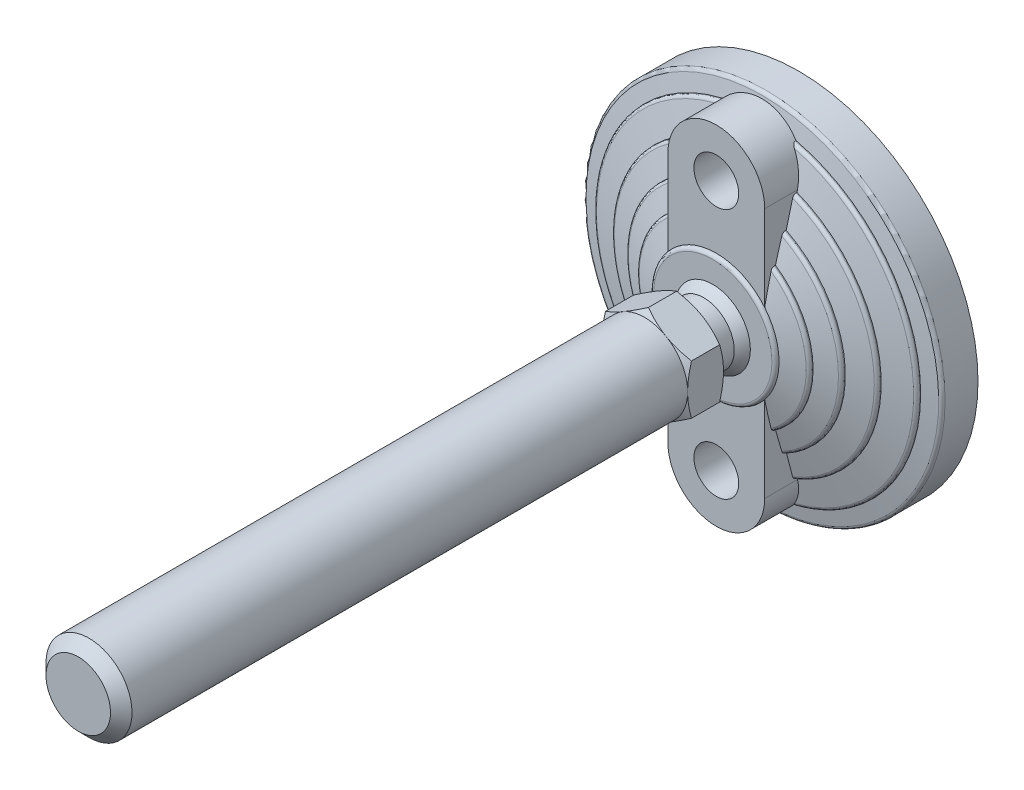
ISO-10303-21;
HEADER;
FILE_DESCRIPTION(('STEP AP214'),'2;1');
FILE_NAME('part.step','',(''),(''),'','','');
FILE_SCHEMA(('AUTOMOTIVE_DESIGN { 1 0 10303 214 1 1 1 1 }'));
ENDSEC;
DATA;
#1=APPLICATION_CONTEXT('core data for automotive mechanical design processes');
#2=APPLICATION_PROTOCOL_DEFINITION('international standard','automotive_design',2000,#1);
#3=PRODUCT_CONTEXT('',#1,'mechanical');
#4=PRODUCT('Part','Part','',(#3));
#5=PRODUCT_RELATED_PRODUCT_CATEGORY('part','',(#4));
#6=PRODUCT_DEFINITION_FORMATION('','',#4);
#7=PRODUCT_DEFINITION_CONTEXT('part definition',#1,'design');
#8=PRODUCT_DEFINITION('design','',#6,#7);
#9=PRODUCT_DEFINITION_SHAPE('','',#8);
#10=(LENGTH_UNIT() NAMED_UNIT(*) SI_UNIT(.MILLI.,.METRE.));
#11=(NAMED_UNIT(*) PLANE_ANGLE_UNIT() SI_UNIT($,.RADIAN.));
#12=(NAMED_UNIT(*) SI_UNIT($,.STERADIAN.) SOLID_ANGLE_UNIT());
#13=UNCERTAINTY_MEASURE_WITH_UNIT(LENGTH_MEASURE(1.E-05),#10,'distance_accuracy_value','');
#14=(GEOMETRIC_REPRESENTATION_CONTEXT(3) GLOBAL_UNCERTAINTY_ASSIGNED_CONTEXT((#13)) GLOBAL_UNIT_ASSIGNED_CONTEXT((#10,
#11,#12)) REPRESENTATION_CONTEXT('',''));
#15=CARTESIAN_POINT('',(0.,0.,0.));
#16=DIRECTION('',(0.,0.,1.));
#17=DIRECTION('',(1.,0.,0.));
#18=AXIS2_PLACEMENT_3D('',#15,#16,#17);
#19=CARTESIAN_POINT('',(-12.,14.022683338,36.));
#20=DIRECTION('',(0.,0.,1.));
#21=DIRECTION('',(0.,-1.,0.));
#22=AXIS2_PLACEMENT_3D('',#19,#20,#21);
#23=PLANE('',#22);
#24=CARTESIAN_POINT('',(0.,0.,36.));
#25=DIRECTION('',(0.,0.,-1.));
#26=DIRECTION('',(0.,1.,0.));
#27=AXIS2_PLACEMENT_3D('',#24,#25,#26);
#28=CIRCLE('',#27,8.5);
#29=CARTESIAN_POINT('',(0.,8.5,36.));
#30=VERTEX_POINT('',#29);
#31=EDGE_CURVE('E940',#30,#30,#28,.T.);
#32=ORIENTED_EDGE('',*,*,#31,.F.);
#33=EDGE_LOOP('',(#32));
#34=FACE_BOUND('',#33,.T.);
#35=CARTESIAN_POINT('',(0.,0.,36.));
#36=DIRECTION('',(0.,0.,1.));
#37=DIRECTION('',(0.,-1.,0.));
#38=AXIS2_PLACEMENT_3D('',#35,#36,#37);
#39=CIRCLE('',#38,12.);
#40=CARTESIAN_POINT('',(6.00000000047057,-10.3923048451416,36.));
#41=VERTEX_POINT('',#40);
#42=CARTESIAN_POINT('',(-6.00000000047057,-10.3923048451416,36.));
#43=VERTEX_POINT('',#42);
#44=EDGE_CURVE('E26',#41,#43,#39,.F.);
#45=ORIENTED_EDGE('',*,*,#44,.T.);
#46=CARTESIAN_POINT('',(-12.,0.,36.));
#47=VERTEX_POINT('',#46);
#48=EDGE_CURVE('E9',#43,#47,#39,.F.);
#49=ORIENTED_EDGE('',*,*,#48,.T.);
#50=CARTESIAN_POINT('',(-6.00000000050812,10.3923048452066,36.));
#51=VERTEX_POINT('',#50);
#52=EDGE_CURVE('E25',#47,#51,#39,.F.);
#53=ORIENTED_EDGE('',*,*,#52,.T.);
#54=CARTESIAN_POINT('',(6.00000000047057,10.3923048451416,36.));
#55=VERTEX_POINT('',#54);
#56=EDGE_CURVE('E287',#51,#55,#39,.F.);
#57=ORIENTED_EDGE('',*,*,#56,.T.);
#58=CARTESIAN_POINT('',(0.,0.,36.));
#59=DIRECTION('',(0.,0.,-1.));
#60=DIRECTION('',(0.,1.,0.));
#61=AXIS2_PLACEMENT_3D('',#58,#59,#60);
#62=CIRCLE('',#61,12.);
#63=CARTESIAN_POINT('',(12.,0.,36.));
#64=VERTEX_POINT('',#63);
#65=EDGE_CURVE('E301',#55,#64,#62,.T.);
#66=ORIENTED_EDGE('',*,*,#65,.T.);
#67=EDGE_CURVE('E311',#64,#41,#39,.F.);
#68=ORIENTED_EDGE('',*,*,#67,.T.);
#69=EDGE_LOOP('',(#45,#49,#53,#57,#66,#68));
#70=FACE_BOUND('',#69,.T.);
#71=ADVANCED_FACE('F14',(#34,#70),#23,.F.);
#72=CARTESIAN_POINT('',(-44.173478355,44.022,0.));
#73=DIRECTION('',(0.,0.,1.));
#74=DIRECTION('',(0.,-1.,0.));
#75=AXIS2_PLACEMENT_3D('',#72,#73,#74);
#76=PLANE('',#75);
#77=CARTESIAN_POINT('',(0.,0.,0.));
#78=DIRECTION('',(0.,0.,-1.));
#79=DIRECTION('',(0.,1.,0.));
#80=AXIS2_PLACEMENT_3D('',#77,#78,#79);
#81=CIRCLE('',#80,43.5);
#82=CARTESIAN_POINT('',(0.,43.5,0.));
#83=VERTEX_POINT('',#82);
#84=EDGE_CURVE('E932',#83,#83,#81,.F.);
#85=ORIENTED_EDGE('',*,*,#84,.F.);
#86=EDGE_LOOP('',(#85));
#87=FACE_BOUND('',#86,.T.);
#88=ADVANCED_FACE('F960',(#87),#76,.F.);
#89=CARTESIAN_POINT('',(0.,0.,36.));
#90=DIRECTION('',(0.,0.,-1.));
#91=DIRECTION('',(0.,1.,0.));
#92=AXIS2_PLACEMENT_3D('',#89,#90,#91);
#93=CYLINDRICAL_SURFACE('',#92,8.5);
#94=ORIENTED_EDGE('',*,*,#31,.T.);
#95=EDGE_LOOP('',(#94));
#96=FACE_BOUND('',#95,.T.);
#97=CARTESIAN_POINT('',(0.,0.,29.5000000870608));
#98=DIRECTION('',(0.,0.,-1.));
#99=DIRECTION('',(-1.,0.,0.));
#100=AXIS2_PLACEMENT_3D('',#97,#98,#99);
#101=CIRCLE('',#100,8.49999990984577);
#102=CARTESIAN_POINT('',(-8.49999990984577,0.,29.5000000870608));
#103=VERTEX_POINT('',#102);
#104=EDGE_CURVE('E928',#103,#103,#101,.T.);
#105=ORIENTED_EDGE('',*,*,#104,.F.);
#106=EDGE_LOOP('',(#105));
#107=FACE_BOUND('',#106,.T.);
#108=ADVANCED_FACE('F964',(#96,#107),#93,.T.);
#109=CARTESIAN_POINT('',(0.,0.,3.));
#110=DIRECTION('',(0.,0.,-1.));
#111=DIRECTION('',(0.,1.,0.));
#112=AXIS2_PLACEMENT_3D('',#109,#110,#111);
#113=CYLINDRICAL_SURFACE('',#112,43.5);
#114=ORIENTED_EDGE('',*,*,#84,.T.);
#115=EDGE_LOOP('',(#114));
#116=FACE_BOUND('',#115,.T.);
#117=CARTESIAN_POINT('',(0.,0.,3.));
#118=DIRECTION('',(0.,0.,-1.));
#119=DIRECTION('',(0.,1.,0.));
#120=AXIS2_PLACEMENT_3D('',#117,#118,#119);
#121=CIRCLE('',#120,43.5);
#122=CARTESIAN_POINT('',(0.,43.5,3.));
#123=VERTEX_POINT('',#122);
#124=EDGE_CURVE('E931',#123,#123,#121,.T.);
#125=ORIENTED_EDGE('',*,*,#124,.T.);
#126=EDGE_LOOP('',(#125));
#127=FACE_BOUND('',#126,.T.);
#128=ADVANCED_FACE('F421',(#116,#127),#113,.T.);
#129=CARTESIAN_POINT('',(-6.346764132,-28.675,3.));
#130=DIRECTION('',(0.,0.,1.));
#131=DIRECTION('',(0.,-1.,0.));
#132=AXIS2_PLACEMENT_3D('',#129,#130,#131);
#133=PLANE('',#132);
#134=CARTESIAN_POINT('',(0.,-35.,3.));
#135=DIRECTION('',(0.,0.,1.));
#136=DIRECTION('',(0.,-1.,0.));
#137=AXIS2_PLACEMENT_3D('',#134,#135,#136);
#138=CIRCLE('',#137,6.25);
#139=CARTESIAN_POINT('',(0.,-41.25,3.));
#140=VERTEX_POINT('',#139);
#141=EDGE_CURVE('E1025',#140,#140,#138,.T.);
#142=ORIENTED_EDGE('',*,*,#141,.T.);
#143=EDGE_LOOP('',(#142));
#144=FACE_BOUND('',#143,.T.);
#145=ADVANCED_FACE('F419',(#144),#133,.T.);
#146=CARTESIAN_POINT('',(0.,0.,20.678860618));
#147=DIRECTION('',(0.,0.,-1.));
#148=DIRECTION('',(1.,0.,0.));
#149=AXIS2_PLACEMENT_3D('',#146,#147,#148);
#150=SPHERICAL_SURFACE('',#149,12.25);
#151=CARTESIAN_POINT('',(0.,0.,27.));
#152=DIRECTION('',(0.,0.,-1.));
#153=DIRECTION('',(0.,1.,0.));
#154=AXIS2_PLACEMENT_3D('',#151,#152,#153);
#155=CIRCLE('',#154,10.4931261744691);
#156=CARTESIAN_POINT('',(0.,10.4931261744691,27.));
#157=VERTEX_POINT('',#156);
#158=EDGE_CURVE('E981',#157,#157,#155,.F.);
#159=ORIENTED_EDGE('',*,*,#158,.T.);
#160=EDGE_LOOP('',(#159));
#161=FACE_BOUND('',#160,.T.);
#162=ORIENTED_EDGE('',*,*,#104,.T.);
#163=EDGE_LOOP('',(#162));
#164=FACE_BOUND('',#163,.T.);
#165=ADVANCED_FACE('F414',(#161,#164),#150,.T.);
#166=CARTESIAN_POINT('',(-50.774113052,50.6,3.));
#167=DIRECTION('',(0.,0.,1.));
#168=DIRECTION('',(0.,-1.,0.));
#169=AXIS2_PLACEMENT_3D('',#166,#167,#168);
#170=PLANE('',#169);
#171=ORIENTED_EDGE('',*,*,#124,.F.);
#172=EDGE_LOOP('',(#171));
#173=FACE_BOUND('',#172,.T.);
#174=CARTESIAN_POINT('',(0.,0.,3.));
#175=DIRECTION('',(0.,0.,-1.));
#176=DIRECTION('',(0.,1.,0.));
#177=AXIS2_PLACEMENT_3D('',#174,#175,#176);
#178=CIRCLE('',#177,50.);
#179=CARTESIAN_POINT('',(0.,50.,3.));
#180=VERTEX_POINT('',#179);
#181=EDGE_CURVE('E460',#180,#180,#178,.F.);
#182=ORIENTED_EDGE('',*,*,#181,.F.);
#183=EDGE_LOOP('',(#182));
#184=FACE_BOUND('',#183,.T.);
#185=ADVANCED_FACE('F418',(#173,#184),#170,.F.);
#186=CARTESIAN_POINT('',(0.,-35.,3.));
#187=DIRECTION('',(0.,0.,1.));
#188=DIRECTION('',(0.,-1.,0.));
#189=AXIS2_PLACEMENT_3D('',#186,#187,#188);
#190=CYLINDRICAL_SURFACE('',#189,6.25);
#191=ORIENTED_EDGE('',*,*,#141,.F.);
#192=EDGE_LOOP('',(#191));
#193=FACE_BOUND('',#192,.T.);
#194=CARTESIAN_POINT('',(0.,-35.,26.));
#195=DIRECTION('',(0.,0.,1.));
#196=DIRECTION('',(0.,-1.,0.));
#197=AXIS2_PLACEMENT_3D('',#194,#195,#196);
#198=CIRCLE('',#197,6.25);
#199=CARTESIAN_POINT('',(0.,-41.25,26.));
#200=VERTEX_POINT('',#199);
#201=EDGE_CURVE('E905',#200,#200,#198,.T.);
#202=ORIENTED_EDGE('',*,*,#201,.T.);
#203=EDGE_LOOP('',(#202));
#204=FACE_BOUND('',#203,.T.);
#205=ADVANCED_FACE('F423',(#193,#204),#190,.F.);
#206=CARTESIAN_POINT('',(-16.755457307,-16.698,27.));
#207=DIRECTION('',(0.,0.,-1.));
#208=DIRECTION('',(0.,1.,0.));
#209=AXIS2_PLACEMENT_3D('',#206,#207,#208);
#210=PLANE('',#209);
#211=ORIENTED_EDGE('',*,*,#158,.F.);
#212=EDGE_LOOP('',(#211));
#213=FACE_BOUND('',#212,.T.);
#214=CARTESIAN_POINT('',(0.,0.,27.));
#215=DIRECTION('',(0.,0.,-1.));
#216=DIRECTION('',(0.,1.,0.));
#217=AXIS2_PLACEMENT_3D('',#214,#215,#216);
#218=CIRCLE('',#217,16.5);
#219=CARTESIAN_POINT('',(0.,16.5,27.));
#220=VERTEX_POINT('',#219);
#221=EDGE_CURVE('E904',#220,#220,#218,.T.);
#222=ORIENTED_EDGE('',*,*,#221,.F.);
#223=EDGE_LOOP('',(#222));
#224=FACE_BOUND('',#223,.T.);
#225=ADVANCED_FACE('F426',(#213,#224),#210,.F.);
#226=CARTESIAN_POINT('',(-6.346764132,41.325,3.));
#227=DIRECTION('',(0.,0.,1.));
#228=DIRECTION('',(0.,-1.,0.));
#229=AXIS2_PLACEMENT_3D('',#226,#227,#228);
#230=PLANE('',#229);
#231=CARTESIAN_POINT('',(0.,35.,3.));
#232=DIRECTION('',(0.,0.,1.));
#233=DIRECTION('',(0.,-1.,0.));
#234=AXIS2_PLACEMENT_3D('',#231,#232,#233);
#235=CIRCLE('',#234,6.25);
#236=CARTESIAN_POINT('',(0.,28.75,3.));
#237=VERTEX_POINT('',#236);
#238=EDGE_CURVE('E987',#237,#237,#235,.T.);
#239=ORIENTED_EDGE('',*,*,#238,.T.);
#240=EDGE_LOOP('',(#239));
#241=FACE_BOUND('',#240,.T.);
#242=ADVANCED_FACE('F433',(#241),#230,.T.);
#243=CARTESIAN_POINT('',(0.,0.,26.));
#244=DIRECTION('',(0.,0.,-1.));
#245=DIRECTION('',(1.,0.,0.));
#246=AXIS2_PLACEMENT_3D('',#243,#244,#245);
#247=CONICAL_SURFACE('',#246,17.5,1.27229739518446);
#248=CARTESIAN_POINT('',(0.,0.,26.));
#249=DIRECTION('',(0.,0.,1.));
#250=DIRECTION('',(0.,-1.,0.));
#251=AXIS2_PLACEMENT_3D('',#248,#249,#250);
#252=CIRCLE('',#251,17.5);
#253=CARTESIAN_POINT('',(13.5000000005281,-11.1355287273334,25.999999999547));
#254=VERTEX_POINT('',#253);
#255=CARTESIAN_POINT('',(13.5000000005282,11.1355287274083,25.9999999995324));
#256=VERTEX_POINT('',#255);
#257=EDGE_CURVE('E901',#254,#256,#252,.T.);
#258=ORIENTED_EDGE('',*,*,#257,.F.);
#259=CARTESIAN_POINT('',(13.5,-18.9832672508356,24.2172043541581));
#260=CARTESIAN_POINT('',(13.5,-18.6579649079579,24.2987714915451));
#261=CARTESIAN_POINT('',(13.5,-18.3324976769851,24.3796813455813));
#262=CARTESIAN_POINT('',(13.5,-17.6811977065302,24.5400241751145));
#263=CARTESIAN_POINT('',(13.5,-17.3553649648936,24.6194571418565));
#264=CARTESIAN_POINT('',(13.5,-16.3773825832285,24.8552688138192));
#265=CARTESIAN_POINT('',(13.5,-15.7246371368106,25.0091884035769));
#266=CARTESIAN_POINT('',(13.5,-14.4172126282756,25.3088363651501));
#267=CARTESIAN_POINT('',(13.5,-13.7625334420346,25.4545641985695));
#268=CARTESIAN_POINT('',(13.5,-12.7787974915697,25.6654071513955));
#269=CARTESIAN_POINT('',(13.5,-12.4505717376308,25.7344021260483));
#270=CARTESIAN_POINT('',(13.5,-11.7935144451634,25.8694734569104));
#271=CARTESIAN_POINT('',(13.5,-11.4646828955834,25.9355497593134));
#272=CARTESIAN_POINT('',(13.5,-11.1355287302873,25.9999999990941));
#273=B_SPLINE_CURVE_WITH_KNOTS('',3,(#259,#260,#261,#262,#263,#264,#265,#266,#267,#268,#269,
#270,#271,#272),.UNSPECIFIED.,.F.,.F.,(4,2,2,2,2,2,4),(0.,1.00611699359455,2.01223994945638,
4.02414047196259,6.03617307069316,7.04235800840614,8.04856148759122),.UNSPECIFIED.);
#274=CARTESIAN_POINT('',(13.5,-18.9832672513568,24.2172043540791));
#275=VERTEX_POINT('',#274);
#276=EDGE_CURVE('E450',#275,#254,#273,.T.);
#277=ORIENTED_EDGE('',*,*,#276,.F.);
#278=CARTESIAN_POINT('',(3.16437848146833E-10,0.,24.217204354));
#279=DIRECTION('',(0.,0.,-1.));
#280=DIRECTION('',(0.,1.,0.));
#281=AXIS2_PLACEMENT_3D('',#278,#279,#280);
#282=CIRCLE('',#281,23.2940858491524);
#283=CARTESIAN_POINT('',(13.5,18.983267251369,24.2172043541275));
#284=VERTEX_POINT('',#283);
#285=EDGE_CURVE('E411',#284,#275,#282,.T.);
#286=ORIENTED_EDGE('',*,*,#285,.F.);
#287=CARTESIAN_POINT('',(13.5,11.1355287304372,25.9999999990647));
#288=CARTESIAN_POINT('',(13.5,11.4646828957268,25.9355497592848));
#289=CARTESIAN_POINT('',(13.5,11.7935144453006,25.8694734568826));
#290=CARTESIAN_POINT('',(13.5,12.4505717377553,25.7344021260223));
#291=CARTESIAN_POINT('',(13.5,12.7787974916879,25.6654071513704));
#292=CARTESIAN_POINT('',(13.5,13.762533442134,25.4545641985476));
#293=CARTESIAN_POINT('',(13.5,14.4172126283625,25.3088363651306));
#294=CARTESIAN_POINT('',(13.5,15.7246371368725,25.0091884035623));
#295=CARTESIAN_POINT('',(13.5,16.377382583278,24.8552688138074));
#296=CARTESIAN_POINT('',(13.5,17.3553649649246,24.619457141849));
#297=CARTESIAN_POINT('',(13.5,17.681197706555,24.5400241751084));
#298=CARTESIAN_POINT('',(13.5,18.3324976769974,24.3796813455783));
#299=CARTESIAN_POINT('',(13.5,18.6579649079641,24.2987714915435));
#300=CARTESIAN_POINT('',(13.5,18.9832672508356,24.2172043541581));
#301=B_SPLINE_CURVE_WITH_KNOTS('',3,(#287,#288,#289,#290,#291,#292,#293,#294,#295,#296,#297,
#298,#299,#300),.UNSPECIFIED.,.F.,.F.,(4,2,2,2,2,2,4),(0.,1.00620347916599,2.01238841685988,
4.02442101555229,6.03632153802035,7.04244449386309,8.04856148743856),.UNSPECIFIED.);
#302=EDGE_CURVE('E441',#256,#284,#301,.T.);
#303=ORIENTED_EDGE('',*,*,#302,.F.);
#304=EDGE_LOOP('',(#258,#277,#286,#303));
#305=FACE_BOUND('',#304,.T.);
#306=ADVANCED_FACE('F428',(#305),#247,.T.);
#307=CARTESIAN_POINT('',(13.267303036,19.999466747,23.261425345));
#308=CARTESIAN_POINT('',(29.097194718,9.49818825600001,23.261425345));
#309=CARTESIAN_POINT('',(29.097194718,-9.49818825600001,23.261425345));
#310=CARTESIAN_POINT('',(13.267303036,-19.999466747,23.261425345));
#311=CARTESIAN_POINT('',(13.267303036,19.999466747,23.716888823));
#312=CARTESIAN_POINT('',(29.097194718,9.49818825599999,23.716888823));
#313=CARTESIAN_POINT('',(29.097194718,-9.49818825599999,23.716888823));
#314=CARTESIAN_POINT('',(13.267303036,-19.999466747,23.716888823));
#315=CARTESIAN_POINT('',(13.117718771,19.773979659,24.083258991));
#316=CARTESIAN_POINT('',(28.769133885,9.39109946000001,24.083258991));
#317=CARTESIAN_POINT('',(28.769133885,-9.39109946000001,24.083258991));
#318=CARTESIAN_POINT('',(13.117718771,-19.773979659,24.083258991));
#319=CARTESIAN_POINT('',(12.877070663,19.411220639,24.217204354));
#320=CARTESIAN_POINT('',(28.241356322,9.218817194,24.217204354));
#321=CARTESIAN_POINT('',(28.241356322,-9.218817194,24.217204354));
#322=CARTESIAN_POINT('',(12.877070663,-19.411220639,24.217204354));
#323=(BOUNDED_SURFACE() B_SPLINE_SURFACE(3,3,((#307,#308,#309,#310),(#311,#312,#313,#314),(#315,
#316,#317,#318),(#319,#320,#321,#322)),.UNSPECIFIED.,.F.,.F.,
.F.) B_SPLINE_SURFACE_WITH_KNOTS((4,4),(4,4),(0.,1.),(0.,1.),
.UNSPECIFIED.) GEOMETRIC_REPRESENTATION_ITEM() RATIONAL_B_SPLINE_SURFACE(((1.,0.701869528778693,
0.701869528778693,1.),(0.86959318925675,0.610340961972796,0.610340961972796,0.86959318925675),
(0.86959318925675,0.610340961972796,0.610340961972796,0.86959318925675),(1.,0.701869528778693,
0.701869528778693,1.))) REPRESENTATION_ITEM('') SURFACE());
#324=CARTESIAN_POINT('',(13.5,-19.8431348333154,23.2614253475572));
#325=CARTESIAN_POINT('',(13.5,-19.8431370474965,23.2860556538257));
#326=CARTESIAN_POINT('',(13.5,-19.8420333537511,23.3106726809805));
#327=CARTESIAN_POINT('',(13.5,-19.8376465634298,23.3597018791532));
#328=CARTESIAN_POINT('',(13.5,-19.8343643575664,23.3841141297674));
#329=CARTESIAN_POINT('',(13.5,-19.8213486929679,23.4565201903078));
#330=CARTESIAN_POINT('',(13.5,-19.8084453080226,23.5039784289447));
#331=CARTESIAN_POINT('',(13.5,-19.7748969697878,23.5959548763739));
#332=CARTESIAN_POINT('',(13.5,-19.7542611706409,23.6404764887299));
#333=CARTESIAN_POINT('',(13.5,-19.7062220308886,23.7257350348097));
#334=CARTESIAN_POINT('',(13.5,-19.6788120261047,23.7664681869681));
#335=CARTESIAN_POINT('',(13.5,-19.6164784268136,23.8458096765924));
#336=CARTESIAN_POINT('',(13.5,-19.5811980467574,23.8841360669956));
#337=CARTESIAN_POINT('',(13.5,-19.5055204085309,23.9553392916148));
#338=CARTESIAN_POINT('',(13.5,-19.465120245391,23.9882130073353));
#339=CARTESIAN_POINT('',(13.5,-19.3733614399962,24.0532792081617));
#340=CARTESIAN_POINT('',(13.5,-19.321293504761,24.0844693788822));
#341=CARTESIAN_POINT('',(13.5,-19.2133323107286,24.139175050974));
#342=CARTESIAN_POINT('',(13.5,-19.1574401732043,24.1626927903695));
#343=CARTESIAN_POINT('',(13.5,-19.0617819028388,24.1957297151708));
#344=CARTESIAN_POINT('',(13.5,-19.022719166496,24.207311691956));
#345=CARTESIAN_POINT('',(13.5,-18.9832672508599,24.2172043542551));
#346=B_SPLINE_CURVE_WITH_KNOTS('',3,(#324,#325,#326,#327,#328,#329,#330,#331,#332,#333,#334,
#335,#336,#337,#338,#339,#340,#341,#342,#343,#344,#345),.UNSPECIFIED.,.F.,.F.,(4,2,2,2,2,2,2,2,
2,2,4),(0.,0.073840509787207,0.147650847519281,0.29439860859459,0.440973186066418,
0.587692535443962,0.743377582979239,0.899151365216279,1.08055916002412,1.26191399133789,
1.38396481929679),.UNSPECIFIED.);
#347=CARTESIAN_POINT('',(13.5,-19.8431348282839,23.2614253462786));
#348=VERTEX_POINT('',#347);
#349=EDGE_CURVE('E493',#348,#275,#346,.T.);
#350=CARTESIAN_POINT('',(0.,0.,23.261425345));
#351=DIRECTION('',(0.,0.,-1.));
#352=DIRECTION('',(0.,1.,0.));
#353=AXIS2_PLACEMENT_3D('',#350,#351,#352);
#354=CIRCLE('',#353,24.);
#355=CARTESIAN_POINT('',(13.5,19.8431348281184,23.2614253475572));
#356=VERTEX_POINT('',#355);
#357=EDGE_CURVE('E926',#356,#348,#354,.T.);
#358=CARTESIAN_POINT('',(13.5,18.9832672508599,24.2172043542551));
#359=CARTESIAN_POINT('',(13.5,19.0245269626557,24.2068474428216));
#360=CARTESIAN_POINT('',(13.5,19.0653049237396,24.1946763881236));
#361=CARTESIAN_POINT('',(13.5,19.1456358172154,24.1665827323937));
#362=CARTESIAN_POINT('',(13.5,19.1851861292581,24.1506526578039));
#363=CARTESIAN_POINT('',(13.5,19.3016874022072,24.0969581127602));
#364=CARTESIAN_POINT('',(13.5,19.3761277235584,24.0533765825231));
#365=CARTESIAN_POINT('',(13.5,19.4913457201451,23.9675664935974));
#366=CARTESIAN_POINT('',(13.5,19.5352290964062,23.9294496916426));
#367=CARTESIAN_POINT('',(13.5,19.6161219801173,23.8466003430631));
#368=CARTESIAN_POINT('',(13.5,19.6531483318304,23.8018845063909));
#369=CARTESIAN_POINT('',(13.5,19.7189344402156,23.7060840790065));
#370=CARTESIAN_POINT('',(13.5,19.747615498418,23.6549449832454));
#371=CARTESIAN_POINT('',(13.5,19.7944064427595,23.5480322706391));
#372=CARTESIAN_POINT('',(13.5,19.8125331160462,23.4922661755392));
#373=CARTESIAN_POINT('',(13.5,19.8308153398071,23.4067306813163));
#374=CARTESIAN_POINT('',(13.5,19.8354249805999,23.3778585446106));
#375=CARTESIAN_POINT('',(13.5,19.8415861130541,23.3198066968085));
#376=CARTESIAN_POINT('',(13.5,19.8431393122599,23.2906271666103));
#377=CARTESIAN_POINT('',(13.5,19.8431348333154,23.2614253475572));
#378=B_SPLINE_CURVE_WITH_KNOTS('',3,(#358,#359,#360,#361,#362,#363,#364,#365,#366,#367,#368,
#369,#370,#371,#372,#373,#374,#375,#376,#377),.UNSPECIFIED.,.F.,.F.,(4,2,2,2,2,2,2,2,2,4),(0.,
0.127516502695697,0.255288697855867,0.511930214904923,0.685657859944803,0.858952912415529,
1.0338328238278,1.20843381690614,1.29600438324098,1.38352601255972),.UNSPECIFIED.);
#379=EDGE_CURVE('E567',#284,#356,#378,.T.);
#380=ORIENTED_EDGE('',*,*,#285,.T.);
#381=ORIENTED_EDGE('',*,*,#349,.F.);
#382=ORIENTED_EDGE('',*,*,#357,.F.);
#383=ORIENTED_EDGE('',*,*,#379,.F.);
#384=EDGE_LOOP('',(#380,#381,#382,#383));
#385=FACE_BOUND('',#384,.T.);
#386=ADVANCED_FACE('F432',(#385),#323,.T.);
#387=CARTESIAN_POINT('',(0.,0.,23.261425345));
#388=DIRECTION('',(0.,0.,-1.));
#389=DIRECTION('',(0.,1.,0.));
#390=AXIS2_PLACEMENT_3D('',#387,#388,#389);
#391=CYLINDRICAL_SURFACE('',#390,24.);
#392=CARTESIAN_POINT('',(0.,0.,23.));
#393=DIRECTION('',(0.,0.,-1.));
#394=DIRECTION('',(0.,1.,0.));
#395=AXIS2_PLACEMENT_3D('',#392,#393,#394);
#396=CIRCLE('',#395,24.);
#397=CARTESIAN_POINT('',(13.5,19.8431348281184,23.));
#398=VERTEX_POINT('',#397);
#399=CARTESIAN_POINT('',(13.5,-19.8431348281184,23.000000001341));
#400=VERTEX_POINT('',#399);
#401=EDGE_CURVE('E924',#398,#400,#396,.T.);
#402=ORIENTED_EDGE('',*,*,#401,.F.);
#403=DIRECTION('',(0.,0.,-1.));
#404=VECTOR('',#403,1.);
#405=CARTESIAN_POINT('',(13.5,19.8431348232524,21.4084486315));
#406=LINE('',#405,#404);
#407=EDGE_CURVE('E588',#356,#398,#406,.T.);
#408=ORIENTED_EDGE('',*,*,#407,.F.);
#409=ORIENTED_EDGE('',*,*,#357,.T.);
#410=DIRECTION('',(0.,0.,1.));
#411=VECTOR('',#410,1.);
#412=CARTESIAN_POINT('',(13.5,-19.8431348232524,21.4084486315));
#413=LINE('',#412,#411);
#414=EDGE_CURVE('E995',#400,#348,#413,.T.);
#415=ORIENTED_EDGE('',*,*,#414,.F.);
#416=EDGE_LOOP('',(#402,#408,#409,#415));
#417=FACE_BOUND('',#416,.T.);
#418=ADVANCED_FACE('F593',(#417),#391,.T.);
#419=CARTESIAN_POINT('',(0.,0.,23.));
#420=DIRECTION('',(0.,0.,-1.));
#421=DIRECTION('',(0.,1.,0.));
#422=AXIS2_PLACEMENT_3D('',#419,#420,#421);
#423=CONICAL_SURFACE('',#422,24.,1.24904577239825);
#424=ORIENTED_EDGE('',*,*,#401,.T.);
#425=CARTESIAN_POINT('',(13.5,-26.022897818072,21.2279240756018));
#426=CARTESIAN_POINT('',(13.5,-25.5091656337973,21.3799212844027));
#427=CARTESIAN_POINT('',(13.5,-24.9951778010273,21.5310587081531));
#428=CARTESIAN_POINT('',(13.5,-23.9666187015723,21.8312926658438));
#429=CARTESIAN_POINT('',(13.5,-23.4520474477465,21.9803892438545));
#430=CARTESIAN_POINT('',(13.5,-22.4222240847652,22.2762276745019));
#431=CARTESIAN_POINT('',(13.5,-21.9069719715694,22.422969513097));
#432=CARTESIAN_POINT('',(13.5,-20.8756730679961,22.713675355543));
#433=CARTESIAN_POINT('',(13.5,-20.3596262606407,22.8576392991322));
#434=CARTESIAN_POINT('',(13.5,-19.8431348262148,23.0000000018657));
#435=B_SPLINE_CURVE_WITH_KNOTS('',3,(#425,#426,#427,#428,#429,#430,#431,#432,#433,#434),
.UNSPECIFIED.,.F.,.F.,(4,2,2,2,4),(0.,1.60723934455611,3.21444392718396,4.82165809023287,
6.42890708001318),.UNSPECIFIED.);
#436=CARTESIAN_POINT('',(13.5,-26.0228978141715,21.2279240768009));
#437=VERTEX_POINT('',#436);
#438=EDGE_CURVE('E501',#437,#400,#435,.T.);
#439=ORIENTED_EDGE('',*,*,#438,.F.);
#440=CARTESIAN_POINT('',(-5.51340223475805E-10,0.,21.227924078));
#441=DIRECTION('',(0.,0.,-1.));
#442=DIRECTION('',(0.,1.,0.));
#443=AXIS2_PLACEMENT_3D('',#440,#441,#442);
#444=CIRCLE('',#443,29.3162277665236);
#445=CARTESIAN_POINT('',(13.5,26.0228978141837,21.2279240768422));
#446=VERTEX_POINT('',#445);
#447=EDGE_CURVE('E923',#446,#437,#444,.T.);
#448=ORIENTED_EDGE('',*,*,#447,.F.);
#449=CARTESIAN_POINT('',(13.5000000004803,19.8431348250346,23.0000000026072));
#450=CARTESIAN_POINT('',(13.5000000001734,20.3596262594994,22.8576392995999));
#451=CARTESIAN_POINT('',(13.5000000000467,20.8756730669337,22.7136753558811));
#452=CARTESIAN_POINT('',(13.4999999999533,21.9069719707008,22.4229695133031));
#453=CARTESIAN_POINT('',(13.4999999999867,22.4222240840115,22.2762276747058));
#454=CARTESIAN_POINT('',(13.5000000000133,23.4520474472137,21.9803892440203));
#455=CARTESIAN_POINT('',(13.5000000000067,23.9666187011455,21.8312926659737));
#456=CARTESIAN_POINT('',(13.4999999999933,24.995177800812,21.5310587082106));
#457=CARTESIAN_POINT('',(13.4999999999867,25.5091656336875,21.3799212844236));
#458=CARTESIAN_POINT('',(13.5,26.022897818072,21.2279240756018));
#459=B_SPLINE_CURVE_WITH_KNOTS('',3,(#449,#450,#451,#452,#453,#454,#455,#456,#457,#458),
.UNSPECIFIED.,.F.,.F.,(4,2,2,2,4),(0.,1.60724899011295,3.2144631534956,4.82166773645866,
6.42890708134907),.UNSPECIFIED.);
#460=EDGE_CURVE('E582',#398,#446,#459,.T.);
#461=ORIENTED_EDGE('',*,*,#460,.F.);
#462=EDGE_LOOP('',(#424,#439,#448,#461));
#463=FACE_BOUND('',#462,.T.);
#464=ADVANCED_FACE('F589',(#463),#423,.T.);
#465=CARTESIAN_POINT('',(13.143890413,26.967353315,20.27924078));
#466=CARTESIAN_POINT('',(38.983891,14.372934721,20.27924078));
#467=CARTESIAN_POINT('',(38.983891,-14.372934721,20.27924078));
#468=CARTESIAN_POINT('',(13.143890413,-26.967353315,20.27924078));
#469=CARTESIAN_POINT('',(13.143890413,26.967353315,20.725161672));
#470=CARTESIAN_POINT('',(38.983891,14.372934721,20.725161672));
#471=CARTESIAN_POINT('',(38.983891,-14.372934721,20.725161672));
#472=CARTESIAN_POINT('',(13.143890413,-26.967353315,20.725161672));
#473=CARTESIAN_POINT('',(13.029654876,26.732975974,21.086911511));
#474=CARTESIAN_POINT('',(38.645076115,14.248017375,21.086911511));
#475=CARTESIAN_POINT('',(38.645076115,-14.248017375,21.086911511));
#476=CARTESIAN_POINT('',(13.029654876,-26.732975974,21.086911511));
#477=CARTESIAN_POINT('',(12.844309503,26.352702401,21.227924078));
#478=CARTESIAN_POINT('',(38.095354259,14.045340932,21.227924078));
#479=CARTESIAN_POINT('',(38.095354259,-14.045340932,21.227924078));
#480=CARTESIAN_POINT('',(12.844309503,-26.352702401,21.227924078));
#481=(BOUNDED_SURFACE() B_SPLINE_SURFACE(3,3,((#465,#466,#467,#468),(#469,#470,#471,#472),(#473,
#474,#475,#476),(#477,#478,#479,#480)),.UNSPECIFIED.,.F.,.F.,
.F.) B_SPLINE_SURFACE_WITH_KNOTS((4,4),(4,4),(0.,1.),(0.,1.),
.UNSPECIFIED.) GEOMETRIC_REPRESENTATION_ITEM() RATIONAL_B_SPLINE_SURFACE(((1.,0.625419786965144,
0.625419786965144,1.),(0.874161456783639,0.546717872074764,0.546717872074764,0.874161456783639),
(0.874161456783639,0.546717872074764,0.546717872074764,0.874161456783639),(1.,0.625419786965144,
0.625419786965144,1.))) REPRESENTATION_ITEM('') SURFACE());
#482=CARTESIAN_POINT('',(13.5,-26.7908566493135,20.2792407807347));
#483=CARTESIAN_POINT('',(13.5,-26.7908579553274,20.3051907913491));
#484=CARTESIAN_POINT('',(13.5,-26.7897247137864,20.3311275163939));
#485=CARTESIAN_POINT('',(13.5,-26.7852140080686,20.3827974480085));
#486=CARTESIAN_POINT('',(13.5,-26.781837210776,20.4085307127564));
#487=CARTESIAN_POINT('',(13.5,-26.7684139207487,20.4849772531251));
#488=CARTESIAN_POINT('',(13.5,-26.7550740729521,20.5351491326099));
#489=CARTESIAN_POINT('',(13.5,-26.7202107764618,20.632486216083));
#490=CARTESIAN_POINT('',(13.5,-26.6986916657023,20.6796529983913));
#491=CARTESIAN_POINT('',(13.5,-26.648348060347,20.7699105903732));
#492=CARTESIAN_POINT('',(13.5,-26.6195218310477,20.8130004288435));
#493=CARTESIAN_POINT('',(13.5,-26.5542840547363,20.8959059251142));
#494=CARTESIAN_POINT('',(13.5,-26.5176080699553,20.9355124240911));
#495=CARTESIAN_POINT('',(13.5,-26.4386436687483,21.0087234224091));
#496=CARTESIAN_POINT('',(13.5,-26.3963509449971,21.0423232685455));
#497=CARTESIAN_POINT('',(13.5,-26.3267001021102,21.0898793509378));
#498=CARTESIAN_POINT('',(13.5,-26.3008113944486,21.106038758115));
#499=CARTESIAN_POINT('',(13.5,-26.2478537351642,21.1362297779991));
#500=CARTESIAN_POINT('',(13.5,-26.2207861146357,21.1502637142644));
#501=CARTESIAN_POINT('',(13.5,-26.1657188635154,21.176151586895));
#502=CARTESIAN_POINT('',(13.5,-26.1377218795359,21.1880111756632));
#503=CARTESIAN_POINT('',(13.5,-26.0808891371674,21.2095853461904));
#504=CARTESIAN_POINT('',(13.5,-26.0520527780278,21.2192983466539));
#505=CARTESIAN_POINT('',(13.5,-26.0228978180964,21.2279240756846));
#506=B_SPLINE_CURVE_WITH_KNOTS('',3,(#482,#483,#484,#485,#486,#487,#488,#489,#490,#491,#492,
#493,#494,#495,#496,#497,#498,#499,#500,#501,#502,#503,#504,#505),.UNSPECIFIED.,.F.,.F.,(4,2,2,
2,2,2,2,2,2,2,2,4),(0.,0.0777993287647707,0.155575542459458,0.310500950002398,0.465344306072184,
0.620224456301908,0.781511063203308,0.94292207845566,1.03439248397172,1.12576216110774,
1.21689083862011,1.30808642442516),.UNSPECIFIED.);
#507=CARTESIAN_POINT('',(13.5,-26.7908566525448,20.27924078));
#508=VERTEX_POINT('',#507);
#509=EDGE_CURVE('E509',#508,#437,#506,.T.);
#510=CARTESIAN_POINT('',(0.,0.,20.27924078));
#511=DIRECTION('',(0.,0.,-1.));
#512=DIRECTION('',(0.,1.,0.));
#513=AXIS2_PLACEMENT_3D('',#510,#511,#512);
#514=CIRCLE('',#513,30.);
#515=CARTESIAN_POINT('',(13.5,26.7908566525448,20.2792407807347));
#516=VERTEX_POINT('',#515);
#517=EDGE_CURVE('E921',#516,#508,#514,.T.);
#518=CARTESIAN_POINT('',(13.5,26.0228978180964,21.2279240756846));
#519=CARTESIAN_POINT('',(13.5,26.0845570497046,21.2097134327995));
#520=CARTESIAN_POINT('',(13.5,26.1448460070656,21.1865640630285));
#521=CARTESIAN_POINT('',(13.5,26.2611194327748,21.1305926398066));
#522=CARTESIAN_POINT('',(13.5,26.3170802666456,21.0977216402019));
#523=CARTESIAN_POINT('',(13.5,26.422621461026,21.022592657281));
#524=CARTESIAN_POINT('',(13.5,26.4721821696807,20.9803067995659));
#525=CARTESIAN_POINT('',(13.5,26.5625156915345,20.887307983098));
#526=CARTESIAN_POINT('',(13.5,26.6033065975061,20.8366127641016));
#527=CARTESIAN_POINT('',(13.5,26.6708532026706,20.7331354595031));
#528=CARTESIAN_POINT('',(13.5,26.6985518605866,20.6809691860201));
#529=CARTESIAN_POINT('',(13.5,26.743619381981,20.5723560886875));
#530=CARTESIAN_POINT('',(13.5,26.7610021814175,20.5159151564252));
#531=CARTESIAN_POINT('',(13.5,26.7787549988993,20.4289072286));
#532=CARTESIAN_POINT('',(13.5,26.78328761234,20.399138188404));
#533=CARTESIAN_POINT('',(13.5,26.78933789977,20.3393328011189));
#534=CARTESIAN_POINT('',(13.5,26.7908592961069,20.3092968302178));
#535=CARTESIAN_POINT('',(13.5,26.7908566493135,20.2792407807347));
#536=B_SPLINE_CURVE_WITH_KNOTS('',3,(#518,#519,#520,#521,#522,#523,#524,#525,#526,#527,#528,
#529,#530,#531,#532,#533,#534,#535),.UNSPECIFIED.,.F.,.F.,(4,2,2,2,2,2,2,2,4),(0.,
0.192810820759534,0.386609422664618,0.580989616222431,0.774964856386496,0.95118401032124,
1.12716456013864,1.21736691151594,1.30745768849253),.UNSPECIFIED.);
#537=EDGE_CURVE('E549',#446,#516,#536,.T.);
#538=ORIENTED_EDGE('',*,*,#447,.T.);
#539=ORIENTED_EDGE('',*,*,#509,.F.);
#540=ORIENTED_EDGE('',*,*,#517,.F.);
#541=ORIENTED_EDGE('',*,*,#537,.F.);
#542=EDGE_LOOP('',(#538,#539,#540,#541));
#543=FACE_BOUND('',#542,.T.);
#544=ADVANCED_FACE('F592',(#543),#481,.T.);
#545=CARTESIAN_POINT('',(0.,0.,20.27924078));
#546=DIRECTION('',(0.,0.,-1.));
#547=DIRECTION('',(0.,1.,0.));
#548=AXIS2_PLACEMENT_3D('',#545,#546,#547);
#549=CYLINDRICAL_SURFACE('',#548,30.);
#550=CARTESIAN_POINT('',(0.,0.,20.));
#551=DIRECTION('',(0.,0.,-1.));
#552=DIRECTION('',(0.,1.,0.));
#553=AXIS2_PLACEMENT_3D('',#550,#551,#552);
#554=CIRCLE('',#553,30.);
#555=CARTESIAN_POINT('',(13.5,26.7908566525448,20.));
#556=VERTEX_POINT('',#555);
#557=CARTESIAN_POINT('',(13.5,-26.7908566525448,19.9999999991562));
#558=VERTEX_POINT('',#557);
#559=EDGE_CURVE('E919',#556,#558,#554,.T.);
#560=ORIENTED_EDGE('',*,*,#559,.F.);
#561=DIRECTION('',(0.,0.,-1.));
#562=VECTOR('',#561,1.);
#563=CARTESIAN_POINT('',(13.5,26.7908566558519,21.4084486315));
#564=LINE('',#563,#562);
#565=EDGE_CURVE('E544',#516,#556,#564,.T.);
#566=ORIENTED_EDGE('',*,*,#565,.F.);
#567=ORIENTED_EDGE('',*,*,#517,.T.);
#568=DIRECTION('',(0.,0.,1.));
#569=VECTOR('',#568,1.);
#570=CARTESIAN_POINT('',(13.5,-26.7908566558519,21.4084486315));
#571=LINE('',#570,#569);
#572=EDGE_CURVE('E522',#558,#508,#571,.T.);
#573=ORIENTED_EDGE('',*,*,#572,.F.);
#574=EDGE_LOOP('',(#560,#566,#567,#573));
#575=FACE_BOUND('',#574,.T.);
#576=ADVANCED_FACE('F528',(#575),#549,.T.);
#577=CARTESIAN_POINT('',(0.,0.,20.));
#578=DIRECTION('',(0.,0.,-1.));
#579=DIRECTION('',(1.,0.,0.));
#580=AXIS2_PLACEMENT_3D('',#577,#578,#579);
#581=CONICAL_SURFACE('',#580,30.,1.29249666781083);
#582=ORIENTED_EDGE('',*,*,#559,.T.);
#583=CARTESIAN_POINT('',(13.5000000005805,-33.6690568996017,18.2072225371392));
#584=CARTESIAN_POINT('',(13.5000000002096,-33.0965095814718,18.3590521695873));
#585=CARTESIAN_POINT('',(13.5000000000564,-32.5238313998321,18.5103895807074));
#586=CARTESIAN_POINT('',(13.4999999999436,-31.3781752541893,18.8119124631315));
#587=CARTESIAN_POINT('',(13.4999999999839,-30.8051972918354,18.9620979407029));
#588=CARTESIAN_POINT('',(13.5000000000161,-29.6588964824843,19.2611513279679));
#589=CARTESIAN_POINT('',(13.5000000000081,-29.0855736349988,19.4100192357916));
#590=CARTESIAN_POINT('',(13.4999999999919,-27.9385277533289,19.7062178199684));
#591=CARTESIAN_POINT('',(13.4999999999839,-27.3648047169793,19.8535484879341));
#592=CARTESIAN_POINT('',(13.5,-26.7908566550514,19.9999999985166));
#593=B_SPLINE_CURVE_WITH_KNOTS('',3,(#583,#584,#585,#586,#587,#588,#589,#590,#591,#592),
.UNSPECIFIED.,.F.,.F.,(4,2,2,2,4),(0.,1.7770100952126,3.55401051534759,5.33101345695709,
7.10802608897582),.UNSPECIFIED.);
#594=CARTESIAN_POINT('',(13.5,-33.6690569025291,18.2072225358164));
#595=VERTEX_POINT('',#594);
#596=EDGE_CURVE('E515',#595,#558,#593,.T.);
#597=ORIENTED_EDGE('',*,*,#596,.F.);
#598=CARTESIAN_POINT('',(3.08438170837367E-10,0.,18.207222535));
#599=DIRECTION('',(0.,0.,-1.));
#600=DIRECTION('',(0.,1.,0.));
#601=AXIS2_PLACEMENT_3D('',#598,#599,#600);
#602=CIRCLE('',#601,36.2747211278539);
#603=CARTESIAN_POINT('',(13.5,33.6690569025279,18.2072225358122));
#604=VERTEX_POINT('',#603);
#605=EDGE_CURVE('E918',#604,#595,#602,.T.);
#606=ORIENTED_EDGE('',*,*,#605,.F.);
#607=CARTESIAN_POINT('',(13.5000000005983,26.790856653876,19.9999999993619));
#608=CARTESIAN_POINT('',(13.5000000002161,27.3648047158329,19.85354848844));
#609=CARTESIAN_POINT('',(13.5000000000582,27.9385277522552,19.7062178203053));
#610=CARTESIAN_POINT('',(13.4999999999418,29.0855736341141,19.4100192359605));
#611=CARTESIAN_POINT('',(13.4999999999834,29.6588964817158,19.2611513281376));
#612=CARTESIAN_POINT('',(13.5000000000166,30.8051972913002,18.9620979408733));
#613=CARTESIAN_POINT('',(13.5000000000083,31.378175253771,18.8119124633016));
#614=CARTESIAN_POINT('',(13.4999999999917,32.523831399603,18.5103895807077));
#615=CARTESIAN_POINT('',(13.4999999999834,33.0965095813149,18.359052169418));
#616=CARTESIAN_POINT('',(13.5,33.6690568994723,18.2072225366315));
#617=B_SPLINE_CURVE_WITH_KNOTS('',3,(#607,#608,#609,#610,#611,#612,#613,#614,#615,#616),
.UNSPECIFIED.,.F.,.F.,(4,2,2,2,4),(0.,1.77701263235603,3.55401557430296,5.3310159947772,
7.10802609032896),.UNSPECIFIED.);
#618=EDGE_CURVE('E536',#556,#604,#617,.T.);
#619=ORIENTED_EDGE('',*,*,#618,.F.);
#620=EDGE_LOOP('',(#582,#597,#606,#619));
#621=FACE_BOUND('',#620,.T.);
#622=ADVANCED_FACE('F523',(#621),#581,.T.);
#623=CARTESIAN_POINT('',(13.003667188,34.639639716,17.245698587));
#624=CARTESIAN_POINT('',(51.0914438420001,20.341547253,17.245698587));
#625=CARTESIAN_POINT('',(51.0914438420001,-20.341547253,17.245698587));
#626=CARTESIAN_POINT('',(13.003667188,-34.639639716,17.245698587));
#627=CARTESIAN_POINT('',(13.003667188,34.639639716,17.709515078));
#628=CARTESIAN_POINT('',(51.091443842,20.341547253,17.709515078));
#629=CARTESIAN_POINT('',(51.091443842,-20.341547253,17.709515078));
#630=CARTESIAN_POINT('',(13.003667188,-34.639639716,17.709515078));
#631=CARTESIAN_POINT('',(12.905504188,34.378149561,18.079802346));
#632=CARTESIAN_POINT('',(50.7057611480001,20.187991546,18.079802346));
#633=CARTESIAN_POINT('',(50.7057611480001,-20.187991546,18.079802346));
#634=CARTESIAN_POINT('',(12.905504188,-34.378149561,18.079802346));
#635=CARTESIAN_POINT('',(12.748767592,33.960628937,18.207222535));
#636=CARTESIAN_POINT('',(50.089942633,19.942809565,18.207222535));
#637=CARTESIAN_POINT('',(50.089942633,-19.942809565,18.207222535));
#638=CARTESIAN_POINT('',(12.748767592,-33.960628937,18.207222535));
#639=(BOUNDED_SURFACE() B_SPLINE_SURFACE(3,3,((#623,#624,#625,#626),(#627,#628,#629,#630),(#631,
#632,#633,#634),(#635,#636,#637,#638)),.UNSPECIFIED.,.F.,.F.,
.F.) B_SPLINE_SURFACE_WITH_KNOTS((4,4),(4,4),(0.,1.),(0.,1.),
.UNSPECIFIED.) GEOMETRIC_REPRESENTATION_ITEM() RATIONAL_B_SPLINE_SURFACE(((1.,0.567633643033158,
0.567633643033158,1.),(0.865565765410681,0.491324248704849,0.491324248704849,0.865565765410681),
(0.865565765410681,0.491324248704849,0.491324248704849,0.865565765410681),(1.,0.567633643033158,
0.567633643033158,1.))) REPRESENTATION_ITEM('') SURFACE());
#640=CARTESIAN_POINT('',(13.5,-34.4492380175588,17.2456985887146));
#641=CARTESIAN_POINT('',(13.5,-34.4492388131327,17.2724185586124));
#642=CARTESIAN_POINT('',(13.5,-34.4480869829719,17.2991252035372));
#643=CARTESIAN_POINT('',(13.5,-34.4434985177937,17.3523366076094));
#644=CARTESIAN_POINT('',(13.5,-34.4400623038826,17.3788414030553));
#645=CARTESIAN_POINT('',(13.5,-34.42638545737,17.457641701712));
#646=CARTESIAN_POINT('',(13.5,-34.4127763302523,17.5093910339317));
#647=CARTESIAN_POINT('',(13.5,-34.3771048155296,17.6098360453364));
#648=CARTESIAN_POINT('',(13.5,-34.3550440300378,17.6585323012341));
#649=CARTESIAN_POINT('',(13.5,-34.3032810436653,17.7516688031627));
#650=CARTESIAN_POINT('',(13.5,-34.2735788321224,17.7961090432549));
#651=CARTESIAN_POINT('',(13.5,-34.2066078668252,17.8808807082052));
#652=CARTESIAN_POINT('',(13.5,-34.1691521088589,17.9210639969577));
#653=CARTESIAN_POINT('',(13.5,-34.0883643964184,17.9950807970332));
#654=CARTESIAN_POINT('',(13.5,-34.045025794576,18.0289070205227));
#655=CARTESIAN_POINT('',(13.5,-33.9488589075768,18.0927883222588));
#656=CARTESIAN_POINT('',(13.5,-33.8955116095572,18.1220613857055));
#657=CARTESIAN_POINT('',(13.5,-33.7848588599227,18.1715344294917));
#658=CARTESIAN_POINT('',(13.5,-33.727559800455,18.1917486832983));
#659=CARTESIAN_POINT('',(13.5,-33.6690568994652,18.2072225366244));
#660=B_SPLINE_CURVE_WITH_KNOTS('',3,(#640,#641,#642,#643,#644,#645,#646,#647,#648,#649,#650,
#651,#652,#653,#654,#655,#656,#657,#658,#659),.UNSPECIFIED.,.F.,.F.,(4,2,2,2,2,2,2,2,2,4),(0.,
0.0801088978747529,0.160203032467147,0.319894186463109,0.479555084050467,0.639216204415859,
0.803305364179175,0.967581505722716,1.14930395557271,1.33073905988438),.UNSPECIFIED.);
#661=CARTESIAN_POINT('',(13.5,-34.4492380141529,17.2456985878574));
#662=VERTEX_POINT('',#661);
#663=EDGE_CURVE('E461',#662,#595,#660,.T.);
#664=CARTESIAN_POINT('',(0.,0.,17.245698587));
#665=DIRECTION('',(0.,0.,-1.));
#666=DIRECTION('',(0.,1.,0.));
#667=AXIS2_PLACEMENT_3D('',#664,#665,#666);
#668=CIRCLE('',#667,37.);
#669=CARTESIAN_POINT('',(13.5,34.4492380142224,17.2456985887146));
#670=VERTEX_POINT('',#669);
#671=EDGE_CURVE('E916',#670,#662,#668,.T.);
#672=CARTESIAN_POINT('',(13.5,33.6690568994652,18.2072225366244));
#673=CARTESIAN_POINT('',(13.5,33.7285004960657,18.1914984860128));
#674=CARTESIAN_POINT('',(13.5,33.7866931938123,18.1708859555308));
#675=CARTESIAN_POINT('',(13.5,33.8990439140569,18.1203027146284));
#676=CARTESIAN_POINT('',(13.5,33.9531903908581,18.09030640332));
#677=CARTESIAN_POINT('',(13.5,34.0556677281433,18.0214004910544));
#678=CARTESIAN_POINT('',(13.5,34.1039872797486,17.9824739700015));
#679=CARTESIAN_POINT('',(13.5,34.192879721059,17.8966704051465));
#680=CARTESIAN_POINT('',(13.5,34.2334627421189,17.8498039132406));
#681=CARTESIAN_POINT('',(13.5,34.3033335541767,17.7520897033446));
#682=CARTESIAN_POINT('',(13.5,34.3331130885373,17.7015938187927));
#683=CARTESIAN_POINT('',(13.5,34.3830581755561,17.5960457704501));
#684=CARTESIAN_POINT('',(13.5,34.4032299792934,17.5409965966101));
#685=CARTESIAN_POINT('',(13.5,34.4284319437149,17.4456451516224));
#686=CARTESIAN_POINT('',(13.5,34.4362159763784,17.4060504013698));
#687=CARTESIAN_POINT('',(13.5,34.4466250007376,17.32621177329));
#688=CARTESIAN_POINT('',(13.5,34.4492528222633,17.2859682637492));
#689=CARTESIAN_POINT('',(13.5,34.4492380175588,17.2456985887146));
#690=B_SPLINE_CURVE_WITH_KNOTS('',3,(#672,#673,#674,#675,#676,#677,#678,#679,#680,#681,#682,
#683,#684,#685,#686,#687,#688,#689),.UNSPECIFIED.,.F.,.F.,(4,2,2,2,2,2,2,2,4),(0.,
0.184329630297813,0.369166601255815,0.554356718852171,0.739302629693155,0.914257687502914,
1.08909875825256,1.2098399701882,1.33051489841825),.UNSPECIFIED.);
#691=EDGE_CURVE('E543',#604,#670,#690,.T.);
#692=ORIENTED_EDGE('',*,*,#605,.T.);
#693=ORIENTED_EDGE('',*,*,#663,.F.);
#694=ORIENTED_EDGE('',*,*,#671,.F.);
#695=ORIENTED_EDGE('',*,*,#691,.F.);
#696=EDGE_LOOP('',(#692,#693,#694,#695));
#697=FACE_BOUND('',#696,.T.);
#698=ADVANCED_FACE('F527',(#697),#639,.T.);
#699=CARTESIAN_POINT('',(0.,0.,17.245698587));
#700=DIRECTION('',(0.,0.,-1.));
#701=DIRECTION('',(1.,0.,0.));
#702=AXIS2_PLACEMENT_3D('',#699,#700,#701);
#703=CYLINDRICAL_SURFACE('',#702,37.);
#704=CARTESIAN_POINT('',(0.,0.,17.));
#705=DIRECTION('',(0.,0.,-1.));
#706=DIRECTION('',(0.,1.,0.));
#707=AXIS2_PLACEMENT_3D('',#704,#705,#706);
#708=CIRCLE('',#707,37.);
#709=CARTESIAN_POINT('',(13.5,34.4492380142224,17.000000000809));
#710=VERTEX_POINT('',#709);
#711=CARTESIAN_POINT('',(13.5,-34.4492380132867,17.0000000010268));
#712=VERTEX_POINT('',#711);
#713=EDGE_CURVE('E784',#710,#712,#708,.T.);
#714=ORIENTED_EDGE('',*,*,#713,.F.);
#715=DIRECTION('',(0.,0.,-1.));
#716=VECTOR('',#715,1.);
#717=CARTESIAN_POINT('',(13.5,34.4492380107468,21.4084486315));
#718=LINE('',#717,#716);
#719=EDGE_CURVE('E786',#670,#710,#718,.T.);
#720=ORIENTED_EDGE('',*,*,#719,.F.);
#721=ORIENTED_EDGE('',*,*,#671,.T.);
#722=DIRECTION('',(0.,0.,1.));
#723=VECTOR('',#722,1.);
#724=CARTESIAN_POINT('',(13.5,-34.4492380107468,21.4084486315));
#725=LINE('',#724,#723);
#726=EDGE_CURVE('E459',#712,#662,#725,.T.);
#727=ORIENTED_EDGE('',*,*,#726,.F.);
#728=EDGE_LOOP('',(#714,#720,#721,#727));
#729=FACE_BOUND('',#728,.T.);
#730=ADVANCED_FACE('F772',(#729),#703,.T.);
#731=CARTESIAN_POINT('',(0.,0.,12.180196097));
#732=DIRECTION('',(0.,0.,-1.));
#733=DIRECTION('',(0.,1.,0.));
#734=AXIS2_PLACEMENT_3D('',#731,#732,#733);
#735=CYLINDRICAL_SURFACE('',#734,50.);
#736=CARTESIAN_POINT('',(0.,0.,12.180196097));
#737=DIRECTION('',(0.,0.,1.));
#738=DIRECTION('',(0.,-1.,0.));
#739=AXIS2_PLACEMENT_3D('',#736,#737,#738);
#740=CIRCLE('',#739,50.);
#741=CARTESIAN_POINT('',(0.,-50.,12.180196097));
#742=VERTEX_POINT('',#741);
#743=EDGE_CURVE('E893',#742,#742,#740,.T.);
#744=ORIENTED_EDGE('',*,*,#743,.F.);
#745=EDGE_LOOP('',(#744));
#746=FACE_BOUND('',#745,.T.);
#747=ORIENTED_EDGE('',*,*,#181,.T.);
#748=EDGE_LOOP('',(#747));
#749=FACE_BOUND('',#748,.T.);
#750=ADVANCED_FACE('F475',(#746,#749),#735,.T.);
#751=CARTESIAN_POINT('',(13.5,-35.,16.816897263));
#752=DIRECTION('',(1.,0.,0.));
#753=DIRECTION('',(0.,1.,0.));
#754=AXIS2_PLACEMENT_3D('',#751,#752,#753);
#755=PLANE('',#754);
#756=ORIENTED_EDGE('',*,*,#414,.T.);
#757=ORIENTED_EDGE('',*,*,#349,.T.);
#758=ORIENTED_EDGE('',*,*,#276,.T.);
#759=DIRECTION('',(0.,-1.,0.));
#760=VECTOR('',#759,1.);
#761=CARTESIAN_POINT('',(13.5,-29.840990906,26.));
#762=LINE('',#761,#760);
#763=CARTESIAN_POINT('',(13.5,-35.0000000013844,26.));
#764=VERTEX_POINT('',#763);
#765=EDGE_CURVE('E800',#254,#764,#762,.T.);
#766=ORIENTED_EDGE('',*,*,#765,.T.);
#767=DIRECTION('',(0.,0.,1.));
#768=VECTOR('',#767,1.);
#769=CARTESIAN_POINT('',(13.5,-35.0000000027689,19.6119));
#770=LINE('',#769,#768);
#771=CARTESIAN_POINT('',(13.5,-34.9999999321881,16.8716672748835));
#772=VERTEX_POINT('',#771);
#773=EDGE_CURVE('E911',#772,#764,#770,.T.);
#774=ORIENTED_EDGE('',*,*,#773,.F.);
#775=CARTESIAN_POINT('',(13.4999999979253,-34.4492380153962,16.9999999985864));
#776=CARTESIAN_POINT('',(13.4999999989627,-34.5410365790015,16.9786323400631));
#777=CARTESIAN_POINT('',(13.4999999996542,-34.632832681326,16.9572541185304));
#778=CARTESIAN_POINT('',(13.5000000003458,-34.8164199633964,16.9144765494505));
#779=CARTESIAN_POINT('',(13.5000000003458,-34.9082111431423,16.8930772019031));
#780=CARTESIAN_POINT('',(13.5,-34.9999998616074,16.8716672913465));
#781=B_SPLINE_CURVE_WITH_KNOTS('',3,(#775,#776,#777,#778,#779,#780),.UNSPECIFIED.,.F.,.F.,(4,2,
4),(0.,0.282757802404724,0.565515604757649),.UNSPECIFIED.);
#782=EDGE_CURVE('E482',#712,#772,#781,.T.);
#783=ORIENTED_EDGE('',*,*,#782,.F.);
#784=ORIENTED_EDGE('',*,*,#726,.T.);
#785=ORIENTED_EDGE('',*,*,#663,.T.);
#786=ORIENTED_EDGE('',*,*,#596,.T.);
#787=ORIENTED_EDGE('',*,*,#572,.T.);
#788=ORIENTED_EDGE('',*,*,#509,.T.);
#789=ORIENTED_EDGE('',*,*,#438,.T.);
#790=EDGE_LOOP('',(#756,#757,#758,#766,#774,#783,#784,#785,#786,#787,#788,#789));
#791=FACE_BOUND('',#790,.T.);
#792=ADVANCED_FACE('F469',(#791),#755,.T.);
#793=CARTESIAN_POINT('',(-13.5,-48.770918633,26.));
#794=DIRECTION('',(0.,0.,-1.));
#795=DIRECTION('',(0.,1.,0.));
#796=AXIS2_PLACEMENT_3D('',#793,#794,#795);
#797=PLANE('',#796);
#798=ORIENTED_EDGE('',*,*,#201,.F.);
#799=EDGE_LOOP('',(#798));
#800=FACE_BOUND('',#799,.T.);
#801=ORIENTED_EDGE('',*,*,#765,.F.);
#802=CARTESIAN_POINT('',(0.,0.,26.));
#803=DIRECTION('',(0.,0.,-1.));
#804=DIRECTION('',(0.,1.,0.));
#805=AXIS2_PLACEMENT_3D('',#802,#803,#804);
#806=CIRCLE('',#805,17.5);
#807=CARTESIAN_POINT('',(-13.4999999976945,-11.1355287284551,26.));
#808=VERTEX_POINT('',#807);
#809=EDGE_CURVE('E985',#808,#254,#806,.F.);
#810=ORIENTED_EDGE('',*,*,#809,.F.);
#811=DIRECTION('',(0.,1.,0.));
#812=VECTOR('',#811,1.);
#813=CARTESIAN_POINT('',(-13.5,-22.996170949,26.));
#814=LINE('',#813,#812);
#815=CARTESIAN_POINT('',(-13.5,-35.,26.));
#816=VERTEX_POINT('',#815);
#817=EDGE_CURVE('E809',#816,#808,#814,.T.);
#818=ORIENTED_EDGE('',*,*,#817,.F.);
#819=CARTESIAN_POINT('',(0.,-35.,26.));
#820=DIRECTION('',(0.,0.,-1.));
#821=DIRECTION('',(1.,0.,0.));
#822=AXIS2_PLACEMENT_3D('',#819,#820,#821);
#823=CIRCLE('',#822,13.5);
#824=EDGE_CURVE('E748',#764,#816,#823,.T.);
#825=ORIENTED_EDGE('',*,*,#824,.F.);
#826=EDGE_LOOP('',(#801,#810,#818,#825));
#827=FACE_BOUND('',#826,.T.);
#828=ADVANCED_FACE('F474',(#800,#827),#797,.F.);
#829=CARTESIAN_POINT('',(0.,0.,26.));
#830=DIRECTION('',(0.,0.,-1.));
#831=DIRECTION('',(0.,1.,0.));
#832=AXIS2_PLACEMENT_3D('',#829,#830,#831);
#833=TOROIDAL_SURFACE('',#832,16.5,1.);
#834=ORIENTED_EDGE('',*,*,#221,.T.);
#835=EDGE_LOOP('',(#834));
#836=FACE_BOUND('',#835,.T.);
#837=CARTESIAN_POINT('',(0.,0.,26.));
#838=DIRECTION('',(0.,0.,-1.));
#839=DIRECTION('',(0.,1.,0.));
#840=AXIS2_PLACEMENT_3D('',#837,#838,#839);
#841=CIRCLE('',#840,17.5);
#842=CARTESIAN_POINT('',(-13.4999999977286,11.1355287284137,26.));
#843=VERTEX_POINT('',#842);
#844=EDGE_CURVE('E881',#808,#843,#841,.T.);
#845=ORIENTED_EDGE('',*,*,#844,.F.);
#846=ORIENTED_EDGE('',*,*,#809,.T.);
#847=ORIENTED_EDGE('',*,*,#257,.T.);
#848=CARTESIAN_POINT('',(0.,0.,26.));
#849=DIRECTION('',(0.,0.,-1.));
#850=DIRECTION('',(0.,1.,0.));
#851=AXIS2_PLACEMENT_3D('',#848,#849,#850);
#852=CIRCLE('',#851,17.5);
#853=EDGE_CURVE('E828',#256,#843,#852,.F.);
#854=ORIENTED_EDGE('',*,*,#853,.T.);
#855=EDGE_LOOP('',(#845,#846,#847,#854));
#856=FACE_BOUND('',#855,.T.);
#857=ADVANCED_FACE('F562',(#836,#856),#833,.T.);
#858=CARTESIAN_POINT('',(0.,35.,3.));
#859=DIRECTION('',(0.,0.,1.));
#860=DIRECTION('',(0.,-1.,0.));
#861=AXIS2_PLACEMENT_3D('',#858,#859,#860);
#862=CYLINDRICAL_SURFACE('',#861,6.25);
#863=ORIENTED_EDGE('',*,*,#238,.F.);
#864=EDGE_LOOP('',(#863));
#865=FACE_BOUND('',#864,.T.);
#866=CARTESIAN_POINT('',(0.,35.,26.));
#867=DIRECTION('',(0.,0.,1.));
#868=DIRECTION('',(0.,-1.,0.));
#869=AXIS2_PLACEMENT_3D('',#866,#867,#868);
#870=CIRCLE('',#869,6.25);
#871=CARTESIAN_POINT('',(0.,28.75,26.));
#872=VERTEX_POINT('',#871);
#873=EDGE_CURVE('E900',#872,#872,#870,.T.);
#874=ORIENTED_EDGE('',*,*,#873,.T.);
#875=EDGE_LOOP('',(#874));
#876=FACE_BOUND('',#875,.T.);
#877=ADVANCED_FACE('F560',(#865,#876),#862,.F.);
#878=CARTESIAN_POINT('',(13.5,10.992341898,16.816897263));
#879=DIRECTION('',(1.,0.,0.));
#880=DIRECTION('',(0.,1.,0.));
#881=AXIS2_PLACEMENT_3D('',#878,#879,#880);
#882=PLANE('',#881);
#883=DIRECTION('',(0.,0.,-1.));
#884=VECTOR('',#883,1.);
#885=CARTESIAN_POINT('',(13.5,34.9999999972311,19.6119));
#886=LINE('',#885,#884);
#887=CARTESIAN_POINT('',(13.5,34.9999999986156,26.));
#888=VERTEX_POINT('',#887);
#889=CARTESIAN_POINT('',(13.5,35.0000000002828,16.8716672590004));
#890=VERTEX_POINT('',#889);
#891=EDGE_CURVE('E898',#888,#890,#886,.T.);
#892=ORIENTED_EDGE('',*,*,#891,.F.);
#893=DIRECTION('',(0.,-1.,0.));
#894=VECTOR('',#893,1.);
#895=CARTESIAN_POINT('',(13.5,29.817764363,26.));
#896=LINE('',#895,#894);
#897=EDGE_CURVE('E825',#888,#256,#896,.T.);
#898=ORIENTED_EDGE('',*,*,#897,.T.);
#899=ORIENTED_EDGE('',*,*,#302,.T.);
#900=ORIENTED_EDGE('',*,*,#379,.T.);
#901=ORIENTED_EDGE('',*,*,#407,.T.);
#902=ORIENTED_EDGE('',*,*,#460,.T.);
#903=ORIENTED_EDGE('',*,*,#537,.T.);
#904=ORIENTED_EDGE('',*,*,#565,.T.);
#905=ORIENTED_EDGE('',*,*,#618,.T.);
#906=ORIENTED_EDGE('',*,*,#691,.T.);
#907=ORIENTED_EDGE('',*,*,#719,.T.);
#908=CARTESIAN_POINT('',(13.5,35.0000000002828,16.8716672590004));
#909=CARTESIAN_POINT('',(13.5,34.908211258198,16.8930771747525));
#910=CARTESIAN_POINT('',(13.5,34.8164200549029,16.9144765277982));
#911=CARTESIAN_POINT('',(13.5,34.6328327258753,16.9572541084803));
#912=CARTESIAN_POINT('',(13.5,34.5410366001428,16.9786323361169));
#913=CARTESIAN_POINT('',(13.5,34.4492380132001,17.000000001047));
#914=B_SPLINE_CURVE_WITH_KNOTS('',3,(#908,#909,#910,#911,#912,#913),.UNSPECIFIED.,.F.,.F.,(4,2,
4),(0.,0.282757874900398,0.565515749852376),.UNSPECIFIED.);
#915=EDGE_CURVE('E574',#890,#710,#914,.T.);
#916=ORIENTED_EDGE('',*,*,#915,.F.);
#917=EDGE_LOOP('',(#892,#898,#899,#900,#901,#902,#903,#904,#905,#906,#907,#916));
#918=FACE_BOUND('',#917,.T.);
#919=ADVANCED_FACE('F555',(#918),#882,.T.);
#920=CARTESIAN_POINT('',(0.,0.,17.));
#921=DIRECTION('',(0.,0.,-1.));
#922=DIRECTION('',(0.,1.,0.));
#923=AXIS2_PLACEMENT_3D('',#920,#921,#922);
#924=CONICAL_SURFACE('',#923,37.,1.32581766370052);
#925=ORIENTED_EDGE('',*,*,#915,.T.);
#926=ORIENTED_EDGE('',*,*,#713,.T.);
#927=ORIENTED_EDGE('',*,*,#782,.T.);
#928=CARTESIAN_POINT('',(10.9763923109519,-42.859313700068,15.1893660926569));
#929=CARTESIAN_POINT('',(11.0902470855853,-42.7003026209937,15.2208143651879));
#930=CARTESIAN_POINT('',(11.2005742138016,-42.5389181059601,15.2528659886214));
#931=CARTESIAN_POINT('',(11.4140175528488,-42.2116832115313,15.3181517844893));
#932=CARTESIAN_POINT('',(11.5171338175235,-42.0458328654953,15.3513859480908));
#933=CARTESIAN_POINT('',(11.8153810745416,-41.5420926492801,15.4528082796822));
#934=CARTESIAN_POINT('',(11.9994728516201,-41.1979264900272,15.522733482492));
#935=CARTESIAN_POINT('',(12.3326507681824,-40.5045455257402,15.6650837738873));
#936=CARTESIAN_POINT('',(12.4824970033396,-40.1556720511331,15.737402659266));
#937=CARTESIAN_POINT('',(12.7520641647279,-39.447292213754,15.8858534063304));
#938=CARTESIAN_POINT('',(12.8717896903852,-39.0877874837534,15.9619846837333));
#939=CARTESIAN_POINT('',(13.0622198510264,-38.4243028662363,16.1041347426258));
#940=CARTESIAN_POINT('',(13.1378349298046,-38.1216000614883,16.1695954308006));
#941=CARTESIAN_POINT('',(13.2678621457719,-37.5121519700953,16.3027279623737));
#942=CARTESIAN_POINT('',(13.322274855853,-37.2054067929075,16.3703997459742));
#943=CARTESIAN_POINT('',(13.4106518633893,-36.5828211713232,16.509215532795));
#944=CARTESIAN_POINT('',(13.444159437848,-36.2669255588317,16.5804026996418));
#945=CARTESIAN_POINT('',(13.4888437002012,-35.6339537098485,16.7246710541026));
#946=CARTESIAN_POINT('',(13.5000180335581,-35.3168773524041,16.7977524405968));
#947=CARTESIAN_POINT('',(13.5,-34.9999998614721,16.871667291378));
#948=B_SPLINE_CURVE_WITH_KNOTS('',3,(#928,#929,#930,#931,#932,#933,#934,#935,#936,#937,#938,
#939,#940,#941,#942,#943,#944,#945,#946,#947),.UNSPECIFIED.,.F.,.F.,(4,2,2,2,2,2,2,2,2,4),(0.,
0.594146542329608,1.1882886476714,2.37624851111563,3.53450882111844,4.69259215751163,
5.64827317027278,6.60392835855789,7.5797914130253,8.55575734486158),.UNSPECIFIED.);
#949=CARTESIAN_POINT('',(10.9763923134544,-42.8593136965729,15.1893660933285));
#950=VERTEX_POINT('',#949);
#951=EDGE_CURVE('E724',#950,#772,#948,.T.);
#952=ORIENTED_EDGE('',*,*,#951,.F.);
#953=CARTESIAN_POINT('',(2.4252648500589E-10,0.,15.189366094));
#954=DIRECTION('',(0.,0.,-1.));
#955=DIRECTION('',(0.,1.,0.));
#956=AXIS2_PLACEMENT_3D('',#953,#954,#955);
#957=CIRCLE('',#956,44.2425356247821);
#958=CARTESIAN_POINT('',(10.9763923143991,42.8593136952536,15.1893660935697));
#959=VERTEX_POINT('',#958);
#960=EDGE_CURVE('E790',#959,#950,#957,.T.);
#961=ORIENTED_EDGE('',*,*,#960,.F.);
#962=CARTESIAN_POINT('',(13.5,35.0000000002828,16.8716672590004));
#963=CARTESIAN_POINT('',(13.5000427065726,35.388203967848,16.7811118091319));
#964=CARTESIAN_POINT('',(13.483257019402,35.7767153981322,16.6918094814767));
#965=CARTESIAN_POINT('',(13.4161694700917,36.5515574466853,16.5160966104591));
#966=CARTESIAN_POINT('',(13.3658621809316,36.9378877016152,16.4296865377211));
#967=CARTESIAN_POINT('',(13.2335638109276,37.6957533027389,16.2623134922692));
#968=CARTESIAN_POINT('',(13.1524048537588,38.0674159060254,16.1812680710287));
#969=CARTESIAN_POINT('',(12.9587932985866,38.8031976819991,16.0226641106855));
#970=CARTESIAN_POINT('',(12.846347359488,39.1673184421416,15.9451048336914));
#971=CARTESIAN_POINT('',(12.6145915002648,39.8185376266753,15.8078727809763));
#972=CARTESIAN_POINT('',(12.5004567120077,40.1073551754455,15.7475582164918));
#973=CARTESIAN_POINT('',(12.2523231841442,40.6768873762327,15.6295958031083));
#974=CARTESIAN_POINT('',(12.1183253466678,40.9576023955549,15.5719478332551));
#975=CARTESIAN_POINT('',(11.8279807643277,41.5153469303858,15.4582871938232));
#976=CARTESIAN_POINT('',(11.6712235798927,41.7921750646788,15.4023343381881));
#977=CARTESIAN_POINT('',(11.3382342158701,42.3345673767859,15.2935032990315));
#978=CARTESIAN_POINT('',(11.1619981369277,42.6001292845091,15.2406257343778));
#979=CARTESIAN_POINT('',(10.9763923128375,42.8593136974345,15.1893660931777));
#980=B_SPLINE_CURVE_WITH_KNOTS('',3,(#962,#963,#964,#965,#966,#967,#968,#969,#970,#971,#972,
#973,#974,#975,#976,#977,#978,#979),.UNSPECIFIED.,.F.,.F.,(4,2,2,2,2,2,2,2,4),(0.,
1.19554847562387,2.3912905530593,3.55683895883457,4.7221394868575,5.67049672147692,
6.6188108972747,7.58705133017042,8.55548594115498),.UNSPECIFIED.);
#981=EDGE_CURVE('E653',#890,#959,#980,.T.);
#982=ORIENTED_EDGE('',*,*,#981,.F.);
#983=EDGE_LOOP('',(#925,#926,#927,#952,#961,#982));
#984=FACE_BOUND('',#983,.T.);
#985=ADVANCED_FACE('F559',(#984),#924,.T.);
#986=CARTESIAN_POINT('',(9.509200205,43.983805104,14.219223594));
#987=CARTESIAN_POINT('',(69.9472960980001,30.917224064,14.219223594));
#988=CARTESIAN_POINT('',(69.9472960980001,-30.917224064,14.219223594));
#989=CARTESIAN_POINT('',(9.509200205,-43.983805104,14.219223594));
#990=CARTESIAN_POINT('',(9.509200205,43.983805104,14.696951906));
#991=CARTESIAN_POINT('',(69.947296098,30.917224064,14.696951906));
#992=CARTESIAN_POINT('',(69.947296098,-30.917224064,14.696951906));
#993=CARTESIAN_POINT('',(9.509200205,-43.983805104,14.696951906));
#994=CARTESIAN_POINT('',(9.447073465,43.696444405,15.073499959));
#995=CARTESIAN_POINT('',(69.490307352,30.715231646,15.073499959));
#996=CARTESIAN_POINT('',(69.490307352,-30.715231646,15.073499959));
#997=CARTESIAN_POINT('',(9.447073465,-43.696444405,15.073499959));
#998=CARTESIAN_POINT('',(9.349136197,43.243445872,15.189366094));
#999=CARTESIAN_POINT('',(68.769905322,30.396808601,15.189366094));
#1000=CARTESIAN_POINT('',(68.769905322,-30.396808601,15.189366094));
#1001=CARTESIAN_POINT('',(9.349136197,-43.243445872,15.189366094));
#1002=(BOUNDED_SURFACE() B_SPLINE_SURFACE(3,3,((#986,#987,#988,#989),(#990,#991,#992,#993),
(#994,#995,#996,#997),(#998,#999,#1000,#1001)),.UNSPECIFIED.,.F.,.F.,
.F.) B_SPLINE_SURFACE_WITH_KNOTS((4,4),(4,4),(0.,1.),(0.,1.),
.UNSPECIFIED.) GEOMETRIC_REPRESENTATION_ITEM() RATIONAL_B_SPLINE_SURFACE(((1.,0.474210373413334,
0.474210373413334,1.),(0.858803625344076,0.407253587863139,0.407253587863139,0.858803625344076),
(0.858803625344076,0.407253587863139,0.407253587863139,0.858803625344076),(1.,0.474210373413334,
0.474210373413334,1.))) REPRESENTATION_ITEM('') SURFACE());
#1003=CARTESIAN_POINT('',(0.,0.,14.219223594));
#1004=DIRECTION('',(0.,0.,-1.));
#1005=DIRECTION('',(0.,1.,0.));
#1006=AXIS2_PLACEMENT_3D('',#1003,#1004,#1005);
#1007=CIRCLE('',#1006,45.);
#1008=CARTESIAN_POINT('',(10.2161330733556,43.8250000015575,14.2192235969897));
#1009=VERTEX_POINT('',#1008);
#1010=CARTESIAN_POINT('',(10.216133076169,-43.8249999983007,14.2192235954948));
#1011=VERTEX_POINT('',#1010);
#1012=EDGE_CURVE('E808',#1009,#1011,#1007,.T.);
#1013=CARTESIAN_POINT('',(10.9763923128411,42.8593136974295,15.1893660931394));
#1014=CARTESIAN_POINT('',(10.9414184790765,42.9081655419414,15.1796813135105));
#1015=CARTESIAN_POINT('',(10.906315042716,42.9564954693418,15.1677025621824));
#1016=CARTESIAN_POINT('',(10.8360680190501,43.0519016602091,15.1389495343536));
#1017=CARTESIAN_POINT('',(10.8009246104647,43.0989738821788,15.1221614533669));
#1018=CARTESIAN_POINT('',(10.7305792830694,43.1919542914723,15.0833916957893));
#1019=CARTESIAN_POINT('',(10.6953822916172,43.2378400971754,15.0613467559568));
#1020=CARTESIAN_POINT('',(10.6259110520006,43.3272572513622,15.0118633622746));
#1021=CARTESIAN_POINT('',(10.5916356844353,43.370791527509,14.9844318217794));
#1022=CARTESIAN_POINT('',(10.5256394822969,43.4536161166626,14.9245405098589));
#1023=CARTESIAN_POINT('',(10.4938728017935,43.4929947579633,14.8922570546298));
#1024=CARTESIAN_POINT('',(10.4481189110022,43.5491166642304,14.8392517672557));
#1025=CARTESIAN_POINT('',(10.4332041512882,43.5673083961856,14.8208503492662));
#1026=CARTESIAN_POINT('',(10.4041301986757,43.6025925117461,14.78238705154));
#1027=CARTESIAN_POINT('',(10.3899723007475,43.6196830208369,14.7623224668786));
#1028=CARTESIAN_POINT('',(10.3542455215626,43.662608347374,14.7076181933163));
#1029=CARTESIAN_POINT('',(10.3334614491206,43.6873719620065,14.6715913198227));
#1030=CARTESIAN_POINT('',(10.2956896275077,43.732103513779,14.5949209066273));
#1031=CARTESIAN_POINT('',(10.2786908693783,43.7520853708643,14.5542912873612));
#1032=CARTESIAN_POINT('',(10.2536278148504,43.7814230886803,14.4795639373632));
#1033=CARTESIAN_POINT('',(10.2443910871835,43.7921884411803,14.446417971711));
#1034=CARTESIAN_POINT('',(10.2295810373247,43.8094156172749,14.3782664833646));
#1035=CARTESIAN_POINT('',(10.2239986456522,43.8158880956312,14.3432657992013));
#1036=CARTESIAN_POINT('',(10.2190506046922,43.8216216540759,14.2931619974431));
#1037=CARTESIAN_POINT('',(10.2179590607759,43.8228858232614,14.2784273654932));
#1038=CARTESIAN_POINT('',(10.216499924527,43.8245753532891,14.248872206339));
#1039=CARTESIAN_POINT('',(10.2161324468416,43.8250005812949,14.2340516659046));
#1040=CARTESIAN_POINT('',(10.2161330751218,43.8249999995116,14.21922359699));
#1041=B_SPLINE_CURVE_WITH_KNOTS('',3,(#1013,#1014,#1015,#1016,#1017,#1018,#1019,#1020,#1021,
#1022,#1023,#1024,#1025,#1026,#1027,#1028,#1029,#1030,#1031,#1032,#1033,#1034,#1035,#1036,#1037,
#1038,#1039,#1040),.UNSPECIFIED.,.F.,.F.,(4,2,2,2,2,2,2,2,2,2,2,2,2,4),(0.,0.182552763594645,
0.365634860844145,0.551042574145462,0.736213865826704,0.915808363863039,1.00534306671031,
1.09502635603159,1.2397543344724,1.38405573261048,1.49181113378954,1.59929807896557,
1.64375005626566,1.68820907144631),.UNSPECIFIED.);
#1042=EDGE_CURVE('E645',#959,#1009,#1041,.T.);
#1043=CARTESIAN_POINT('',(10.2161330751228,-43.8249999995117,14.2192235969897));
#1044=CARTESIAN_POINT('',(10.2161249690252,-43.8250086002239,14.2397973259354));
#1045=CARTESIAN_POINT('',(10.2168379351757,-43.824184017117,14.2603638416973));
#1046=CARTESIAN_POINT('',(10.2196429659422,-43.8209356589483,14.3012464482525));
#1047=CARTESIAN_POINT('',(10.2217330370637,-43.8185141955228,14.321562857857));
#1048=CARTESIAN_POINT('',(10.2271943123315,-43.8121797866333,14.3615120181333));
#1049=CARTESIAN_POINT('',(10.2305487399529,-43.8082863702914,14.3811501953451));
#1050=CARTESIAN_POINT('',(10.2384364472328,-43.7991167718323,14.4198571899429));
#1051=CARTESIAN_POINT('',(10.242970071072,-43.7938401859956,14.4389258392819));
#1052=CARTESIAN_POINT('',(10.2581066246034,-43.7761886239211,14.4948727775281));
#1053=CARTESIAN_POINT('',(10.2702836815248,-43.7619475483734,14.5307547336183));
#1054=CARTESIAN_POINT('',(10.2978960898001,-43.7294783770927,14.5993915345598));
#1055=CARTESIAN_POINT('',(10.313342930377,-43.7112362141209,14.6321347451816));
#1056=CARTESIAN_POINT('',(10.3565346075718,-43.6599003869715,14.7128958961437));
#1057=CARTESIAN_POINT('',(10.3861274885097,-43.6244290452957,14.7584076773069));
#1058=CARTESIAN_POINT('',(10.4489566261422,-43.5482023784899,14.8418473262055));
#1059=CARTESIAN_POINT('',(10.4822021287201,-43.5074335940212,14.879755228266));
#1060=CARTESIAN_POINT('',(10.5436529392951,-43.4310889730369,14.9415576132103));
#1061=CARTESIAN_POINT('',(10.5714611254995,-43.3962063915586,14.9667253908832));
#1062=CARTESIAN_POINT('',(10.6279526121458,-43.3245847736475,15.0131545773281));
#1063=CARTESIAN_POINT('',(10.6566364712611,-43.2878445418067,15.0344134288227));
#1064=CARTESIAN_POINT('',(10.7434400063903,-43.1754150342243,15.092711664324));
#1065=CARTESIAN_POINT('',(10.8023642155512,-43.097451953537,15.1243230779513));
#1066=CARTESIAN_POINT('',(10.8805294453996,-42.9915669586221,15.1573317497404));
#1067=CARTESIAN_POINT('',(10.8997568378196,-42.9653233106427,15.1647354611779));
#1068=CARTESIAN_POINT('',(10.9381278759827,-42.9125478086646,15.178109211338));
#1069=CARTESIAN_POINT('',(10.957271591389,-42.8860171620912,15.1840838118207));
#1070=CARTESIAN_POINT('',(10.9763923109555,-42.859313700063,15.1893660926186));
#1071=B_SPLINE_CURVE_WITH_KNOTS('',3,(#1043,#1044,#1045,#1046,#1047,#1048,#1049,#1050,#1051,
#1052,#1053,#1054,#1055,#1056,#1057,#1058,#1059,#1060,#1061,#1062,#1063,#1064,#1065,#1066,#1067,
#1068,#1069,#1070),.UNSPECIFIED.,.F.,.F.,(4,2,2,2,2,2,2,2,2,2,2,2,2,4),(0.,0.0616807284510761,
0.123272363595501,0.184073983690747,0.244893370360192,0.365736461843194,0.487011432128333,
0.680458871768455,0.874407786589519,1.02785807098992,1.18140839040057,1.48821944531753,
1.58829974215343,1.68805618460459),.UNSPECIFIED.);
#1072=EDGE_CURVE('E733',#1011,#950,#1071,.T.);
#1073=ORIENTED_EDGE('',*,*,#1012,.F.);
#1074=ORIENTED_EDGE('',*,*,#1042,.F.);
#1075=ORIENTED_EDGE('',*,*,#960,.T.);
#1076=ORIENTED_EDGE('',*,*,#1072,.F.);
#1077=EDGE_LOOP('',(#1073,#1074,#1075,#1076));
#1078=FACE_BOUND('',#1077,.T.);
#1079=ADVANCED_FACE('F749',(#1078),#1002,.T.);
#1080=CARTESIAN_POINT('',(0.,0.,14.219223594));
#1081=DIRECTION('',(0.,0.,-1.));
#1082=DIRECTION('',(1.,0.,0.));
#1083=AXIS2_PLACEMENT_3D('',#1080,#1081,#1082);
#1084=CYLINDRICAL_SURFACE('',#1083,45.);
#1085=CARTESIAN_POINT('',(0.,0.,14.));
#1086=DIRECTION('',(0.,0.,-1.));
#1087=DIRECTION('',(0.,1.,0.));
#1088=AXIS2_PLACEMENT_3D('',#1085,#1086,#1087);
#1089=CIRCLE('',#1088,45.);
#1090=CARTESIAN_POINT('',(10.2161330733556,43.8250000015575,14.));
#1091=VERTEX_POINT('',#1090);
#1092=CARTESIAN_POINT('',(10.2161330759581,-43.8249999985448,14.0000000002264));
#1093=VERTEX_POINT('',#1092);
#1094=EDGE_CURVE('E890',#1091,#1093,#1089,.T.);
#1095=ORIENTED_EDGE('',*,*,#1094,.F.);
#1096=DIRECTION('',(0.,0.,-1.));
#1097=VECTOR('',#1096,1.);
#1098=CARTESIAN_POINT('',(10.2161330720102,43.825000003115,19.6119));
#1099=LINE('',#1098,#1097);
#1100=EDGE_CURVE('E894',#1009,#1091,#1099,.T.);
#1101=ORIENTED_EDGE('',*,*,#1100,.F.);
#1102=ORIENTED_EDGE('',*,*,#1012,.T.);
#1103=DIRECTION('',(0.,0.,1.));
#1104=VECTOR('',#1103,1.);
#1105=CARTESIAN_POINT('',(10.2161330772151,-43.8249999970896,19.6119));
#1106=LINE('',#1105,#1104);
#1107=EDGE_CURVE('E741',#1093,#1011,#1106,.T.);
#1108=ORIENTED_EDGE('',*,*,#1107,.F.);
#1109=EDGE_LOOP('',(#1095,#1101,#1102,#1108));
#1110=FACE_BOUND('',#1109,.T.);
#1111=ADVANCED_FACE('F718',(#1110),#1084,.T.);
#1112=CARTESIAN_POINT('',(0.,0.,12.180196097));
#1113=DIRECTION('',(0.,0.,-1.));
#1114=DIRECTION('',(0.,1.,0.));
#1115=AXIS2_PLACEMENT_3D('',#1112,#1113,#1114);
#1116=TOROIDAL_SURFACE('',#1115,48.9999999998,1.0000000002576);
#1117=CARTESIAN_POINT('',(0.,0.,13.160776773));
#1118=DIRECTION('',(0.,0.,-1.));
#1119=DIRECTION('',(0.,1.,0.));
#1120=AXIS2_PLACEMENT_3D('',#1117,#1118,#1119);
#1121=CIRCLE('',#1120,49.196116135);
#1122=CARTESIAN_POINT('',(0.,49.196116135,13.160776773));
#1123=VERTEX_POINT('',#1122);
#1124=EDGE_CURVE('E861',#1123,#1123,#1121,.F.);
#1125=ORIENTED_EDGE('',*,*,#1124,.F.);
#1126=EDGE_LOOP('',(#1125));
#1127=FACE_BOUND('',#1126,.T.);
#1128=ORIENTED_EDGE('',*,*,#743,.T.);
#1129=EDGE_LOOP('',(#1128));
#1130=FACE_BOUND('',#1129,.T.);
#1131=ADVANCED_FACE('F563',(#1127,#1130),#1116,.T.);
#1132=CARTESIAN_POINT('',(0.,-35.,26.));
#1133=DIRECTION('',(0.,0.,-1.));
#1134=DIRECTION('',(1.,0.,0.));
#1135=AXIS2_PLACEMENT_3D('',#1132,#1133,#1134);
#1136=CYLINDRICAL_SURFACE('',#1135,13.5);
#1137=ORIENTED_EDGE('',*,*,#1107,.T.);
#1138=ORIENTED_EDGE('',*,*,#1072,.T.);
#1139=ORIENTED_EDGE('',*,*,#951,.T.);
#1140=ORIENTED_EDGE('',*,*,#773,.T.);
#1141=ORIENTED_EDGE('',*,*,#824,.T.);
#1142=DIRECTION('',(0.,0.,1.));
#1143=VECTOR('',#1142,1.);
#1144=CARTESIAN_POINT('',(-13.5,-35.,21.4084486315));
#1145=LINE('',#1144,#1143);
#1146=CARTESIAN_POINT('',(-13.5,-34.999999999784,16.8716672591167));
#1147=VERTEX_POINT('',#1146);
#1148=EDGE_CURVE('E740',#1147,#816,#1145,.T.);
#1149=ORIENTED_EDGE('',*,*,#1148,.F.);
#1150=CARTESIAN_POINT('',(-10.9763923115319,-42.8593136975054,15.1893660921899));
#1151=CARTESIAN_POINT('',(-11.0902470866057,-42.7003026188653,15.220814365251));
#1152=CARTESIAN_POINT('',(-11.2005742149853,-42.5389181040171,15.2528659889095));
#1153=CARTESIAN_POINT('',(-11.4140175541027,-42.2116832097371,15.3181517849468));
#1154=CARTESIAN_POINT('',(-11.5171338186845,-42.0458328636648,15.3513859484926));
#1155=CARTESIAN_POINT('',(-11.8153810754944,-41.5420926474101,15.4528082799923));
#1156=CARTESIAN_POINT('',(-11.9994728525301,-41.1979264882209,15.5227334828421));
#1157=CARTESIAN_POINT('',(-12.3326507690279,-40.5045455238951,15.6650837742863));
#1158=CARTESIAN_POINT('',(-12.4824970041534,-40.1556720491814,15.7374026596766));
#1159=CARTESIAN_POINT('',(-12.7520641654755,-39.4472922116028,15.8858534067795));
#1160=CARTESIAN_POINT('',(-12.8717896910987,-39.0877874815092,15.9619846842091));
#1161=CARTESIAN_POINT('',(-13.0622198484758,-38.4243028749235,16.1041347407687));
#1162=CARTESIAN_POINT('',(-13.1378349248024,-38.1216000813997,16.1695954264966));
#1163=CARTESIAN_POINT('',(-13.2678621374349,-37.5121520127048,16.3027279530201));
#1164=CARTESIAN_POINT('',(-13.322274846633,-37.2054068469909,16.3703997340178));
#1165=CARTESIAN_POINT('',(-13.4106518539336,-36.58282124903,16.5092155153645));
#1166=CARTESIAN_POINT('',(-13.444159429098,-36.2669256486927,16.5804026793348));
#1167=CARTESIAN_POINT('',(-13.4888436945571,-35.633953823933,16.7246710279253));
#1168=CARTESIAN_POINT('',(-13.5000180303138,-35.3168774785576,16.7977524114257));
#1169=CARTESIAN_POINT('',(-13.5,-34.9999999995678,16.8716672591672));
#1170=B_SPLINE_CURVE_WITH_KNOTS('',3,(#1150,#1151,#1152,#1153,#1154,#1155,#1156,#1157,#1158,
#1159,#1160,#1161,#1162,#1163,#1164,#1165,#1166,#1167,#1168,#1169),.UNSPECIFIED.,.F.,.F.,(4,2,2,
2,2,2,2,2,2,4),(0.,0.594146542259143,1.18828864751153,2.37624851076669,3.53450882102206,
4.69259215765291,5.64827313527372,6.60392828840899,7.57979130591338,8.55575720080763),.UNSPECIFIED.);
#1171=CARTESIAN_POINT('',(-10.9763923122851,-42.859313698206,15.1893660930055));
#1172=VERTEX_POINT('',#1171);
#1173=EDGE_CURVE('E700',#1172,#1147,#1170,.T.);
#1174=ORIENTED_EDGE('',*,*,#1173,.F.);
#1175=CARTESIAN_POINT('',(-10.2161330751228,-43.8249999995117,14.219223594));
#1176=CARTESIAN_POINT('',(-10.2161249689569,-43.825008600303,14.2397973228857));
#1177=CARTESIAN_POINT('',(-10.2168379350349,-43.82418401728,14.2603638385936));
#1178=CARTESIAN_POINT('',(-10.2196429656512,-43.8209356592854,14.3012464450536));
#1179=CARTESIAN_POINT('',(-10.221733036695,-43.8185141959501,14.3215628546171));
#1180=CARTESIAN_POINT('',(-10.2271943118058,-43.8121797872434,14.3615120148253));
#1181=CARTESIAN_POINT('',(-10.2305487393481,-43.8082863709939,14.3811501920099));
#1182=CARTESIAN_POINT('',(-10.2384364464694,-43.7991167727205,14.4198571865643));
#1183=CARTESIAN_POINT('',(-10.2429700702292,-43.7938401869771,14.4389258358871));
#1184=CARTESIAN_POINT('',(-10.2581066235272,-43.7761886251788,14.4948727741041));
#1185=CARTESIAN_POINT('',(-10.2702836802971,-43.7619475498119,14.5307547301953));
#1186=CARTESIAN_POINT('',(-10.2978960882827,-43.7294783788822,14.5993915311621));
#1187=CARTESIAN_POINT('',(-10.3133429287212,-43.7112362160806,14.6321347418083));
#1188=CARTESIAN_POINT('',(-10.3565346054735,-43.6599003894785,14.7128958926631));
#1189=CARTESIAN_POINT('',(-10.3861274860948,-43.6244290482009,14.7584076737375));
#1190=CARTESIAN_POINT('',(-10.4489566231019,-43.5482023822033,14.8418473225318));
#1191=CARTESIAN_POINT('',(-10.4822021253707,-43.5074335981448,14.8797552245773));
#1192=CARTESIAN_POINT('',(-10.5436529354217,-43.4310889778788,14.941557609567));
#1193=CARTESIAN_POINT('',(-10.5714611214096,-43.3962063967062,14.9667253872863));
#1194=CARTESIAN_POINT('',(-10.6279526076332,-43.3245847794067,15.0131545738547));
#1195=CARTESIAN_POINT('',(-10.6566364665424,-43.287844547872,15.0344134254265));
#1196=CARTESIAN_POINT('',(-10.7434400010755,-43.1754150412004,15.0927116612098));
#1197=CARTESIAN_POINT('',(-10.8023642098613,-43.0974519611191,15.1243230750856));
#1198=CARTESIAN_POINT('',(-10.8805294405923,-42.9915669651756,15.1573317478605));
#1199=CARTESIAN_POINT('',(-10.8997568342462,-42.965323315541,15.1647354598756));
#1200=CARTESIAN_POINT('',(-10.9381278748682,-42.9125478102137,15.1781092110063));
#1201=CARTESIAN_POINT('',(-10.9572715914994,-42.8860171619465,15.1840838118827));
#1202=CARTESIAN_POINT('',(-10.9763923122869,-42.8593136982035,15.1893660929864));
#1203=B_SPLINE_CURVE_WITH_KNOTS('',3,(#1175,#1176,#1177,#1178,#1179,#1180,#1181,#1182,#1183,
#1184,#1185,#1186,#1187,#1188,#1189,#1190,#1191,#1192,#1193,#1194,#1195,#1196,#1197,#1198,#1199,
#1200,#1201,#1202),.UNSPECIFIED.,.F.,.F.,(4,2,2,2,2,2,2,2,2,2,2,2,2,4),(0.,0.0616807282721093,
0.123272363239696,0.184073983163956,0.244893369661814,0.365736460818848,0.487011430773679,
0.680458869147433,0.874407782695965,1.02785806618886,1.18140838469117,1.48821943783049,
1.58829974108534,1.68805618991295),.UNSPECIFIED.);
#1204=CARTESIAN_POINT('',(-10.2161330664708,-43.8250000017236,14.219223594));
#1205=VERTEX_POINT('',#1204);
#1206=EDGE_CURVE('E691',#1205,#1172,#1203,.T.);
#1207=ORIENTED_EDGE('',*,*,#1206,.F.);
#1208=DIRECTION('',(0.,0.,1.));
#1209=VECTOR('',#1208,1.);
#1210=CARTESIAN_POINT('',(-10.2161330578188,-43.8250000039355,14.109611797));
#1211=LINE('',#1210,#1209);
#1212=CARTESIAN_POINT('',(-10.216133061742,-43.8250000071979,13.9999999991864));
#1213=VERTEX_POINT('',#1212);
#1214=EDGE_CURVE('E831',#1213,#1205,#1211,.T.);
#1215=ORIENTED_EDGE('',*,*,#1214,.F.);
#1216=CARTESIAN_POINT('',(10.2161330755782,-43.8249999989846,14.000000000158));
#1217=CARTESIAN_POINT('',(9.97020847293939,-44.1097543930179,13.955706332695));
#1218=CARTESIAN_POINT('',(9.71217126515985,-44.3843445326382,13.9133179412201));
#1219=CARTESIAN_POINT('',(9.17374577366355,-44.9113062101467,13.8324868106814));
#1220=CARTESIAN_POINT('',(8.89335691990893,-45.1636771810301,13.7940441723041));
#1221=CARTESIAN_POINT('',(8.31182712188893,-45.6445337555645,13.7212058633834));
#1222=CARTESIAN_POINT('',(8.01066589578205,-45.8729954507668,13.6868142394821));
#1223=CARTESIAN_POINT('',(7.38995533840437,-46.3040391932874,13.6222415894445));
#1224=CARTESIAN_POINT('',(7.07040692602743,-46.506622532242,13.592060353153));
#1225=CARTESIAN_POINT('',(6.41484825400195,-46.8845701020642,13.5359848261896));
#1226=CARTESIAN_POINT('',(6.07882327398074,-47.0599093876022,13.510094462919));
#1227=CARTESIAN_POINT('',(5.39296621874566,-47.3818181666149,13.4627230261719));
#1228=CARTESIAN_POINT('',(5.04313419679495,-47.5283877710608,13.4412419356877));
#1229=CARTESIAN_POINT('',(4.33283427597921,-47.7913913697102,13.4027991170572));
#1230=CARTESIAN_POINT('',(3.97238786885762,-47.9078821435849,13.3858288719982));
#1231=CARTESIAN_POINT('',(3.24293849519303,-48.1101705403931,13.3564169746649));
#1232=CARTESIAN_POINT('',(2.87393835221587,-48.1959781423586,13.3439738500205));
#1233=CARTESIAN_POINT('',(2.08991768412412,-48.343836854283,13.3225586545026));
#1234=CARTESIAN_POINT('',(1.674210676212,-48.4023470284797,13.314102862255));
#1235=CARTESIAN_POINT('',(0.838994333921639,-48.4804318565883,13.3028230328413));
#1236=CARTESIAN_POINT('',(0.419484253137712,-48.4999986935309,13.3000001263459));
#1237=CARTESIAN_POINT('',(-0.376171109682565,-48.5000011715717,13.2999998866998));
#1238=CARTESIAN_POINT('',(-0.752321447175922,-48.4842686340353,13.3022697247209));
#1239=CARTESIAN_POINT('',(-1.50207049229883,-48.4214504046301,13.3113426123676));
#1240=CARTESIAN_POINT('',(-1.87566835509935,-48.374354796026,13.3181470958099));
#1241=CARTESIAN_POINT('',(-2.61798377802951,-48.2490764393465,13.3362793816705));
#1242=CARTESIAN_POINT('',(-2.98669461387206,-48.1708546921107,13.3476128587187));
#1243=CARTESIAN_POINT('',(-3.71613465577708,-47.9839169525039,13.3747648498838));
#1244=CARTESIAN_POINT('',(-4.07686384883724,-47.8752009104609,13.3905833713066));
#1245=CARTESIAN_POINT('',(-4.78761683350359,-47.6281514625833,13.426643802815));
#1246=CARTESIAN_POINT('',(-5.13764551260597,-47.4898318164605,13.4468836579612));
#1247=CARTESIAN_POINT('',(-5.82473732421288,-47.184571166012,13.4917245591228));
#1248=CARTESIAN_POINT('',(-6.16179924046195,-47.0176274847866,13.5163260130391));
#1249=CARTESIAN_POINT('',(-6.82029215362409,-46.6565209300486,13.5697840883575));
#1250=CARTESIAN_POINT('',(-7.14173617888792,-46.4623812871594,13.5986370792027));
#1251=CARTESIAN_POINT('',(-7.76695354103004,-46.0483044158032,13.6605027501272));
#1252=CARTESIAN_POINT('',(-8.07073211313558,-45.8283748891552,13.6935141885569));
#1253=CARTESIAN_POINT('',(-8.70112684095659,-45.3307278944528,13.7686595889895));
#1254=CARTESIAN_POINT('',(-9.02472178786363,-45.0492503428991,13.8114226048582));
#1255=CARTESIAN_POINT('',(-9.4883175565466,-44.6056004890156,13.8793534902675));
#1256=CARTESIAN_POINT('',(-9.6391185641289,-44.4542585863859,13.9026105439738));
#1257=CARTESIAN_POINT('',(-9.9332747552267,-44.1447042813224,13.9503733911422));
#1258=CARTESIAN_POINT('',(-10.0766302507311,-43.9864921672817,13.9748791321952));
#1259=CARTESIAN_POINT('',(-10.2161330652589,-43.8250000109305,13.9999999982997));
#1260=B_SPLINE_CURVE_WITH_KNOTS('',3,(#1216,#1217,#1218,#1219,#1220,#1221,#1222,#1223,#1224,
#1225,#1226,#1227,#1228,#1229,#1230,#1231,#1232,#1233,#1234,#1235,#1236,#1237,#1238,#1239,#1240,
#1241,#1242,#1243,#1244,#1245,#1246,#1247,#1248,#1249,#1250,#1251,#1252,#1253,#1254,#1255,#1256,
#1257,#1258,#1259),.UNSPECIFIED.,.F.,.F.,(4,2,2,2,2,2,2,2,2,2,2,2,2,2,2,2,2,2,2,2,2,4),(0.,
1.13621447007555,2.27245792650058,3.40982694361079,4.54713917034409,5.68548668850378,
6.82382981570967,7.96000812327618,9.09581657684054,10.3536032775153,11.611642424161,
12.7397847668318,13.8682839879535,14.9982016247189,16.1281211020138,17.257516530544,
18.3870176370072,19.5155597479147,20.6437656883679,21.9346193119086,22.5791427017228,
23.2236390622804),.UNSPECIFIED.);
#1261=EDGE_CURVE('E706',#1093,#1213,#1260,.T.);
#1262=ORIENTED_EDGE('',*,*,#1261,.F.);
#1263=EDGE_LOOP('',(#1137,#1138,#1139,#1140,#1141,#1149,#1174,#1207,#1215,#1262));
#1264=FACE_BOUND('',#1263,.T.);
#1265=ADVANCED_FACE('F711',(#1264),#1136,.T.);
#1266=CARTESIAN_POINT('',(-13.5,-10.992341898,16.816897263));
#1267=DIRECTION('',(-1.,0.,0.));
#1268=DIRECTION('',(0.,-1.,0.));
#1269=AXIS2_PLACEMENT_3D('',#1266,#1267,#1268);
#1270=PLANE('',#1269);
#1271=ORIENTED_EDGE('',*,*,#1148,.T.);
#1272=ORIENTED_EDGE('',*,*,#817,.T.);
#1273=CARTESIAN_POINT('',(-13.5000000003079,-18.983267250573,24.2172043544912));
#1274=CARTESIAN_POINT('',(-13.5000000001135,-18.6579649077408,24.2987714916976));
#1275=CARTESIAN_POINT('',(-13.5000000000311,-18.3324976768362,24.3796813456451));
#1276=CARTESIAN_POINT('',(-13.4999999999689,-17.6811977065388,24.5400241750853));
#1277=CARTESIAN_POINT('',(-13.4999999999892,-17.3553649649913,24.6194571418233));
#1278=CARTESIAN_POINT('',(-13.5000000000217,-16.3773825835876,24.855268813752));
#1279=CARTESIAN_POINT('',(-13.5000000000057,-15.7246371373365,25.0091884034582));
#1280=CARTESIAN_POINT('',(-13.4999999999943,-14.4172126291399,25.3088363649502));
#1281=CARTESIAN_POINT('',(-13.4999999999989,-13.7625334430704,25.4545641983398));
#1282=CARTESIAN_POINT('',(-13.5000000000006,-12.7787974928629,25.6654071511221));
#1283=CARTESIAN_POINT('',(-13.5000000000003,-12.45057173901,25.7344021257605));
#1284=CARTESIAN_POINT('',(-13.4999999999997,-11.7935144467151,25.8694734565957));
#1285=CARTESIAN_POINT('',(-13.4999999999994,-11.4646828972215,25.9355497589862));
#1286=CARTESIAN_POINT('',(-13.5,-11.1355287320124,25.9999999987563));
#1287=B_SPLINE_CURVE_WITH_KNOTS('',3,(#1273,#1274,#1275,#1276,#1277,#1278,#1279,#1280,#1281,
#1282,#1283,#1284,#1285,#1286),.UNSPECIFIED.,.F.,.F.,(4,2,2,2,2,2,4),(0.,1.00611699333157,
2.01223994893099,4.02414047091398,6.03617306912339,7.04235800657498,8.04856148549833),.UNSPECIFIED.);
#1288=CARTESIAN_POINT('',(-13.5,-18.9832672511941,24.2172043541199));
#1289=VERTEX_POINT('',#1288);
#1290=EDGE_CURVE('E742',#1289,#808,#1287,.T.);
#1291=ORIENTED_EDGE('',*,*,#1290,.F.);
#1292=CARTESIAN_POINT('',(-13.5,-19.8431348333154,23.2614253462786));
#1293=CARTESIAN_POINT('',(-13.5,-19.8431370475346,23.2860556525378));
#1294=CARTESIAN_POINT('',(-13.5,-19.8420333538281,23.310672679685));
#1295=CARTESIAN_POINT('',(-13.5,-19.8376465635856,23.3597018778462));
#1296=CARTESIAN_POINT('',(-13.5,-19.8343643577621,23.3841141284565));
#1297=CARTESIAN_POINT('',(-13.5,-19.8213486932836,23.456520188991));
#1298=CARTESIAN_POINT('',(-13.5,-19.8084453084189,23.5039784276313));
#1299=CARTESIAN_POINT('',(-13.5,-19.7748969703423,23.5959548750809));
#1300=CARTESIAN_POINT('',(-13.5,-19.7542611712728,23.6404764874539));
#1301=CARTESIAN_POINT('',(-13.5,-19.7062220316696,23.7257350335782));
#1302=CARTESIAN_POINT('',(-13.5,-19.6788120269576,23.7664681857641));
#1303=CARTESIAN_POINT('',(-13.5,-19.6164784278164,23.8458096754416));
#1304=CARTESIAN_POINT('',(-13.5,-19.5811980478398,23.8841360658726));
#1305=CARTESIAN_POINT('',(-13.5,-19.5055204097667,23.955339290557));
#1306=CARTESIAN_POINT('',(-13.5,-19.4651202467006,23.9882130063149));
#1307=CARTESIAN_POINT('',(-13.5,-19.3733614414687,24.0532792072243));
#1308=CARTESIAN_POINT('',(-13.5,-19.3212935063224,24.0844693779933));
#1309=CARTESIAN_POINT('',(-13.5,-19.2133323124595,24.1391750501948));
#1310=CARTESIAN_POINT('',(-13.5,-19.1574401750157,24.1626927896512));
#1311=CARTESIAN_POINT('',(-13.5,-19.06178190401,24.1957297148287));
#1312=CARTESIAN_POINT('',(-13.5,-19.0227191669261,24.207311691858));
#1313=CARTESIAN_POINT('',(-13.5,-18.9832672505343,24.2172043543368));
#1314=B_SPLINE_CURVE_WITH_KNOTS('',3,(#1292,#1293,#1294,#1295,#1296,#1297,#1298,#1299,#1300,
#1301,#1302,#1303,#1304,#1305,#1306,#1307,#1308,#1309,#1310,#1311,#1312,#1313),.UNSPECIFIED.,
.F.,.F.,(4,2,2,2,2,2,2,2,2,2,4),(0.,0.0738405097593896,0.14765084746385,0.294398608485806,
0.440973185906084,0.587692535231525,0.743377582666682,0.899151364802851,1.08055915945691,
1.26191399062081,1.38396482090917),.UNSPECIFIED.);
#1315=CARTESIAN_POINT('',(-13.499999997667,-19.8431348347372,23.2614253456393));
#1316=VERTEX_POINT('',#1315);
#1317=EDGE_CURVE('E820',#1316,#1289,#1314,.T.);
#1318=ORIENTED_EDGE('',*,*,#1317,.F.);
#1319=DIRECTION('',(0.,0.,1.));
#1320=VECTOR('',#1319,1.);
#1321=CARTESIAN_POINT('',(-13.499999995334,-19.8431348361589,23.1307126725));
#1322=LINE('',#1321,#1320);
#1323=CARTESIAN_POINT('',(-13.499999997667,-19.8431348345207,23.0000000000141));
#1324=VERTEX_POINT('',#1323);
#1325=EDGE_CURVE('E824',#1324,#1316,#1322,.T.);
#1326=ORIENTED_EDGE('',*,*,#1325,.F.);
#1327=CARTESIAN_POINT('',(-13.5000000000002,-26.0228978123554,21.2279240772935));
#1328=CARTESIAN_POINT('',(-13.5000000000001,-25.5091656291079,21.3799212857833));
#1329=CARTESIAN_POINT('',(-13.5,-24.9951777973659,21.5310587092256));
#1330=CARTESIAN_POINT('',(-13.5,-23.9666186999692,21.8312926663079));
#1331=CARTESIAN_POINT('',(-13.5,-23.4520474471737,21.9803892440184));
#1332=CARTESIAN_POINT('',(-13.5,-22.4222240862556,22.2762276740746));
#1333=CARTESIAN_POINT('',(-13.5,-21.9069719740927,22.4229695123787));
#1334=CARTESIAN_POINT('',(-13.5,-20.8756730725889,22.7136753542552));
#1335=CARTESIAN_POINT('',(-13.5,-20.35962626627,22.8576392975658));
#1336=CARTESIAN_POINT('',(-13.5,-19.8431348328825,23.0000000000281));
#1337=B_SPLINE_CURVE_WITH_KNOTS('',3,(#1327,#1328,#1329,#1330,#1331,#1332,#1333,#1334,#1335,
#1336),.UNSPECIFIED.,.F.,.F.,(4,2,2,2,4),(0.,1.60723934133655,3.21444392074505,4.82165808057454,
6.4289070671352),.UNSPECIFIED.);
#1338=CARTESIAN_POINT('',(-13.5,-26.0228978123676,21.2279240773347));
#1339=VERTEX_POINT('',#1338);
#1340=EDGE_CURVE('E865',#1339,#1324,#1337,.T.);
#1341=ORIENTED_EDGE('',*,*,#1340,.F.);
#1342=CARTESIAN_POINT('',(-13.5,-26.7908566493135,20.2792407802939));
#1343=CARTESIAN_POINT('',(-13.5,-26.7908579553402,20.3051907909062));
#1344=CARTESIAN_POINT('',(-13.5,-26.7897247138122,20.3311275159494));
#1345=CARTESIAN_POINT('',(-13.5,-26.7852140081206,20.3827974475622));
#1346=CARTESIAN_POINT('',(-13.5,-26.7818372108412,20.4085307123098));
#1347=CARTESIAN_POINT('',(-13.5,-26.7684139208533,20.4849772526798));
#1348=CARTESIAN_POINT('',(-13.5,-26.7550740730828,20.5351491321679));
#1349=CARTESIAN_POINT('',(-13.5,-26.7202107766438,20.6324862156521));
#1350=CARTESIAN_POINT('',(-13.5,-26.6986916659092,20.6796529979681));
#1351=CARTESIAN_POINT('',(-13.5,-26.648348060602,20.7699105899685));
#1352=CARTESIAN_POINT('',(-13.5,-26.6195218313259,20.8130004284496));
#1353=CARTESIAN_POINT('',(-13.5,-26.5542840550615,20.8959059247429));
#1354=CARTESIAN_POINT('',(-13.5,-26.5176080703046,20.935512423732));
#1355=CARTESIAN_POINT('',(-13.5,-26.438643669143,21.0087234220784));
#1356=CARTESIAN_POINT('',(-13.5,-26.3963509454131,21.0423232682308));
#1357=CARTESIAN_POINT('',(-13.5,-26.3267001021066,21.0898793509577));
#1358=CARTESIAN_POINT('',(-13.5,-26.3008113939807,21.1060387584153));
#1359=CARTESIAN_POINT('',(-13.5,-26.2478537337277,21.1362297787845));
#1360=CARTESIAN_POINT('',(-13.5,-26.2207861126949,21.1502637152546));
#1361=CARTESIAN_POINT('',(-13.5,-26.1657188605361,21.176151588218));
#1362=CARTESIAN_POINT('',(-13.5,-26.1377218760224,21.1880111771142));
#1363=CARTESIAN_POINT('',(-13.5,-26.0808891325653,21.2095853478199));
#1364=CARTESIAN_POINT('',(-13.5,-26.0520527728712,21.2192983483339));
#1365=CARTESIAN_POINT('',(-13.5,-26.0228978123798,21.227924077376));
#1366=B_SPLINE_CURVE_WITH_KNOTS('',3,(#1342,#1343,#1344,#1345,#1346,#1347,#1348,#1349,#1350,
#1351,#1352,#1353,#1354,#1355,#1356,#1357,#1358,#1359,#1360,#1361,#1362,#1363,#1364,#1365),
.UNSPECIFIED.,.F.,.F.,(4,2,2,2,2,2,2,2,2,2,2,4),(0.,0.0777993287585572,0.1555755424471,
0.310500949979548,0.465344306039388,0.620224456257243,0.781511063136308,0.942922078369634,
1.03439248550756,1.1257621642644,1.21689084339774,1.30808643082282),.UNSPECIFIED.);
#1367=CARTESIAN_POINT('',(-13.5000000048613,-26.7908566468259,20.2792407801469));
#1368=VERTEX_POINT('',#1367);
#1369=EDGE_CURVE('E869',#1368,#1339,#1366,.T.);
#1370=ORIENTED_EDGE('',*,*,#1369,.F.);
#1371=DIRECTION('',(0.,0.,1.));
#1372=VECTOR('',#1371,1.);
#1373=CARTESIAN_POINT('',(-13.5000000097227,-26.7908566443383,20.13962039));
#1374=LINE('',#1373,#1372);
#1375=CARTESIAN_POINT('',(-13.5000000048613,-26.7908566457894,20.0000000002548));
#1376=VERTEX_POINT('',#1375);
#1377=EDGE_CURVE('E873',#1376,#1368,#1374,.T.);
#1378=ORIENTED_EDGE('',*,*,#1377,.F.);
#1379=CARTESIAN_POINT('',(-13.5000000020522,-33.6690569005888,18.2072225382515));
#1380=CARTESIAN_POINT('',(-13.5000000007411,-33.0965095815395,18.3590521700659));
#1381=CARTESIAN_POINT('',(-13.5000000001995,-32.5238313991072,18.5103895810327));
#1382=CARTESIAN_POINT('',(-13.4999999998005,-31.3781752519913,18.8119124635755));
#1383=CARTESIAN_POINT('',(-13.499999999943,-30.8051972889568,18.9620979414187));
#1384=CARTESIAN_POINT('',(-13.500000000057,-29.6588964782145,19.261151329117));
#1385=CARTESIAN_POINT('',(-13.5000000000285,-29.0855736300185,19.4100192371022));
#1386=CARTESIAN_POINT('',(-13.4999999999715,-27.9385277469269,19.7062178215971));
#1387=CARTESIAN_POINT('',(-13.499999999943,-27.364804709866,19.8535484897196));
#1388=CARTESIAN_POINT('',(-13.5,-26.7908566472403,20.0000000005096));
#1389=B_SPLINE_CURVE_WITH_KNOTS('',3,(#1379,#1380,#1381,#1382,#1383,#1384,#1385,#1386,#1387,
#1388),.UNSPECIFIED.,.F.,.F.,(4,2,2,2,4),(0.,1.77701009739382,3.55401051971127,5.33101346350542,
7.10802609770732),.UNSPECIFIED.);
#1390=CARTESIAN_POINT('',(-13.5,-33.669056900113,18.2072225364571));
#1391=VERTEX_POINT('',#1390);
#1392=EDGE_CURVE('E874',#1391,#1376,#1389,.T.);
#1393=ORIENTED_EDGE('',*,*,#1392,.F.);
#1394=CARTESIAN_POINT('',(-13.5,-34.4492380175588,17.2456985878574));
#1395=CARTESIAN_POINT('',(-13.5,-34.4492388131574,17.2724185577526));
#1396=CARTESIAN_POINT('',(-13.5,-34.4480869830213,17.2991252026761));
#1397=CARTESIAN_POINT('',(-13.5,-34.4434985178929,17.3523366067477));
#1398=CARTESIAN_POINT('',(-13.5,-34.4400623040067,17.3788414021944));
#1399=CARTESIAN_POINT('',(-13.5,-34.4263854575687,17.4576417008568));
#1400=CARTESIAN_POINT('',(-13.5,-34.4127763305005,17.5093910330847));
#1401=CARTESIAN_POINT('',(-13.5,-34.3771048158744,17.609836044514));
#1402=CARTESIAN_POINT('',(-13.5,-34.3550440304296,17.6585323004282));
#1403=CARTESIAN_POINT('',(-13.5,-34.3032810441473,17.7516688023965));
#1404=CARTESIAN_POINT('',(-13.5,-34.2735788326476,17.7961090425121));
#1405=CARTESIAN_POINT('',(-13.5,-34.2066078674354,17.8808807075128));
#1406=CARTESIAN_POINT('',(-13.5,-34.1691521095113,17.921063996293));
#1407=CARTESIAN_POINT('',(-13.5,-34.0883643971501,17.9950807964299));
#1408=CARTESIAN_POINT('',(-13.5,-34.0450257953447,18.0289070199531));
#1409=CARTESIAN_POINT('',(-13.5,-33.9488589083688,18.0927883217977));
#1410=CARTESIAN_POINT('',(-13.5,-33.8955116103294,18.1220613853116));
#1411=CARTESIAN_POINT('',(-13.5,-33.7848588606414,18.1715344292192));
#1412=CARTESIAN_POINT('',(-13.5,-33.72755980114,18.1917486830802));
#1413=CARTESIAN_POINT('',(-13.5,-33.6690569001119,18.2072225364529));
#1414=B_SPLINE_CURVE_WITH_KNOTS('',3,(#1394,#1395,#1396,#1397,#1398,#1399,#1400,#1401,#1402,
#1403,#1404,#1405,#1406,#1407,#1408,#1409,#1410,#1411,#1412,#1413),.UNSPECIFIED.,.F.,.F.,(4,2,2,
2,2,2,2,2,2,4),(0.,0.0801088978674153,0.160203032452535,0.319894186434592,0.479555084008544,
0.639216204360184,0.803305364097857,0.967581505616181,1.14930395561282,1.33073906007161),.UNSPECIFIED.);
#1415=CARTESIAN_POINT('',(-13.4999999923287,-34.4492380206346,17.2456985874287));
#1416=VERTEX_POINT('',#1415);
#1417=EDGE_CURVE('E815',#1416,#1391,#1414,.T.);
#1418=ORIENTED_EDGE('',*,*,#1417,.F.);
#1419=DIRECTION('',(0.,0.,1.));
#1420=VECTOR('',#1419,1.);
#1421=CARTESIAN_POINT('',(-13.4999999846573,-34.4492380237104,17.1228492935));
#1422=LINE('',#1421,#1420);
#1423=CARTESIAN_POINT('',(-13.4999999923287,-34.4492380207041,17.));
#1424=VERTEX_POINT('',#1423);
#1425=EDGE_CURVE('E816',#1424,#1416,#1422,.T.);
#1426=ORIENTED_EDGE('',*,*,#1425,.F.);
#1427=CARTESIAN_POINT('',(-13.5,-34.9999999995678,16.8716672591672));
#1428=CARTESIAN_POINT('',(-13.5,-34.9082112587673,16.8930771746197));
#1429=CARTESIAN_POINT('',(-13.5,-34.8164200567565,16.914476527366));
#1430=CARTESIAN_POINT('',(-13.5,-34.6328327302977,16.9572541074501));
#1431=CARTESIAN_POINT('',(-13.5,-34.5410366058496,16.978632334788));
#1432=CARTESIAN_POINT('',(-13.5,-34.4492380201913,16.9999999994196));
#1433=B_SPLINE_CURVE_WITH_KNOTS('',3,(#1427,#1428,#1429,#1430,#1431,#1432),.UNSPECIFIED.,.F.,
.F.,(4,2,4),(0.,0.282757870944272,0.565515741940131),.UNSPECIFIED.);
#1434=EDGE_CURVE('E880',#1147,#1424,#1433,.T.);
#1435=ORIENTED_EDGE('',*,*,#1434,.F.);
#1436=EDGE_LOOP('',(#1271,#1272,#1291,#1318,#1326,#1341,#1370,#1378,#1393,#1418,#1426,#1435));
#1437=FACE_BOUND('',#1436,.T.);
#1438=ADVANCED_FACE('F716',(#1437),#1270,.T.);
#1439=CARTESIAN_POINT('',(0.,0.,26.));
#1440=DIRECTION('',(0.,0.,-1.));
#1441=DIRECTION('',(1.,0.,0.));
#1442=AXIS2_PLACEMENT_3D('',#1439,#1440,#1441);
#1443=CONICAL_SURFACE('',#1442,17.5,1.27229739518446);
#1444=ORIENTED_EDGE('',*,*,#844,.T.);
#1445=CARTESIAN_POINT('',(-13.5,18.9832672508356,24.2172043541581));
#1446=CARTESIAN_POINT('',(-13.5,18.6579649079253,24.2987714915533));
#1447=CARTESIAN_POINT('',(-13.5,18.3324976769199,24.3796813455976));
#1448=CARTESIAN_POINT('',(-13.5,17.6811977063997,24.5400241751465));
#1449=CARTESIAN_POINT('',(-13.5,17.3553649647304,24.6194571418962));
#1450=CARTESIAN_POINT('',(-13.5,16.3773825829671,24.8552688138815));
#1451=CARTESIAN_POINT('',(-13.5,15.7246371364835,25.0091884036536));
#1452=CARTESIAN_POINT('',(-13.5,14.4172126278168,25.3088363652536));
#1453=CARTESIAN_POINT('',(-13.5,13.7625334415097,25.4545641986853));
#1454=CARTESIAN_POINT('',(-13.5,12.7787974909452,25.6654071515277));
#1455=CARTESIAN_POINT('',(-13.5,12.450571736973,25.7344021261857));
#1456=CARTESIAN_POINT('',(-13.5,11.793514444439,25.8694734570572));
#1457=CARTESIAN_POINT('',(-13.5,11.4646828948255,25.9355497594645));
#1458=CARTESIAN_POINT('',(-13.5,11.135528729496,25.9999999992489));
#1459=B_SPLINE_CURVE_WITH_KNOTS('',3,(#1445,#1446,#1447,#1448,#1449,#1450,#1451,#1452,#1453,
#1454,#1455,#1456,#1457,#1458),.UNSPECIFIED.,.F.,.F.,(4,2,2,2,2,2,4),(0.,1.00611699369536,
2.01223994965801,4.02414047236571,6.03617307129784,7.04235800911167,8.04856148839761),.UNSPECIFIED.);
#1460=CARTESIAN_POINT('',(-13.5,18.9832672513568,24.2172043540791));
#1461=VERTEX_POINT('',#1460);
#1462=EDGE_CURVE('E850',#1461,#843,#1459,.T.);
#1463=ORIENTED_EDGE('',*,*,#1462,.F.);
#1464=CARTESIAN_POINT('',(-3.16437848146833E-10,0.,24.217204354));
#1465=DIRECTION('',(0.,0.,-1.));
#1466=DIRECTION('',(0.,1.,0.));
#1467=AXIS2_PLACEMENT_3D('',#1464,#1465,#1466);
#1468=CIRCLE('',#1467,23.2940858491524);
#1469=EDGE_CURVE('E821',#1289,#1461,#1468,.T.);
#1470=ORIENTED_EDGE('',*,*,#1469,.F.);
#1471=ORIENTED_EDGE('',*,*,#1290,.T.);
#1472=EDGE_LOOP('',(#1444,#1463,#1470,#1471));
#1473=FACE_BOUND('',#1472,.T.);
#1474=ADVANCED_FACE('F719',(#1473),#1443,.T.);
#1475=CARTESIAN_POINT('',(0.,0.,17.245698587));
#1476=DIRECTION('',(0.,0.,-1.));
#1477=DIRECTION('',(1.,0.,0.));
#1478=AXIS2_PLACEMENT_3D('',#1475,#1476,#1477);
#1479=CYLINDRICAL_SURFACE('',#1478,37.);
#1480=CARTESIAN_POINT('',(0.,0.,17.));
#1481=DIRECTION('',(0.,0.,-1.));
#1482=DIRECTION('',(0.,1.,0.));
#1483=AXIS2_PLACEMENT_3D('',#1480,#1481,#1482);
#1484=CIRCLE('',#1483,37.);
#1485=CARTESIAN_POINT('',(-13.5,34.4492380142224,17.000000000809));
#1486=VERTEX_POINT('',#1485);
#1487=EDGE_CURVE('E878',#1424,#1486,#1484,.T.);
#1488=ORIENTED_EDGE('',*,*,#1487,.F.);
#1489=ORIENTED_EDGE('',*,*,#1425,.T.);
#1490=CARTESIAN_POINT('',(1.28203871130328E-10,0.,17.245698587));
#1491=DIRECTION('',(0.,0.,1.));
#1492=DIRECTION('',(0.,-1.,0.));
#1493=AXIS2_PLACEMENT_3D('',#1490,#1491,#1492);
#1494=CIRCLE('',#1493,36.9999999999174);
#1495=CARTESIAN_POINT('',(-13.5,34.4492380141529,17.2456985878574));
#1496=VERTEX_POINT('',#1495);
#1497=EDGE_CURVE('E812',#1496,#1416,#1494,.T.);
#1498=ORIENTED_EDGE('',*,*,#1497,.F.);
#1499=DIRECTION('',(0.,0.,1.));
#1500=VECTOR('',#1499,1.);
#1501=CARTESIAN_POINT('',(-13.5,34.4492380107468,21.4084486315));
#1502=LINE('',#1501,#1500);
#1503=EDGE_CURVE('E842',#1486,#1496,#1502,.T.);
#1504=ORIENTED_EDGE('',*,*,#1503,.F.);
#1505=EDGE_LOOP('',(#1488,#1489,#1498,#1504));
#1506=FACE_BOUND('',#1505,.T.);
#1507=ADVANCED_FACE('F1313',(#1506),#1479,.T.);
#1508=CARTESIAN_POINT('',(-13.003667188,-34.639639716,17.245698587));
#1509=CARTESIAN_POINT('',(-51.0914438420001,-20.341547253,17.245698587));
#1510=CARTESIAN_POINT('',(-51.0914438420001,20.341547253,17.245698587));
#1511=CARTESIAN_POINT('',(-13.003667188,34.639639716,17.245698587));
#1512=CARTESIAN_POINT('',(-13.003667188,-34.639639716,17.709515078));
#1513=CARTESIAN_POINT('',(-51.091443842,-20.341547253,17.709515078));
#1514=CARTESIAN_POINT('',(-51.091443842,20.341547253,17.709515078));
#1515=CARTESIAN_POINT('',(-13.003667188,34.639639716,17.709515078));
#1516=CARTESIAN_POINT('',(-12.905504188,-34.378149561,18.079802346));
#1517=CARTESIAN_POINT('',(-50.7057611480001,-20.187991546,18.079802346));
#1518=CARTESIAN_POINT('',(-50.7057611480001,20.187991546,18.079802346));
#1519=CARTESIAN_POINT('',(-12.905504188,34.378149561,18.079802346));
#1520=CARTESIAN_POINT('',(-12.748767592,-33.960628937,18.207222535));
#1521=CARTESIAN_POINT('',(-50.089942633,-19.942809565,18.207222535));
#1522=CARTESIAN_POINT('',(-50.089942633,19.942809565,18.207222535));
#1523=CARTESIAN_POINT('',(-12.748767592,33.960628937,18.207222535));
#1524=(BOUNDED_SURFACE() B_SPLINE_SURFACE(3,3,((#1508,#1509,#1510,#1511),(#1512,#1513,#1514,
#1515),(#1516,#1517,#1518,#1519),(#1520,#1521,#1522,#1523)),.UNSPECIFIED.,.F.,.F.,
.F.) B_SPLINE_SURFACE_WITH_KNOTS((4,4),(4,4),(0.,1.),(0.,1.),
.UNSPECIFIED.) GEOMETRIC_REPRESENTATION_ITEM() RATIONAL_B_SPLINE_SURFACE(((1.,0.567633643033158,
0.567633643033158,1.),(0.865565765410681,0.491324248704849,0.491324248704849,0.865565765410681),
(0.865565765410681,0.491324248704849,0.491324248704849,0.865565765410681),(1.,0.567633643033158,
0.567633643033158,1.))) REPRESENTATION_ITEM('') SURFACE());
#1525=CARTESIAN_POINT('',(0.,0.,18.207222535));
#1526=DIRECTION('',(0.,0.,-1.));
#1527=DIRECTION('',(0.,1.,0.));
#1528=AXIS2_PLACEMENT_3D('',#1525,#1526,#1527);
#1529=CIRCLE('',#1528,36.274721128);
#1530=CARTESIAN_POINT('',(-13.5,33.6690569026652,18.2072225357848));
#1531=VERTEX_POINT('',#1530);
#1532=EDGE_CURVE('E875',#1531,#1391,#1529,.F.);
#1533=CARTESIAN_POINT('',(-13.5,34.4492380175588,17.2456985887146));
#1534=CARTESIAN_POINT('',(-13.5,34.4492388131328,17.2724185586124));
#1535=CARTESIAN_POINT('',(-13.5,34.4480869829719,17.2991252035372));
#1536=CARTESIAN_POINT('',(-13.5,34.4434985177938,17.3523366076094));
#1537=CARTESIAN_POINT('',(-13.5,34.4400623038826,17.3788414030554));
#1538=CARTESIAN_POINT('',(-13.5,34.42638545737,17.457641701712));
#1539=CARTESIAN_POINT('',(-13.5,34.4127763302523,17.5093910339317));
#1540=CARTESIAN_POINT('',(-13.5,34.3771048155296,17.6098360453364));
#1541=CARTESIAN_POINT('',(-13.5,34.3550440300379,17.6585323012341));
#1542=CARTESIAN_POINT('',(-13.5,34.3032810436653,17.7516688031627));
#1543=CARTESIAN_POINT('',(-13.5,34.2735788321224,17.7961090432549));
#1544=CARTESIAN_POINT('',(-13.5,34.2066078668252,17.8808807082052));
#1545=CARTESIAN_POINT('',(-13.5,34.1691521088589,17.9210639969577));
#1546=CARTESIAN_POINT('',(-13.5,34.0883643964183,17.9950807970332));
#1547=CARTESIAN_POINT('',(-13.5,34.0450257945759,18.0289070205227));
#1548=CARTESIAN_POINT('',(-13.5,33.9488589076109,18.0927883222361));
#1549=CARTESIAN_POINT('',(-13.5,33.8955116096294,18.1220613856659));
#1550=CARTESIAN_POINT('',(-13.5,33.7848588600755,18.1715344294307));
#1551=CARTESIAN_POINT('',(-13.5,33.7275598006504,18.1917486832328));
#1552=CARTESIAN_POINT('',(-13.5,33.6690568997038,18.2072225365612));
#1553=B_SPLINE_CURVE_WITH_KNOTS('',3,(#1533,#1534,#1535,#1536,#1537,#1538,#1539,#1540,#1541,
#1542,#1543,#1544,#1545,#1546,#1547,#1548,#1549,#1550,#1551,#1552),.UNSPECIFIED.,.F.,.F.,(4,2,2,
2,2,2,2,2,2,4),(0.,0.0801088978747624,0.160203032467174,0.319894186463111,0.479555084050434,
0.63921620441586,0.803305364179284,0.967581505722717,1.14930395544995,1.33073905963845),.UNSPECIFIED.);
#1554=EDGE_CURVE('E845',#1496,#1531,#1553,.T.);
#1555=ORIENTED_EDGE('',*,*,#1497,.T.);
#1556=ORIENTED_EDGE('',*,*,#1417,.T.);
#1557=ORIENTED_EDGE('',*,*,#1532,.F.);
#1558=ORIENTED_EDGE('',*,*,#1554,.F.);
#1559=EDGE_LOOP('',(#1555,#1556,#1557,#1558));
#1560=FACE_BOUND('',#1559,.T.);
#1561=ADVANCED_FACE('F1322',(#1560),#1524,.T.);
#1562=CARTESIAN_POINT('',(0.,0.,20.));
#1563=DIRECTION('',(0.,0.,-1.));
#1564=DIRECTION('',(1.,0.,0.));
#1565=AXIS2_PLACEMENT_3D('',#1562,#1563,#1564);
#1566=CONICAL_SURFACE('',#1565,30.,1.29249666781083);
#1567=CARTESIAN_POINT('',(0.,0.,20.));
#1568=DIRECTION('',(0.,0.,-1.));
#1569=DIRECTION('',(0.,1.,0.));
#1570=AXIS2_PLACEMENT_3D('',#1567,#1568,#1569);
#1571=CIRCLE('',#1570,30.);
#1572=CARTESIAN_POINT('',(-13.5,26.7908566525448,19.9999999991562));
#1573=VERTEX_POINT('',#1572);
#1574=EDGE_CURVE('E870',#1573,#1376,#1571,.F.);
#1575=ORIENTED_EDGE('',*,*,#1574,.F.);
#1576=CARTESIAN_POINT('',(-13.5000000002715,33.6690568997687,18.2072225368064));
#1577=CARTESIAN_POINT('',(-13.500000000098,33.0965095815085,18.3590521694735));
#1578=CARTESIAN_POINT('',(-13.5000000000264,32.5238313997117,18.5103895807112));
#1579=CARTESIAN_POINT('',(-13.4999999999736,31.3781752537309,18.81191246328));
#1580=CARTESIAN_POINT('',(-13.4999999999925,30.805197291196,18.9620979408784));
#1581=CARTESIAN_POINT('',(-13.5000000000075,29.6588964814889,19.2611513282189));
#1582=CARTESIAN_POINT('',(-13.5000000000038,29.0855736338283,19.4100192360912));
#1583=CARTESIAN_POINT('',(-13.4999999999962,27.9385277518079,19.7062178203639));
#1584=CARTESIAN_POINT('',(-13.4999999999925,27.3648047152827,19.853548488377));
#1585=CARTESIAN_POINT('',(-13.5,26.7908566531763,19.9999999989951));
#1586=B_SPLINE_CURVE_WITH_KNOTS('',3,(#1576,#1577,#1578,#1579,#1580,#1581,#1582,#1583,#1584,
#1585),.UNSPECIFIED.,.F.,.F.,(4,2,2,2,4),(0.,1.77701009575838,3.55401051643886,5.33101345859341,
7.10802609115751),.UNSPECIFIED.);
#1587=EDGE_CURVE('E841',#1531,#1573,#1586,.T.);
#1588=ORIENTED_EDGE('',*,*,#1587,.F.);
#1589=ORIENTED_EDGE('',*,*,#1532,.T.);
#1590=ORIENTED_EDGE('',*,*,#1392,.T.);
#1591=EDGE_LOOP('',(#1575,#1588,#1589,#1590));
#1592=FACE_BOUND('',#1591,.T.);
#1593=ADVANCED_FACE('F1331',(#1592),#1566,.T.);
#1594=CARTESIAN_POINT('',(0.,0.,20.27924078));
#1595=DIRECTION('',(0.,0.,-1.));
#1596=DIRECTION('',(0.,1.,0.));
#1597=AXIS2_PLACEMENT_3D('',#1594,#1595,#1596);
#1598=CYLINDRICAL_SURFACE('',#1597,30.);
#1599=ORIENTED_EDGE('',*,*,#1574,.T.);
#1600=ORIENTED_EDGE('',*,*,#1377,.T.);
#1601=CARTESIAN_POINT('',(0.,0.,20.27924078));
#1602=DIRECTION('',(0.,0.,-1.));
#1603=DIRECTION('',(0.,1.,0.));
#1604=AXIS2_PLACEMENT_3D('',#1601,#1602,#1603);
#1605=CIRCLE('',#1604,30.);
#1606=CARTESIAN_POINT('',(-13.5,26.7908566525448,20.27924078));
#1607=VERTEX_POINT('',#1606);
#1608=EDGE_CURVE('E908',#1607,#1368,#1605,.F.);
#1609=ORIENTED_EDGE('',*,*,#1608,.F.);
#1610=DIRECTION('',(0.,0.,1.));
#1611=VECTOR('',#1610,1.);
#1612=CARTESIAN_POINT('',(-13.5,26.7908566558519,21.4084486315));
#1613=LINE('',#1612,#1611);
#1614=EDGE_CURVE('E837',#1573,#1607,#1613,.T.);
#1615=ORIENTED_EDGE('',*,*,#1614,.F.);
#1616=EDGE_LOOP('',(#1599,#1600,#1609,#1615));
#1617=FACE_BOUND('',#1616,.T.);
#1618=ADVANCED_FACE('F1341',(#1617),#1598,.T.);
#1619=CARTESIAN_POINT('',(-13.143890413,-26.967353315,20.27924078));
#1620=CARTESIAN_POINT('',(-38.983891,-14.372934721,20.27924078));
#1621=CARTESIAN_POINT('',(-38.983891,14.372934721,20.27924078));
#1622=CARTESIAN_POINT('',(-13.143890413,26.967353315,20.27924078));
#1623=CARTESIAN_POINT('',(-13.143890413,-26.967353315,20.725161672));
#1624=CARTESIAN_POINT('',(-38.983891,-14.372934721,20.725161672));
#1625=CARTESIAN_POINT('',(-38.983891,14.372934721,20.725161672));
#1626=CARTESIAN_POINT('',(-13.143890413,26.967353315,20.725161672));
#1627=CARTESIAN_POINT('',(-13.029654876,-26.732975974,21.086911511));
#1628=CARTESIAN_POINT('',(-38.645076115,-14.248017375,21.086911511));
#1629=CARTESIAN_POINT('',(-38.645076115,14.248017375,21.086911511));
#1630=CARTESIAN_POINT('',(-13.029654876,26.732975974,21.086911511));
#1631=CARTESIAN_POINT('',(-12.844309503,-26.352702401,21.227924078));
#1632=CARTESIAN_POINT('',(-38.095354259,-14.045340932,21.227924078));
#1633=CARTESIAN_POINT('',(-38.095354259,14.045340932,21.227924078));
#1634=CARTESIAN_POINT('',(-12.844309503,26.352702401,21.227924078));
#1635=(BOUNDED_SURFACE() B_SPLINE_SURFACE(3,3,((#1619,#1620,#1621,#1622),(#1623,#1624,#1625,
#1626),(#1627,#1628,#1629,#1630),(#1631,#1632,#1633,#1634)),.UNSPECIFIED.,.F.,.F.,
.F.) B_SPLINE_SURFACE_WITH_KNOTS((4,4),(4,4),(0.,1.),(0.,1.),
.UNSPECIFIED.) GEOMETRIC_REPRESENTATION_ITEM() RATIONAL_B_SPLINE_SURFACE(((1.,0.625419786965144,
0.625419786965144,1.),(0.87416145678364,0.546717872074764,0.546717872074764,0.87416145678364),
(0.87416145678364,0.546717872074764,0.546717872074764,0.87416145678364),(1.,0.625419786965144,
0.625419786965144,1.))) REPRESENTATION_ITEM('') SURFACE());
#1636=CARTESIAN_POINT('',(0.,0.,21.227924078));
#1637=DIRECTION('',(0.,0.,-1.));
#1638=DIRECTION('',(0.,1.,0.));
#1639=AXIS2_PLACEMENT_3D('',#1636,#1637,#1638);
#1640=CIRCLE('',#1639,29.316227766);
#1641=CARTESIAN_POINT('',(-13.5,26.0228978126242,21.2279240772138));
#1642=VERTEX_POINT('',#1641);
#1643=EDGE_CURVE('E866',#1642,#1339,#1640,.F.);
#1644=CARTESIAN_POINT('',(-13.5,26.7908566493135,20.2792407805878));
#1645=CARTESIAN_POINT('',(-13.5,26.7908579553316,20.3051907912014));
#1646=CARTESIAN_POINT('',(-13.5,26.789724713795,20.3311275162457));
#1647=CARTESIAN_POINT('',(-13.5,26.785214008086,20.3827974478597));
#1648=CARTESIAN_POINT('',(-13.5,26.7818372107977,20.4085307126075));
#1649=CARTESIAN_POINT('',(-13.5,26.7684139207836,20.4849772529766));
#1650=CARTESIAN_POINT('',(-13.5,26.7550740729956,20.5351491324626));
#1651=CARTESIAN_POINT('',(-13.5,26.7202107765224,20.6324862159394));
#1652=CARTESIAN_POINT('',(-13.5,26.6986916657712,20.6796529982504));
#1653=CARTESIAN_POINT('',(-13.5,26.648348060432,20.7699105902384));
#1654=CARTESIAN_POINT('',(-13.5,26.6195218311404,20.8130004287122));
#1655=CARTESIAN_POINT('',(-13.5,26.5542840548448,20.8959059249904));
#1656=CARTESIAN_POINT('',(-13.5,26.5176080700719,20.9355124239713));
#1657=CARTESIAN_POINT('',(-13.5,26.43864366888,21.0087234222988));
#1658=CARTESIAN_POINT('',(-13.5,26.3963509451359,21.0423232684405));
#1659=CARTESIAN_POINT('',(-13.5,26.3267001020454,21.0898793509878));
#1660=CARTESIAN_POINT('',(-13.5,26.3008113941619,21.1060387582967));
#1661=CARTESIAN_POINT('',(-13.5,26.247853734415,21.136229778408));
#1662=CARTESIAN_POINT('',(-13.5,26.2207861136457,21.1502637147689));
#1663=CARTESIAN_POINT('',(-13.5,26.1657188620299,21.1761515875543));
#1664=CARTESIAN_POINT('',(-13.5,26.1377218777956,21.1880111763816));
#1665=CARTESIAN_POINT('',(-13.5,26.080889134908,21.2095853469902));
#1666=CARTESIAN_POINT('',(-13.5,26.0520527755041,21.2192983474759));
#1667=CARTESIAN_POINT('',(-13.5,26.0228978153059,21.2279240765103));
#1668=B_SPLINE_CURVE_WITH_KNOTS('',3,(#1644,#1645,#1646,#1647,#1648,#1649,#1650,#1651,#1652,
#1653,#1654,#1655,#1656,#1657,#1658,#1659,#1660,#1661,#1662,#1663,#1664,#1665,#1666,#1667),
.UNSPECIFIED.,.F.,.F.,(4,2,2,2,2,2,2,2,2,2,2,4),(0.,0.0777993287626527,0.155575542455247,
0.310500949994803,0.465344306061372,0.620224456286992,0.781511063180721,0.942922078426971,
1.03439248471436,1.12576216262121,1.21689084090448,1.30808642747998),.UNSPECIFIED.);
#1669=EDGE_CURVE('E840',#1607,#1642,#1668,.T.);
#1670=ORIENTED_EDGE('',*,*,#1608,.T.);
#1671=ORIENTED_EDGE('',*,*,#1369,.T.);
#1672=ORIENTED_EDGE('',*,*,#1643,.F.);
#1673=ORIENTED_EDGE('',*,*,#1669,.F.);
#1674=EDGE_LOOP('',(#1670,#1671,#1672,#1673));
#1675=FACE_BOUND('',#1674,.T.);
#1676=ADVANCED_FACE('F1351',(#1675),#1635,.T.);
#1677=CARTESIAN_POINT('',(0.,0.,23.));
#1678=DIRECTION('',(0.,0.,-1.));
#1679=DIRECTION('',(0.,1.,0.));
#1680=AXIS2_PLACEMENT_3D('',#1677,#1678,#1679);
#1681=CONICAL_SURFACE('',#1680,24.,1.24904577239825);
#1682=CARTESIAN_POINT('',(0.,0.,23.));
#1683=DIRECTION('',(0.,0.,-1.));
#1684=DIRECTION('',(0.,1.,0.));
#1685=AXIS2_PLACEMENT_3D('',#1682,#1683,#1684);
#1686=CIRCLE('',#1685,24.);
#1687=CARTESIAN_POINT('',(-13.5,19.8431348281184,23.0000000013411));
#1688=VERTEX_POINT('',#1687);
#1689=EDGE_CURVE('E862',#1688,#1324,#1686,.F.);
#1690=ORIENTED_EDGE('',*,*,#1689,.F.);
#1691=CARTESIAN_POINT('',(-13.5,26.0228978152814,21.2279240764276));
#1692=CARTESIAN_POINT('',(-13.5,25.5091656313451,21.3799212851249));
#1693=CARTESIAN_POINT('',(-13.5,24.9951777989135,21.5310587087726));
#1694=CARTESIAN_POINT('',(-13.5,23.9666187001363,21.8312926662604));
#1695=CARTESIAN_POINT('',(-13.5,23.4520474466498,21.9803892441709));
#1696=CARTESIAN_POINT('',(-13.5,22.4222240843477,22.2762276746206));
#1697=CARTESIAN_POINT('',(-13.5,21.9069719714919,22.4229695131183));
#1698=CARTESIAN_POINT('',(-13.5,20.8756730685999,22.7136753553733));
#1699=CARTESIAN_POINT('',(-13.5,20.3596262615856,22.8576392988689));
#1700=CARTESIAN_POINT('',(-13.5,19.8431348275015,23.0000000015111));
#1701=B_SPLINE_CURVE_WITH_KNOTS('',3,(#1691,#1692,#1693,#1694,#1695,#1696,#1697,#1698,#1699,
#1700),.UNSPECIFIED.,.F.,.F.,(4,2,2,2,4),(0.,1.60723934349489,3.21444392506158,4.82165808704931,
6.42890707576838),.UNSPECIFIED.);
#1702=EDGE_CURVE('E836',#1642,#1688,#1701,.T.);
#1703=ORIENTED_EDGE('',*,*,#1702,.F.);
#1704=ORIENTED_EDGE('',*,*,#1643,.T.);
#1705=ORIENTED_EDGE('',*,*,#1340,.T.);
#1706=EDGE_LOOP('',(#1690,#1703,#1704,#1705));
#1707=FACE_BOUND('',#1706,.T.);
#1708=ADVANCED_FACE('F1361',(#1707),#1681,.T.);
#1709=CARTESIAN_POINT('',(0.,0.,23.261425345));
#1710=DIRECTION('',(0.,0.,-1.));
#1711=DIRECTION('',(0.,1.,0.));
#1712=AXIS2_PLACEMENT_3D('',#1709,#1710,#1711);
#1713=CYLINDRICAL_SURFACE('',#1712,24.);
#1714=ORIENTED_EDGE('',*,*,#1689,.T.);
#1715=ORIENTED_EDGE('',*,*,#1325,.T.);
#1716=CARTESIAN_POINT('',(6.05879929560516E-10,0.,23.261425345));
#1717=DIRECTION('',(0.,0.,1.));
#1718=DIRECTION('',(0.,-1.,0.));
#1719=AXIS2_PLACEMENT_3D('',#1716,#1717,#1718);
#1720=CIRCLE('',#1719,24.0000000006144);
#1721=CARTESIAN_POINT('',(-13.5,19.8431348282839,23.2614253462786));
#1722=VERTEX_POINT('',#1721);
#1723=EDGE_CURVE('E817',#1722,#1316,#1720,.T.);
#1724=ORIENTED_EDGE('',*,*,#1723,.F.);
#1725=DIRECTION('',(0.,0.,1.));
#1726=VECTOR('',#1725,1.);
#1727=CARTESIAN_POINT('',(-13.5,19.8431348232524,21.4084486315));
#1728=LINE('',#1727,#1726);
#1729=EDGE_CURVE('E832',#1688,#1722,#1728,.T.);
#1730=ORIENTED_EDGE('',*,*,#1729,.F.);
#1731=EDGE_LOOP('',(#1714,#1715,#1724,#1730));
#1732=FACE_BOUND('',#1731,.T.);
#1733=ADVANCED_FACE('F1371',(#1732),#1713,.T.);
#1734=CARTESIAN_POINT('',(-13.267303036,-19.999466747,23.261425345));
#1735=CARTESIAN_POINT('',(-29.097194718,-9.49818825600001,23.261425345));
#1736=CARTESIAN_POINT('',(-29.097194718,9.49818825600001,23.261425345));
#1737=CARTESIAN_POINT('',(-13.267303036,19.999466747,23.261425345));
#1738=CARTESIAN_POINT('',(-13.267303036,-19.999466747,23.716888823));
#1739=CARTESIAN_POINT('',(-29.097194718,-9.49818825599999,23.716888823));
#1740=CARTESIAN_POINT('',(-29.097194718,9.49818825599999,23.716888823));
#1741=CARTESIAN_POINT('',(-13.267303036,19.999466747,23.716888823));
#1742=CARTESIAN_POINT('',(-13.117718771,-19.773979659,24.083258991));
#1743=CARTESIAN_POINT('',(-28.769133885,-9.39109946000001,24.083258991));
#1744=CARTESIAN_POINT('',(-28.769133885,9.39109946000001,24.083258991));
#1745=CARTESIAN_POINT('',(-13.117718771,19.773979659,24.083258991));
#1746=CARTESIAN_POINT('',(-12.877070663,-19.411220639,24.217204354));
#1747=CARTESIAN_POINT('',(-28.241356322,-9.218817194,24.217204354));
#1748=CARTESIAN_POINT('',(-28.241356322,9.218817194,24.217204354));
#1749=CARTESIAN_POINT('',(-12.877070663,19.411220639,24.217204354));
#1750=(BOUNDED_SURFACE() B_SPLINE_SURFACE(3,3,((#1734,#1735,#1736,#1737),(#1738,#1739,#1740,
#1741),(#1742,#1743,#1744,#1745),(#1746,#1747,#1748,#1749)),.UNSPECIFIED.,.F.,.F.,
.F.) B_SPLINE_SURFACE_WITH_KNOTS((4,4),(4,4),(0.,1.),(0.,1.),
.UNSPECIFIED.) GEOMETRIC_REPRESENTATION_ITEM() RATIONAL_B_SPLINE_SURFACE(((1.,0.701869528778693,
0.701869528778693,1.),(0.86959318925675,0.610340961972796,0.610340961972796,0.86959318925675),
(0.86959318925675,0.610340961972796,0.610340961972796,0.86959318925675),(1.,0.701869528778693,
0.701869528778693,1.))) REPRESENTATION_ITEM('') SURFACE());
#1751=CARTESIAN_POINT('',(-13.5,19.8431348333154,23.2614253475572));
#1752=CARTESIAN_POINT('',(-13.5,19.8431370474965,23.2860556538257));
#1753=CARTESIAN_POINT('',(-13.5,19.8420333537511,23.3106726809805));
#1754=CARTESIAN_POINT('',(-13.5,19.8376465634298,23.3597018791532));
#1755=CARTESIAN_POINT('',(-13.5,19.8343643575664,23.3841141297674));
#1756=CARTESIAN_POINT('',(-13.5,19.8213486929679,23.4565201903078));
#1757=CARTESIAN_POINT('',(-13.5,19.8084453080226,23.5039784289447));
#1758=CARTESIAN_POINT('',(-13.5,19.7748969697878,23.5959548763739));
#1759=CARTESIAN_POINT('',(-13.5,19.7542611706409,23.6404764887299));
#1760=CARTESIAN_POINT('',(-13.5,19.7062220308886,23.7257350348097));
#1761=CARTESIAN_POINT('',(-13.5,19.6788120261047,23.7664681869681));
#1762=CARTESIAN_POINT('',(-13.5,19.6164784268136,23.8458096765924));
#1763=CARTESIAN_POINT('',(-13.5,19.5811980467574,23.8841360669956));
#1764=CARTESIAN_POINT('',(-13.5,19.5055204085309,23.9553392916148));
#1765=CARTESIAN_POINT('',(-13.5,19.465120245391,23.9882130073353));
#1766=CARTESIAN_POINT('',(-13.5,19.3733614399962,24.0532792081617));
#1767=CARTESIAN_POINT('',(-13.5,19.321293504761,24.0844693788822));
#1768=CARTESIAN_POINT('',(-13.5,19.2133323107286,24.139175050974));
#1769=CARTESIAN_POINT('',(-13.5,19.1574401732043,24.1626927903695));
#1770=CARTESIAN_POINT('',(-13.5,19.0617819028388,24.1957297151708));
#1771=CARTESIAN_POINT('',(-13.5,19.022719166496,24.207311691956));
#1772=CARTESIAN_POINT('',(-13.5,18.9832672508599,24.2172043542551));
#1773=B_SPLINE_CURVE_WITH_KNOTS('',3,(#1751,#1752,#1753,#1754,#1755,#1756,#1757,#1758,#1759,
#1760,#1761,#1762,#1763,#1764,#1765,#1766,#1767,#1768,#1769,#1770,#1771,#1772),.UNSPECIFIED.,
.F.,.F.,(4,2,2,2,2,2,2,2,2,2,4),(0.,0.073840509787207,0.147650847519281,0.29439860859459,
0.440973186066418,0.587692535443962,0.743377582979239,0.899151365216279,1.08055916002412,
1.26191399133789,1.38396481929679),.UNSPECIFIED.);
#1774=EDGE_CURVE('E835',#1722,#1461,#1773,.T.);
#1775=ORIENTED_EDGE('',*,*,#1723,.T.);
#1776=ORIENTED_EDGE('',*,*,#1317,.T.);
#1777=ORIENTED_EDGE('',*,*,#1469,.T.);
#1778=ORIENTED_EDGE('',*,*,#1774,.F.);
#1779=EDGE_LOOP('',(#1775,#1776,#1777,#1778));
#1780=FACE_BOUND('',#1779,.T.);
#1781=ADVANCED_FACE('F1381',(#1780),#1750,.T.);
#1782=CARTESIAN_POINT('',(-13.5,10.911341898,26.));
#1783=DIRECTION('',(0.,0.,-1.));
#1784=DIRECTION('',(0.,1.,0.));
#1785=AXIS2_PLACEMENT_3D('',#1782,#1783,#1784);
#1786=PLANE('',#1785);
#1787=ORIENTED_EDGE('',*,*,#873,.F.);
#1788=EDGE_LOOP('',(#1787));
#1789=FACE_BOUND('',#1788,.T.);
#1790=ORIENTED_EDGE('',*,*,#853,.F.);
#1791=ORIENTED_EDGE('',*,*,#897,.F.);
#1792=CARTESIAN_POINT('',(0.,35.,26.));
#1793=DIRECTION('',(0.,0.,-1.));
#1794=DIRECTION('',(1.,0.,0.));
#1795=AXIS2_PLACEMENT_3D('',#1792,#1793,#1794);
#1796=CIRCLE('',#1795,13.5);
#1797=CARTESIAN_POINT('',(-13.5,34.9999999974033,26.));
#1798=VERTEX_POINT('',#1797);
#1799=EDGE_CURVE('E1720',#1798,#888,#1796,.T.);
#1800=ORIENTED_EDGE('',*,*,#1799,.F.);
#1801=DIRECTION('',(0.,1.,0.));
#1802=VECTOR('',#1801,1.);
#1803=CARTESIAN_POINT('',(-13.5,22.996170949,26.));
#1804=LINE('',#1803,#1802);
#1805=EDGE_CURVE('E847',#843,#1798,#1804,.T.);
#1806=ORIENTED_EDGE('',*,*,#1805,.F.);
#1807=EDGE_LOOP('',(#1790,#1791,#1800,#1806));
#1808=FACE_BOUND('',#1807,.T.);
#1809=ADVANCED_FACE('F1391',(#1789,#1808),#1786,.F.);
#1810=CARTESIAN_POINT('',(0.,0.,14.));
#1811=DIRECTION('',(0.,0.,-1.));
#1812=DIRECTION('',(1.,0.,0.));
#1813=AXIS2_PLACEMENT_3D('',#1810,#1811,#1812);
#1814=CONICAL_SURFACE('',#1813,45.,1.37340076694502);
#1815=ORIENTED_EDGE('',*,*,#1094,.T.);
#1816=ORIENTED_EDGE('',*,*,#1261,.T.);
#1817=CARTESIAN_POINT('',(0.,0.,14.));
#1818=DIRECTION('',(0.,0.,-1.));
#1819=DIRECTION('',(0.,1.,0.));
#1820=AXIS2_PLACEMENT_3D('',#1817,#1818,#1819);
#1821=CIRCLE('',#1820,45.);
#1822=CARTESIAN_POINT('',(-10.216133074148,43.8250000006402,13.9999999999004));
#1823=VERTEX_POINT('',#1822);
#1824=EDGE_CURVE('E858',#1823,#1213,#1821,.F.);
#1825=ORIENTED_EDGE('',*,*,#1824,.F.);
#1826=CARTESIAN_POINT('',(10.2161330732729,43.8250000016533,13.9999999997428));
#1827=CARTESIAN_POINT('',(9.97020847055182,44.1097543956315,13.9557063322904));
#1828=CARTESIAN_POINT('',(9.71217126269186,44.3843445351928,13.9133179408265));
#1829=CARTESIAN_POINT('',(9.17374577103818,44.9113062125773,13.8324868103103));
#1830=CARTESIAN_POINT('',(8.89335691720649,45.1636771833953,13.7940441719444));
#1831=CARTESIAN_POINT('',(8.31182711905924,45.6445337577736,13.7212058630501));
#1832=CARTESIAN_POINT('',(8.01066589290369,45.8729954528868,13.6868142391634));
#1833=CARTESIAN_POINT('',(7.38995533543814,46.304039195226,13.6222415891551));
#1834=CARTESIAN_POINT('',(7.07040692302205,46.5066225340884,13.5920603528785));
#1835=CARTESIAN_POINT('',(6.41484825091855,46.8845701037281,13.5359848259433));
#1836=CARTESIAN_POINT('',(6.07882327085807,47.0599093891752,13.5100944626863));
#1837=CARTESIAN_POINT('',(5.3929662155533,47.3818181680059,13.4627230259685));
#1838=CARTESIAN_POINT('',(5.04313419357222,47.5283877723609,13.4412419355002));
#1839=CARTESIAN_POINT('',(4.33283427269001,47.7913913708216,13.4027991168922));
#1840=CARTESIAN_POINT('',(3.97238786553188,47.9078821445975,13.3858288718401));
#1841=CARTESIAN_POINT('',(3.24293849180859,48.1101705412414,13.3564169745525));
#1842=CARTESIAN_POINT('',(2.87393834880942,48.195978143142,13.3439738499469));
#1843=CARTESIAN_POINT('',(2.08991768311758,48.3438368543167,13.3225586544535));
#1844=CARTESIAN_POINT('',(1.67421067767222,48.4023470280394,13.3141028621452));
#1845=CARTESIAN_POINT('',(0.838994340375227,48.4804318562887,13.302823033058));
#1846=CARTESIAN_POINT('',(0.41948426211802,48.4999986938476,13.3000001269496));
#1847=CARTESIAN_POINT('',(-0.376171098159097,48.5000011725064,13.2999998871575));
#1848=CARTESIAN_POINT('',(-0.752321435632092,48.4842686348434,13.3022697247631));
#1849=CARTESIAN_POINT('',(-1.50207048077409,48.4214504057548,13.3113426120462));
#1850=CARTESIAN_POINT('',(-1.87566834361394,48.3743547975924,13.3181470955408));
#1851=CARTESIAN_POINT('',(-2.61798376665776,48.2490764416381,13.3362793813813));
#1852=CARTESIAN_POINT('',(-2.98669460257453,48.1708546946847,13.3476128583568));
#1853=CARTESIAN_POINT('',(-3.71613464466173,47.9839169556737,13.3747648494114));
#1854=CARTESIAN_POINT('',(-4.0768638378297,47.8752009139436,13.3905833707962));
#1855=CARTESIAN_POINT('',(-4.78761682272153,47.6281514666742,13.4266438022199));
#1856=CARTESIAN_POINT('',(-5.13764550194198,47.489831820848,13.4468836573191));
#1857=CARTESIAN_POINT('',(-5.82473731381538,47.1845711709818,13.4917245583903));
#1858=CARTESIAN_POINT('',(-6.16179923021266,47.0176274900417,13.5163260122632));
#1859=CARTESIAN_POINT('',(-6.82029214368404,46.6565209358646,13.5697840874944));
#1860=CARTESIAN_POINT('',(-7.14173616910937,46.4623812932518,13.5986370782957));
#1861=CARTESIAN_POINT('',(-7.7669535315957,46.0483044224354,13.6605027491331));
#1862=CARTESIAN_POINT('',(-8.07073210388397,45.8283748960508,13.6935141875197));
#1863=CARTESIAN_POINT('',(-8.70112683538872,45.3307278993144,13.7686595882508));
#1864=CARTESIAN_POINT('',(-9.02472178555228,45.049250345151,13.811422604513));
#1865=CARTESIAN_POINT('',(-9.48831755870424,44.6056004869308,13.8793534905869));
#1866=CARTESIAN_POINT('',(-9.63911856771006,44.4542585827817,13.9026105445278));
#1867=CARTESIAN_POINT('',(-9.93327476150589,44.1447042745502,13.9503733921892));
#1868=CARTESIAN_POINT('',(-10.0766302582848,43.9864921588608,13.9748791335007));
#1869=CARTESIAN_POINT('',(-10.2161330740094,43.8250000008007,13.9999999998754));
#1870=B_SPLINE_CURVE_WITH_KNOTS('',3,(#1826,#1827,#1828,#1829,#1830,#1831,#1832,#1833,#1834,
#1835,#1836,#1837,#1838,#1839,#1840,#1841,#1842,#1843,#1844,#1845,#1846,#1847,#1848,#1849,#1850,
#1851,#1852,#1853,#1854,#1855,#1856,#1857,#1858,#1859,#1860,#1861,#1862,#1863,#1864,#1865,#1866,
#1867,#1868,#1869),.UNSPECIFIED.,.F.,.F.,(4,2,2,2,2,2,2,2,2,2,2,2,2,2,2,2,2,2,2,2,2,4),(0.,
1.13621447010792,2.27245792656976,3.40982694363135,4.54713917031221,5.68548668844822,
6.82382981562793,7.96000812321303,9.09581657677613,10.3536032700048,11.611642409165,
12.7397847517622,13.8682839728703,14.9982016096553,16.1281210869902,17.2575165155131,
18.387017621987,19.5155597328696,20.6437656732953,21.9346193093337,22.5791427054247,
23.2236390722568),.UNSPECIFIED.);
#1871=EDGE_CURVE('E634',#1091,#1823,#1870,.T.);
#1872=ORIENTED_EDGE('',*,*,#1871,.F.);
#1873=EDGE_LOOP('',(#1815,#1816,#1825,#1872));
#1874=FACE_BOUND('',#1873,.T.);
#1875=ORIENTED_EDGE('',*,*,#1124,.T.);
#1876=EDGE_LOOP('',(#1875));
#1877=FACE_BOUND('',#1876,.T.);
#1878=ADVANCED_FACE('F1401',(#1874,#1877),#1814,.T.);
#1879=CARTESIAN_POINT('',(0.,0.,14.219223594));
#1880=DIRECTION('',(0.,0.,-1.));
#1881=DIRECTION('',(1.,0.,0.));
#1882=AXIS2_PLACEMENT_3D('',#1879,#1880,#1881);
#1883=CYLINDRICAL_SURFACE('',#1882,45.);
#1884=CARTESIAN_POINT('',(-2.73740231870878E-10,0.,14.219223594));
#1885=DIRECTION('',(0.,0.,1.));
#1886=DIRECTION('',(0.,-1.,0.));
#1887=AXIS2_PLACEMENT_3D('',#1884,#1885,#1886);
#1888=CIRCLE('',#1887,44.999999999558);
#1889=CARTESIAN_POINT('',(-10.2161330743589,43.825000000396,14.2192235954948));
#1890=VERTEX_POINT('',#1889);
#1891=EDGE_CURVE('E699',#1890,#1205,#1888,.T.);
#1892=ORIENTED_EDGE('',*,*,#1891,.F.);
#1893=DIRECTION('',(0.,0.,1.));
#1894=VECTOR('',#1893,1.);
#1895=CARTESIAN_POINT('',(-10.216133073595,43.8250000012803,19.6119));
#1896=LINE('',#1895,#1894);
#1897=EDGE_CURVE('E675',#1823,#1890,#1896,.T.);
#1898=ORIENTED_EDGE('',*,*,#1897,.F.);
#1899=ORIENTED_EDGE('',*,*,#1824,.T.);
#1900=ORIENTED_EDGE('',*,*,#1214,.T.);
#1901=EDGE_LOOP('',(#1892,#1898,#1899,#1900));
#1902=FACE_BOUND('',#1901,.T.);
#1903=ADVANCED_FACE('F682',(#1902),#1883,.T.);
#1904=CARTESIAN_POINT('',(-9.509200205,-43.983805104,14.219223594));
#1905=CARTESIAN_POINT('',(-69.9472960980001,-30.917224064,14.219223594));
#1906=CARTESIAN_POINT('',(-69.9472960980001,30.917224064,14.219223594));
#1907=CARTESIAN_POINT('',(-9.509200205,43.983805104,14.219223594));
#1908=CARTESIAN_POINT('',(-9.509200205,-43.983805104,14.696951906));
#1909=CARTESIAN_POINT('',(-69.947296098,-30.917224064,14.696951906));
#1910=CARTESIAN_POINT('',(-69.947296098,30.917224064,14.696951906));
#1911=CARTESIAN_POINT('',(-9.509200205,43.983805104,14.696951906));
#1912=CARTESIAN_POINT('',(-9.447073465,-43.696444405,15.073499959));
#1913=CARTESIAN_POINT('',(-69.490307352,-30.715231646,15.073499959));
#1914=CARTESIAN_POINT('',(-69.490307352,30.715231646,15.073499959));
#1915=CARTESIAN_POINT('',(-9.447073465,43.696444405,15.073499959));
#1916=CARTESIAN_POINT('',(-9.349136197,-43.243445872,15.189366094));
#1917=CARTESIAN_POINT('',(-68.769905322,-30.396808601,15.189366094));
#1918=CARTESIAN_POINT('',(-68.769905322,30.396808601,15.189366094));
#1919=CARTESIAN_POINT('',(-9.349136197,43.243445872,15.189366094));
#1920=(BOUNDED_SURFACE() B_SPLINE_SURFACE(3,3,((#1904,#1905,#1906,#1907),(#1908,#1909,#1910,
#1911),(#1912,#1913,#1914,#1915),(#1916,#1917,#1918,#1919)),.UNSPECIFIED.,.F.,.F.,
.F.) B_SPLINE_SURFACE_WITH_KNOTS((4,4),(4,4),(0.,1.),(0.,1.),
.UNSPECIFIED.) GEOMETRIC_REPRESENTATION_ITEM() RATIONAL_B_SPLINE_SURFACE(((1.,0.474210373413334,
0.474210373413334,1.),(0.858803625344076,0.407253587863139,0.407253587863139,0.858803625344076),
(0.858803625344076,0.407253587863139,0.407253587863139,0.858803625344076),(1.,0.474210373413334,
0.474210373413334,1.))) REPRESENTATION_ITEM('') SURFACE());
#1921=CARTESIAN_POINT('',(0.,0.,15.1893660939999));
#1922=DIRECTION('',(0.,0.,-1.));
#1923=DIRECTION('',(0.,1.,0.));
#1924=AXIS2_PLACEMENT_3D('',#1921,#1922,#1923);
#1925=CIRCLE('',#1924,44.242535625);
#1926=CARTESIAN_POINT('',(-10.9763923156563,42.8593136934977,15.1893660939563));
#1927=VERTEX_POINT('',#1926);
#1928=EDGE_CURVE('E698',#1927,#1172,#1925,.F.);
#1929=CARTESIAN_POINT('',(-10.2161330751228,43.8249999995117,14.2192235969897));
#1930=CARTESIAN_POINT('',(-10.2161249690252,43.8250086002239,14.2397973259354));
#1931=CARTESIAN_POINT('',(-10.2168379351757,43.824184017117,14.2603638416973));
#1932=CARTESIAN_POINT('',(-10.2196429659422,43.8209356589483,14.3012464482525));
#1933=CARTESIAN_POINT('',(-10.2217330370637,43.8185141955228,14.321562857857));
#1934=CARTESIAN_POINT('',(-10.2271943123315,43.8121797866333,14.3615120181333));
#1935=CARTESIAN_POINT('',(-10.2305487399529,43.8082863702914,14.3811501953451));
#1936=CARTESIAN_POINT('',(-10.2384364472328,43.7991167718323,14.4198571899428));
#1937=CARTESIAN_POINT('',(-10.242970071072,43.7938401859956,14.4389258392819));
#1938=CARTESIAN_POINT('',(-10.2581066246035,43.7761886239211,14.4948727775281));
#1939=CARTESIAN_POINT('',(-10.2702836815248,43.7619475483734,14.5307547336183));
#1940=CARTESIAN_POINT('',(-10.2978960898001,43.7294783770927,14.5993915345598));
#1941=CARTESIAN_POINT('',(-10.313342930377,43.711236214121,14.6321347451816));
#1942=CARTESIAN_POINT('',(-10.3565346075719,43.6599003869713,14.7128958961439));
#1943=CARTESIAN_POINT('',(-10.3861274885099,43.6244290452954,14.7584076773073));
#1944=CARTESIAN_POINT('',(-10.4489566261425,43.5482023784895,14.8418473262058));
#1945=CARTESIAN_POINT('',(-10.4822021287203,43.507433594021,14.8797552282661));
#1946=CARTESIAN_POINT('',(-10.5436529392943,43.4310889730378,14.9415576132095));
#1947=CARTESIAN_POINT('',(-10.571461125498,43.3962063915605,14.9667253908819));
#1948=CARTESIAN_POINT('',(-10.6279526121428,43.3245847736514,15.0131545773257));
#1949=CARTESIAN_POINT('',(-10.6566364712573,43.2878445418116,15.0344134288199));
#1950=CARTESIAN_POINT('',(-10.743440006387,43.1754150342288,15.0927116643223));
#1951=CARTESIAN_POINT('',(-10.8023642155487,43.0974519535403,15.1243230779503));
#1952=CARTESIAN_POINT('',(-10.8805294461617,42.9915669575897,15.1573317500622));
#1953=CARTESIAN_POINT('',(-10.8997568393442,42.9653233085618,15.1647354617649));
#1954=CARTESIAN_POINT('',(-10.9381278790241,42.9125478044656,15.1781092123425));
#1955=CARTESIAN_POINT('',(-10.9572715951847,42.8860171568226,15.184083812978));
#1956=CARTESIAN_POINT('',(-10.9763923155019,42.8593136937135,15.1893660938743));
#1957=B_SPLINE_CURVE_WITH_KNOTS('',3,(#1929,#1930,#1931,#1932,#1933,#1934,#1935,#1936,#1937,
#1938,#1939,#1940,#1941,#1942,#1943,#1944,#1945,#1946,#1947,#1948,#1949,#1950,#1951,#1952,#1953,
#1954,#1955,#1956),.UNSPECIFIED.,.F.,.F.,(4,2,2,2,2,2,2,2,2,2,2,2,2,4),(0.,0.0616807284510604,
0.123272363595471,0.184073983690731,0.244893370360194,0.365736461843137,0.487011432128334,
0.68045887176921,0.874407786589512,1.02785807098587,1.18140839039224,1.48821944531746,
1.58829974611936,1.68805619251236),.UNSPECIFIED.);
#1958=EDGE_CURVE('E667',#1890,#1927,#1957,.T.);
#1959=ORIENTED_EDGE('',*,*,#1928,.F.);
#1960=ORIENTED_EDGE('',*,*,#1958,.F.);
#1961=ORIENTED_EDGE('',*,*,#1891,.T.);
#1962=ORIENTED_EDGE('',*,*,#1206,.T.);
#1963=EDGE_LOOP('',(#1959,#1960,#1961,#1962));
#1964=FACE_BOUND('',#1963,.T.);
#1965=ADVANCED_FACE('F676',(#1964),#1920,.T.);
#1966=CARTESIAN_POINT('',(0.,0.,17.));
#1967=DIRECTION('',(0.,0.,-1.));
#1968=DIRECTION('',(0.,1.,0.));
#1969=AXIS2_PLACEMENT_3D('',#1966,#1967,#1968);
#1970=CONICAL_SURFACE('',#1969,37.,1.32581766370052);
#1971=CARTESIAN_POINT('',(-13.5,34.9999998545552,16.8716672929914));
#1972=CARTESIAN_POINT('',(-13.5,34.9082111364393,16.8930772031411));
#1973=CARTESIAN_POINT('',(-13.5,34.8164199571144,16.9144765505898));
#1974=CARTESIAN_POINT('',(-13.5,34.6328326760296,16.957254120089));
#1975=CARTESIAN_POINT('',(-13.5,34.5410365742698,16.9786323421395));
#1976=CARTESIAN_POINT('',(-13.5,34.449238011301,17.000000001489));
#1977=B_SPLINE_CURVE_WITH_KNOTS('',3,(#1971,#1972,#1973,#1974,#1975,#1976),.UNSPECIFIED.,.F.,
.F.,(4,2,4),(0.,0.282757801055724,0.565515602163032),.UNSPECIFIED.);
#1978=CARTESIAN_POINT('',(-13.5,34.999999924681,16.8716672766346));
#1979=VERTEX_POINT('',#1978);
#1980=EDGE_CURVE('E846',#1979,#1486,#1977,.T.);
#1981=ORIENTED_EDGE('',*,*,#1980,.F.);
#1982=CARTESIAN_POINT('',(-10.9763923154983,42.8593136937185,15.1893660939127));
#1983=CARTESIAN_POINT('',(-11.0902470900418,42.7003026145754,15.2208143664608));
#1984=CARTESIAN_POINT('',(-11.2005742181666,42.5389180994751,15.2528659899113));
#1985=CARTESIAN_POINT('',(-11.4140175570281,42.2116832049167,15.3181517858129));
#1986=CARTESIAN_POINT('',(-11.5171338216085,42.045832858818,15.351385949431));
#1987=CARTESIAN_POINT('',(-11.8153810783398,41.5420926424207,15.4528082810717));
#1988=CARTESIAN_POINT('',(-11.9994728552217,41.1979264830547,15.5227334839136));
#1989=CARTESIAN_POINT('',(-12.3326507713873,40.5045455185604,15.6650837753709));
#1990=CARTESIAN_POINT('',(-12.4824970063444,40.1556720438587,15.7374026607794));
#1991=CARTESIAN_POINT('',(-12.7520641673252,39.4472922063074,15.8858534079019));
#1992=CARTESIAN_POINT('',(-12.8717896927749,39.0877874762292,15.9619846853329));
#1993=CARTESIAN_POINT('',(-13.0622198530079,38.4243028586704,16.104134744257));
#1994=CARTESIAN_POINT('',(-13.1378349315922,38.121600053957,16.1695954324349));
#1995=CARTESIAN_POINT('',(-13.2678621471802,37.512151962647,16.3027279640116));
#1996=CARTESIAN_POINT('',(-13.3222748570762,37.2054067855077,16.3703997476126));
#1997=CARTESIAN_POINT('',(-13.4106518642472,36.5828211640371,16.5092155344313));
#1998=CARTESIAN_POINT('',(-13.4441594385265,36.266925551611,16.5804027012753));
#1999=CARTESIAN_POINT('',(-13.4888437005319,35.633953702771,16.724671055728));
#2000=CARTESIAN_POINT('',(-13.5000180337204,35.3168773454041,16.7977524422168));
#2001=CARTESIAN_POINT('',(-13.5,34.9999998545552,16.8716672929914));
#2002=B_SPLINE_CURVE_WITH_KNOTS('',3,(#1982,#1983,#1984,#1985,#1986,#1987,#1988,#1989,#1990,
#1991,#1992,#1993,#1994,#1995,#1996,#1997,#1998,#1999,#2000,#2001),.UNSPECIFIED.,.F.,.F.,(4,2,2,
2,2,2,2,2,2,4),(0.,0.594146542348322,1.18828864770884,2.3762485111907,3.53450882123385,
4.69259215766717,5.64827317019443,6.60392835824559,7.57979141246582,8.55575734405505),.UNSPECIFIED.);
#2003=EDGE_CURVE('E660',#1927,#1979,#2002,.T.);
#2004=ORIENTED_EDGE('',*,*,#2003,.F.);
#2005=ORIENTED_EDGE('',*,*,#1928,.T.);
#2006=ORIENTED_EDGE('',*,*,#1173,.T.);
#2007=ORIENTED_EDGE('',*,*,#1434,.T.);
#2008=ORIENTED_EDGE('',*,*,#1487,.T.);
#2009=EDGE_LOOP('',(#1981,#2004,#2005,#2006,#2007,#2008));
#2010=FACE_BOUND('',#2009,.T.);
#2011=ADVANCED_FACE('F624',(#2010),#1970,.T.);
#2012=CARTESIAN_POINT('',(-13.5,35.,16.816897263));
#2013=DIRECTION('',(-1.,0.,0.));
#2014=DIRECTION('',(0.,-1.,0.));
#2015=AXIS2_PLACEMENT_3D('',#2012,#2013,#2014);
#2016=PLANE('',#2015);
#2017=ORIENTED_EDGE('',*,*,#1729,.T.);
#2018=ORIENTED_EDGE('',*,*,#1774,.T.);
#2019=ORIENTED_EDGE('',*,*,#1462,.T.);
#2020=ORIENTED_EDGE('',*,*,#1805,.T.);
#2021=DIRECTION('',(0.,0.,1.));
#2022=VECTOR('',#2021,1.);
#2023=CARTESIAN_POINT('',(-13.5,34.9999999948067,19.6119));
#2024=LINE('',#2023,#2022);
#2025=EDGE_CURVE('E666',#1979,#1798,#2024,.T.);
#2026=ORIENTED_EDGE('',*,*,#2025,.F.);
#2027=ORIENTED_EDGE('',*,*,#1980,.T.);
#2028=ORIENTED_EDGE('',*,*,#1503,.T.);
#2029=ORIENTED_EDGE('',*,*,#1554,.T.);
#2030=ORIENTED_EDGE('',*,*,#1587,.T.);
#2031=ORIENTED_EDGE('',*,*,#1614,.T.);
#2032=ORIENTED_EDGE('',*,*,#1669,.T.);
#2033=ORIENTED_EDGE('',*,*,#1702,.T.);
#2034=EDGE_LOOP('',(#2017,#2018,#2019,#2020,#2026,#2027,#2028,#2029,#2030,#2031,#2032,#2033));
#2035=FACE_BOUND('',#2034,.T.);
#2036=ADVANCED_FACE('F16',(#2035),#2016,.T.);
#2037=CARTESIAN_POINT('',(0.,35.,26.));
#2038=DIRECTION('',(0.,0.,-1.));
#2039=DIRECTION('',(1.,0.,0.));
#2040=AXIS2_PLACEMENT_3D('',#2037,#2038,#2039);
#2041=CYLINDRICAL_SURFACE('',#2040,13.5);
#2042=ORIENTED_EDGE('',*,*,#2003,.T.);
#2043=ORIENTED_EDGE('',*,*,#2025,.T.);
#2044=ORIENTED_EDGE('',*,*,#1799,.T.);
#2045=ORIENTED_EDGE('',*,*,#891,.T.);
#2046=ORIENTED_EDGE('',*,*,#981,.T.);
#2047=ORIENTED_EDGE('',*,*,#1042,.T.);
#2048=ORIENTED_EDGE('',*,*,#1100,.T.);
#2049=ORIENTED_EDGE('',*,*,#1871,.T.);
#2050=ORIENTED_EDGE('',*,*,#1897,.T.);
#2051=ORIENTED_EDGE('',*,*,#1958,.T.);
#2052=EDGE_LOOP('',(#2042,#2043,#2044,#2045,#2046,#2047,#2048,#2049,#2050,#2051));
#2053=FACE_BOUND('',#2052,.T.);
#2054=ADVANCED_FACE('F613',(#2053),#2041,.T.);
#2055=CARTESIAN_POINT('',(0.,0.,38.3799970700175));
#2056=DIRECTION('',(0.,0.,1.));
#2057=DIRECTION('',(0.,-1.,0.));
#2058=AXIS2_PLACEMENT_3D('',#2055,#2056,#2057);
#2059=CONICAL_SURFACE('',#2058,16.1222758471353,1.0471975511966);
#2060=CARTESIAN_POINT('',(12.0002,-6.92808775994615,37.0718634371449));
#2061=CARTESIAN_POINT('',(11.7364142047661,-7.08038455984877,36.9839496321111));
#2062=CARTESIAN_POINT('',(11.4716448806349,-7.23324920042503,36.9000259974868));
#2063=CARTESIAN_POINT('',(10.939982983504,-7.54020433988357,36.7412662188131));
#2064=CARTESIAN_POINT('',(10.6730897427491,-7.69429522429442,36.6664330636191));
#2065=CARTESIAN_POINT('',(9.86810959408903,-8.15905072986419,36.4570175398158));
#2066=CARTESIAN_POINT('',(9.32684492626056,-8.47155003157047,36.3379032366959));
#2067=CARTESIAN_POINT('',(8.51686717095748,-8.93919090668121,36.1982310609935));
#2068=CARTESIAN_POINT('',(8.25057389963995,-9.09293539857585,36.1584437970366));
#2069=CARTESIAN_POINT('',(7.71675440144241,-9.4011362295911,36.0917233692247));
#2070=CARTESIAN_POINT('',(7.44922815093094,-9.55559258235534,36.0647904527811));
#2071=CARTESIAN_POINT('',(6.91372963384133,-9.86476279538,36.0244685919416));
#2072=CARTESIAN_POINT('',(6.64575827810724,-10.0194761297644,36.0110635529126));
#2073=CARTESIAN_POINT('',(6.10956726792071,-10.329046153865,35.9980830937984));
#2074=CARTESIAN_POINT('',(5.84134762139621,-10.4839028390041,35.9985072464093));
#2075=CARTESIAN_POINT('',(5.33991062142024,-10.7734076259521,36.0122200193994));
#2076=CARTESIAN_POINT('',(5.10665750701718,-10.9080763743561,36.0238359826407));
#2077=CARTESIAN_POINT('',(4.64068775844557,-11.1771041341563,36.0573080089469));
#2078=CARTESIAN_POINT('',(4.40797116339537,-11.3114631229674,36.0791647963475));
#2079=CARTESIAN_POINT('',(3.943200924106,-11.5797983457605,36.1327374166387));
#2080=CARTESIAN_POINT('',(3.71114798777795,-11.7137741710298,36.1644613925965));
#2081=CARTESIAN_POINT('',(3.24813003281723,-11.981097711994,36.2372117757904));
#2082=CARTESIAN_POINT('',(3.01716508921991,-12.1144453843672,36.2782388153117));
#2083=CARTESIAN_POINT('',(2.31605804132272,-12.5192297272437,36.4163116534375));
#2084=CARTESIAN_POINT('',(1.84794625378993,-12.7894941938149,36.5271248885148));
#2085=CARTESIAN_POINT('',(0.918702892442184,-13.3259930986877,36.7786257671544));
#2086=CARTESIAN_POINT('',(0.457559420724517,-13.5922344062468,36.9192543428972));
#2087=CARTESIAN_POINT('',(-0.000199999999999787,-13.8565219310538,37.0718634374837));
#2088=B_SPLINE_CURVE_WITH_KNOTS('',3,(#2060,#2061,#2062,#2063,#2064,#2065,#2066,#2067,#2068,
#2069,#2070,#2071,#2072,#2073,#2074,#2075,#2076,#2077,#2078,#2079,#2080,#2081,#2082,#2083,#2084,
#2085,#2086,#2087),.UNSPECIFIED.,.F.,.F.,(4,2,2,2,2,2,2,2,2,2,2,2,2,4),(0.,0.951004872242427,
1.90232158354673,3.80900466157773,4.73894551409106,5.66890426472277,6.59775529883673,
7.52657763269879,8.33514643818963,9.1437724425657,9.95306755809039,10.7624176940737,
12.4167102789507,14.0677556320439),.UNSPECIFIED.);
#2089=CARTESIAN_POINT('',(0.,-13.856406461,37.0717967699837));
#2090=VERTEX_POINT('',#2089);
#2091=EDGE_CURVE('E369',#41,#2090,#2088,.T.);
#2092=ORIENTED_EDGE('',*,*,#2091,.T.);
#2093=CARTESIAN_POINT('',(0.0002,-13.8565219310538,37.0718634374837));
#2094=CARTESIAN_POINT('',(-0.263585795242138,-13.7042251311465,36.9839496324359));
#2095=CARTESIAN_POINT('',(-0.528355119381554,-13.5513604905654,36.9000259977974));
#2096=CARTESIAN_POINT('',(-1.06001701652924,-13.2444053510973,36.7412662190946));
#2097=CARTESIAN_POINT('',(-1.32691025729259,-13.0903144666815,36.6664330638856));
#2098=CARTESIAN_POINT('',(-2.13189040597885,-12.6255589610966,36.4570175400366));
#2099=CARTESIAN_POINT('',(-2.67315507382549,-12.3130596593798,36.337903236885));
#2100=CARTESIAN_POINT('',(-3.4831328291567,-11.8454187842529,36.1982310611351));
#2101=CARTESIAN_POINT('',(-3.7494261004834,-11.6916742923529,36.1584437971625));
#2102=CARTESIAN_POINT('',(-4.28324559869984,-11.3834734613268,36.0917233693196));
#2103=CARTESIAN_POINT('',(-4.55077184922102,-11.2290171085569,36.0647904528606));
#2104=CARTESIAN_POINT('',(-5.08627036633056,-10.9198468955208,36.0244685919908));
#2105=CARTESIAN_POINT('',(-5.35424172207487,-10.7651335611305,36.011063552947));
#2106=CARTESIAN_POINT('',(-5.89043273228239,-10.4555635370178,35.9980830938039));
#2107=CARTESIAN_POINT('',(-6.15865237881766,-10.3007068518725,35.9985072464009));
#2108=CARTESIAN_POINT('',(-6.66008937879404,-10.0112020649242,36.0122200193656));
#2109=CARTESIAN_POINT('',(-6.8933424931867,-9.87653331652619,36.0238359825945));
#2110=CARTESIAN_POINT('',(-7.35931224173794,-9.60750555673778,36.0573080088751));
#2111=CARTESIAN_POINT('',(-7.59202883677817,-9.47314656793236,36.0791647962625));
#2112=CARTESIAN_POINT('',(-8.05679907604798,-9.20481134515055,36.1327374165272));
#2113=CARTESIAN_POINT('',(-8.28885201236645,-9.07083551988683,36.1644613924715));
#2114=CARTESIAN_POINT('',(-8.75186996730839,-8.80351197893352,36.2372117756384));
#2115=CARTESIAN_POINT('',(-8.98283491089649,-8.67016430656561,36.2782388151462));
#2116=CARTESIAN_POINT('',(-9.68394195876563,-8.26537996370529,36.4163116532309));
#2117=CARTESIAN_POINT('',(-10.1520537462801,-7.99511549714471,36.5271248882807));
#2118=CARTESIAN_POINT('',(-11.0812971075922,-7.45861659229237,36.7786257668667));
#2119=CARTESIAN_POINT('',(-11.5424405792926,-7.19237528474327,36.9192543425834));
#2120=CARTESIAN_POINT('',(-12.0002,-6.92808775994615,37.0718634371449));
#2121=B_SPLINE_CURVE_WITH_KNOTS('',3,(#2093,#2094,#2095,#2096,#2097,#2098,#2099,#2100,#2101,
#2102,#2103,#2104,#2105,#2106,#2107,#2108,#2109,#2110,#2111,#2112,#2113,#2114,#2115,#2116,#2117,
#2118,#2119,#2120),.UNSPECIFIED.,.F.,.F.,(4,2,2,2,2,2,2,2,2,2,2,2,2,4),(0.,0.951004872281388,
1.90232158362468,3.80900466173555,4.73894551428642,5.66890426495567,6.59775529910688,
7.52657763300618,8.33514643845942,9.14377244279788,9.95306755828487,10.7624176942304,
12.4167102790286,14.0677556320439),.UNSPECIFIED.);
#2122=EDGE_CURVE('E368',#2090,#43,#2121,.T.);
#2123=ORIENTED_EDGE('',*,*,#2122,.T.);
#2124=ORIENTED_EDGE('',*,*,#44,.F.);
#2125=EDGE_LOOP('',(#2092,#2123,#2124));
#2126=FACE_BOUND('',#2125,.T.);
#2127=ADVANCED_FACE('F615',(#2126),#2059,.T.);
#2128=CARTESIAN_POINT('',(12.,-6.92820323,37.0717967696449));
#2129=VERTEX_POINT('',#2128);
#2130=EDGE_CURVE('E1080',#2129,#41,#2088,.T.);
#2131=ORIENTED_EDGE('',*,*,#2130,.T.);
#2132=ORIENTED_EDGE('',*,*,#67,.F.);
#2133=CARTESIAN_POINT('',(12.,18.5566874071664,41.8304624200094));
#2134=CARTESIAN_POINT('',(12.,18.2948642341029,41.7035297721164));
#2135=CARTESIAN_POINT('',(12.,18.0327323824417,41.5772341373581));
#2136=CARTESIAN_POINT('',(12.,17.5077868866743,41.3260612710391));
#2137=CARTESIAN_POINT('',(12.,17.24497323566,41.2011840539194));
#2138=CARTESIAN_POINT('',(12.,16.4553422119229,40.8288633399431));
#2139=CARTESIAN_POINT('',(12.,15.9274130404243,40.5837688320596));
#2140=CARTESIAN_POINT('',(12.,14.8651052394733,40.1000049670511));
#2141=CARTESIAN_POINT('',(12.,14.330707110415,39.8613783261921));
#2142=CARTESIAN_POINT('',(12.,13.2576423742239,39.3939578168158));
#2143=CARTESIAN_POINT('',(12.,12.7189759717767,39.1651634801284));
#2144=CARTESIAN_POINT('',(12.,11.6193189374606,38.7129382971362));
#2145=CARTESIAN_POINT('',(12.,11.0581625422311,38.489908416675));
#2146=CARTESIAN_POINT('',(12.,9.92926085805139,38.0608571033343));
#2147=CARTESIAN_POINT('',(12.,9.3615148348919,37.8548375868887));
#2148=CARTESIAN_POINT('',(12.,8.21962942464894,37.4652576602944));
#2149=CARTESIAN_POINT('',(12.,7.64550583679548,37.2816513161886));
#2150=CARTESIAN_POINT('',(12.,6.48896873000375,36.9428146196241));
#2151=CARTESIAN_POINT('',(12.,5.90655790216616,36.7875752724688));
#2152=CARTESIAN_POINT('',(12.,5.02824148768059,36.5820599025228));
#2153=CARTESIAN_POINT('',(12.,4.73548354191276,36.51824796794));
#2154=CARTESIAN_POINT('',(12.,4.14797732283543,36.4005035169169));
#2155=CARTESIAN_POINT('',(12.,3.8532290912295,36.346570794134));
#2156=CARTESIAN_POINT('',(12.,3.26194898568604,36.2495399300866));
#2157=CARTESIAN_POINT('',(12.,2.96541713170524,36.2064416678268));
#2158=CARTESIAN_POINT('',(12.,2.37088890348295,36.1319415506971));
#2159=CARTESIAN_POINT('',(12.,2.07289258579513,36.1005392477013));
#2160=CARTESIAN_POINT('',(12.,1.47971861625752,36.0504455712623));
#2161=CARTESIAN_POINT('',(12.,1.18455452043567,36.0315946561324));
#2162=CARTESIAN_POINT('',(12.,0.593694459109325,36.0063882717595));
#2163=CARTESIAN_POINT('',(12.,0.297998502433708,36.0000325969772));
#2164=CARTESIAN_POINT('',(12.,-0.293398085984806,35.9999676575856));
#2165=CARTESIAN_POINT('',(12.,-0.589098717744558,36.0062584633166));
#2166=CARTESIAN_POINT('',(12.,-1.17997331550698,36.0313339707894));
#2167=CARTESIAN_POINT('',(12.,-1.47514725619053,36.0501192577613));
#2168=CARTESIAN_POINT('',(12.,-2.18617912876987,36.1100230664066));
#2169=CARTESIAN_POINT('',(12.,-2.60153875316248,36.1571606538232));
#2170=CARTESIAN_POINT('',(12.,-3.42914241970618,36.2735963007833));
#2171=CARTESIAN_POINT('',(12.,-3.84138602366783,36.3428974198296));
#2172=CARTESIAN_POINT('',(12.,-4.66237646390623,36.5011947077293));
#2173=CARTESIAN_POINT('',(12.,-5.07112027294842,36.5902064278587));
#2174=CARTESIAN_POINT('',(12.,-5.88449148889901,36.7852115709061));
#2175=CARTESIAN_POINT('',(12.,-6.28911896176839,36.891204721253));
#2176=CARTESIAN_POINT('',(12.,-7.10309356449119,37.1200844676));
#2177=CARTESIAN_POINT('',(12.,-7.51235046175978,37.2432897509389));
#2178=CARTESIAN_POINT('',(12.,-8.32683216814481,37.5023087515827));
#2179=CARTESIAN_POINT('',(12.,-8.73205695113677,37.6381225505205));
#2180=CARTESIAN_POINT('',(12.,-9.5386765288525,37.920212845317));
#2181=CARTESIAN_POINT('',(12.,-9.94007257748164,38.0664857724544));
#2182=CARTESIAN_POINT('',(12.,-10.739547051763,38.3677854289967));
#2183=CARTESIAN_POINT('',(12.,-11.1376255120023,38.5228120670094));
#2184=CARTESIAN_POINT('',(12.,-12.0591505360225,38.891499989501));
#2185=CARTESIAN_POINT('',(12.,-12.5814969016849,39.107906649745));
#2186=CARTESIAN_POINT('',(12.,-13.6218841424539,39.5508615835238));
#2187=CARTESIAN_POINT('',(12.,-14.1399247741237,39.777410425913));
#2188=CARTESIAN_POINT('',(12.,-15.1724779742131,40.2386692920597));
#2189=CARTESIAN_POINT('',(12.,-15.6869897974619,40.4733809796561));
#2190=CARTESIAN_POINT('',(12.,-16.7129523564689,40.9493609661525));
#2191=CARTESIAN_POINT('',(12.,-17.224403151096,41.1906291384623));
#2192=CARTESIAN_POINT('',(12.,-18.245262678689,41.6787754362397));
#2193=CARTESIAN_POINT('',(12.,-18.7546687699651,41.9256590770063));
#2194=CARTESIAN_POINT('',(12.,-19.7713095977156,42.4238562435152));
#2195=CARTESIAN_POINT('',(12.,-20.2785443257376,42.675169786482));
#2196=CARTESIAN_POINT('',(12.,-21.2911085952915,43.1814534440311));
#2197=CARTESIAN_POINT('',(12.,-21.7964383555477,43.436423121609));
#2198=CARTESIAN_POINT('',(12.,-22.805522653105,43.9494624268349));
#2199=CARTESIAN_POINT('',(12.,-23.3092771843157,44.2075320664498));
#2200=CARTESIAN_POINT('',(12.,-24.7370234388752,44.9436438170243));
#2201=CARTESIAN_POINT('',(12.,-25.6594128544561,45.424793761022));
#2202=CARTESIAN_POINT('',(12.,-27.5007336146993,46.3937220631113));
#2203=CARTESIAN_POINT('',(12.,-28.4196648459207,46.8815006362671));
#2204=CARTESIAN_POINT('',(12.,-30.2526336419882,47.8609936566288));
#2205=CARTESIAN_POINT('',(12.,-31.1666776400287,48.3526960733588));
#2206=CARTESIAN_POINT('',(12.,-32.5361030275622,49.0932232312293));
#2207=CARTESIAN_POINT('',(12.,-32.9922930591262,49.3405548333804));
#2208=CARTESIAN_POINT('',(12.,-33.9041870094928,49.836110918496));
#2209=CARTESIAN_POINT('',(12.,-34.3598909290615,50.0843354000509));
#2210=CARTESIAN_POINT('',(12.,-34.8153789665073,50.3329555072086));
#2211=B_SPLINE_CURVE_WITH_KNOTS('',3,(#2133,#2134,#2135,#2136,#2137,#2138,#2139,#2140,#2141,
#2142,#2143,#2144,#2145,#2146,#2147,#2148,#2149,#2150,#2151,#2152,#2153,#2154,#2155,#2156,#2157,
#2158,#2159,#2160,#2161,#2162,#2163,#2164,#2165,#2166,#2167,#2168,#2169,#2170,#2171,#2172,#2173,
#2174,#2175,#2176,#2177,#2178,#2179,#2180,#2181,#2182,#2183,#2184,#2185,#2186,#2187,#2188,#2189,
#2190,#2191,#2192,#2193,#2194,#2195,#2196,#2197,#2198,#2199,#2200,#2201,#2202,#2203,#2204,#2205,
#2206,#2207,#2208,#2209,#2210),.UNSPECIFIED.,.F.,.F.,(4,2,2,2,2,2,2,2,2,2,2,2,2,2,2,2,2,2,2,2,2,
2,2,2,2,2,2,2,2,2,2,2,2,2,2,2,2,2,4),(0.,0.872907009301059,1.7458228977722,3.49191575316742,
5.24760519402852,7.00321094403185,8.81456035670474,10.6261135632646,12.4338894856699,
14.2410911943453,15.1398466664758,16.0385833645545,16.9373100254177,17.8360022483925,
18.7230411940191,19.6100655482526,20.4970948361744,21.3841656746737,22.6375482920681,
23.8911040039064,25.145652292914,26.4001804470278,27.6821373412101,28.964102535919,
30.2456323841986,31.5271488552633,33.2232065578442,34.9193595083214,36.6158602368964,
38.3123282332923,40.0105412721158,41.708760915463,43.4067792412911,45.1048041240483,
48.225783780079,51.346864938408,54.4605678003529,56.0173394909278,57.574108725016),.UNSPECIFIED.);
#2212=EDGE_CURVE('E320',#64,#2129,#2211,.T.);
#2213=ORIENTED_EDGE('',*,*,#2212,.T.);
#2214=EDGE_LOOP('',(#2131,#2132,#2213));
#2215=FACE_BOUND('',#2214,.T.);
#2216=ADVANCED_FACE('F346',(#2215),#2059,.T.);
#2217=CARTESIAN_POINT('',(12.,6.92820323,37.0717967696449));
#2218=VERTEX_POINT('',#2217);
#2219=EDGE_CURVE('E304',#2218,#64,#2211,.T.);
#2220=ORIENTED_EDGE('',*,*,#2219,.T.);
#2221=ORIENTED_EDGE('',*,*,#65,.F.);
#2222=CARTESIAN_POINT('',(-0.0002,13.8565219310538,37.0718634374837));
#2223=CARTESIAN_POINT('',(0.263585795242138,13.7042251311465,36.9839496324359));
#2224=CARTESIAN_POINT('',(0.528355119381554,13.5513604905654,36.9000259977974));
#2225=CARTESIAN_POINT('',(1.06001701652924,13.2444053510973,36.7412662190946));
#2226=CARTESIAN_POINT('',(1.32691025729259,13.0903144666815,36.6664330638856));
#2227=CARTESIAN_POINT('',(2.13189040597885,12.6255589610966,36.4570175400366));
#2228=CARTESIAN_POINT('',(2.67315507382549,12.3130596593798,36.337903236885));
#2229=CARTESIAN_POINT('',(3.4831328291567,11.8454187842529,36.1982310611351));
#2230=CARTESIAN_POINT('',(3.7494261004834,11.6916742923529,36.1584437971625));
#2231=CARTESIAN_POINT('',(4.28324559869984,11.3834734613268,36.0917233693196));
#2232=CARTESIAN_POINT('',(4.55077184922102,11.2290171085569,36.0647904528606));
#2233=CARTESIAN_POINT('',(5.08627036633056,10.9198468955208,36.0244685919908));
#2234=CARTESIAN_POINT('',(5.35424172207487,10.7651335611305,36.011063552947));
#2235=CARTESIAN_POINT('',(5.89043273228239,10.4555635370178,35.9980830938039));
#2236=CARTESIAN_POINT('',(6.15865237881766,10.3007068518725,35.9985072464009));
#2237=CARTESIAN_POINT('',(6.66008937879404,10.0112020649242,36.0122200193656));
#2238=CARTESIAN_POINT('',(6.8933424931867,9.87653331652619,36.0238359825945));
#2239=CARTESIAN_POINT('',(7.35931224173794,9.60750555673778,36.0573080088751));
#2240=CARTESIAN_POINT('',(7.59202883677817,9.47314656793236,36.0791647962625));
#2241=CARTESIAN_POINT('',(8.05679907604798,9.20481134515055,36.1327374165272));
#2242=CARTESIAN_POINT('',(8.28885201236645,9.07083551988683,36.1644613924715));
#2243=CARTESIAN_POINT('',(8.75186996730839,8.80351197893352,36.2372117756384));
#2244=CARTESIAN_POINT('',(8.98283491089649,8.67016430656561,36.2782388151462));
#2245=CARTESIAN_POINT('',(9.68394195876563,8.26537996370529,36.4163116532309));
#2246=CARTESIAN_POINT('',(10.1520537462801,7.99511549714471,36.5271248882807));
#2247=CARTESIAN_POINT('',(11.0812971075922,7.45861659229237,36.7786257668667));
#2248=CARTESIAN_POINT('',(11.5424405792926,7.19237528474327,36.9192543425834));
#2249=CARTESIAN_POINT('',(12.0002,6.92808775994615,37.0718634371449));
#2250=B_SPLINE_CURVE_WITH_KNOTS('',3,(#2222,#2223,#2224,#2225,#2226,#2227,#2228,#2229,#2230,
#2231,#2232,#2233,#2234,#2235,#2236,#2237,#2238,#2239,#2240,#2241,#2242,#2243,#2244,#2245,#2246,
#2247,#2248,#2249),.UNSPECIFIED.,.F.,.F.,(4,2,2,2,2,2,2,2,2,2,2,2,2,4),(0.,0.951004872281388,
1.90232158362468,3.80900466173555,4.73894551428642,5.66890426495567,6.59775529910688,
7.52657763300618,8.33514643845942,9.14377244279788,9.95306755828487,10.7624176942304,
12.4167102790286,14.0677556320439),.UNSPECIFIED.);
#2251=EDGE_CURVE('E298',#55,#2218,#2250,.T.);
#2252=ORIENTED_EDGE('',*,*,#2251,.T.);
#2253=EDGE_LOOP('',(#2220,#2221,#2252));
#2254=FACE_BOUND('',#2253,.T.);
#2255=ADVANCED_FACE('F302',(#2254),#2059,.T.);
#2256=CARTESIAN_POINT('',(0.,13.856406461,37.0717967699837));
#2257=VERTEX_POINT('',#2256);
#2258=EDGE_CURVE('E284',#2257,#55,#2250,.T.);
#2259=ORIENTED_EDGE('',*,*,#2258,.T.);
#2260=ORIENTED_EDGE('',*,*,#56,.F.);
#2261=CARTESIAN_POINT('',(-12.0002,6.92808775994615,37.0718634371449));
#2262=CARTESIAN_POINT('',(-11.7364142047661,7.08038455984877,36.9839496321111));
#2263=CARTESIAN_POINT('',(-11.4716448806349,7.23324920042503,36.9000259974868));
#2264=CARTESIAN_POINT('',(-10.939982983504,7.54020433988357,36.7412662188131));
#2265=CARTESIAN_POINT('',(-10.6730897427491,7.69429522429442,36.6664330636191));
#2266=CARTESIAN_POINT('',(-9.86810959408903,8.15905072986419,36.4570175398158));
#2267=CARTESIAN_POINT('',(-9.32684492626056,8.47155003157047,36.3379032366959));
#2268=CARTESIAN_POINT('',(-8.51686717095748,8.93919090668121,36.1982310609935));
#2269=CARTESIAN_POINT('',(-8.25057389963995,9.09293539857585,36.1584437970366));
#2270=CARTESIAN_POINT('',(-7.71675440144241,9.4011362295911,36.0917233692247));
#2271=CARTESIAN_POINT('',(-7.44922815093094,9.55559258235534,36.0647904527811));
#2272=CARTESIAN_POINT('',(-6.91372963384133,9.86476279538,36.0244685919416));
#2273=CARTESIAN_POINT('',(-6.64575827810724,10.0194761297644,36.0110635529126));
#2274=CARTESIAN_POINT('',(-6.10956726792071,10.329046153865,35.9980830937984));
#2275=CARTESIAN_POINT('',(-5.84134762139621,10.4839028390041,35.9985072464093));
#2276=CARTESIAN_POINT('',(-5.33991062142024,10.7734076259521,36.0122200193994));
#2277=CARTESIAN_POINT('',(-5.10665750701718,10.9080763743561,36.0238359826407));
#2278=CARTESIAN_POINT('',(-4.64068775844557,11.1771041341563,36.0573080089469));
#2279=CARTESIAN_POINT('',(-4.40797116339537,11.3114631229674,36.0791647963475));
#2280=CARTESIAN_POINT('',(-3.943200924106,11.5797983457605,36.1327374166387));
#2281=CARTESIAN_POINT('',(-3.71114798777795,11.7137741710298,36.1644613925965));
#2282=CARTESIAN_POINT('',(-3.24813003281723,11.981097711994,36.2372117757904));
#2283=CARTESIAN_POINT('',(-3.01716508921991,12.1144453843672,36.2782388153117));
#2284=CARTESIAN_POINT('',(-2.31605804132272,12.5192297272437,36.4163116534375));
#2285=CARTESIAN_POINT('',(-1.84794625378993,12.7894941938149,36.5271248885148));
#2286=CARTESIAN_POINT('',(-0.918702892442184,13.3259930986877,36.7786257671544));
#2287=CARTESIAN_POINT('',(-0.457559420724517,13.5922344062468,36.9192543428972));
#2288=CARTESIAN_POINT('',(0.000199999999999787,13.8565219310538,37.0718634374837));
#2289=B_SPLINE_CURVE_WITH_KNOTS('',3,(#2261,#2262,#2263,#2264,#2265,#2266,#2267,#2268,#2269,
#2270,#2271,#2272,#2273,#2274,#2275,#2276,#2277,#2278,#2279,#2280,#2281,#2282,#2283,#2284,#2285,
#2286,#2287,#2288),.UNSPECIFIED.,.F.,.F.,(4,2,2,2,2,2,2,2,2,2,2,2,2,4),(0.,0.951004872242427,
1.90232158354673,3.80900466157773,4.73894551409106,5.66890426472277,6.59775529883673,
7.52657763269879,8.33514643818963,9.1437724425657,9.95306755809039,10.7624176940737,
12.4167102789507,14.0677556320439),.UNSPECIFIED.);
#2290=EDGE_CURVE('E290',#51,#2257,#2289,.T.);
#2291=ORIENTED_EDGE('',*,*,#2290,.T.);
#2292=EDGE_LOOP('',(#2259,#2260,#2291));
#2293=FACE_BOUND('',#2292,.T.);
#2294=ADVANCED_FACE('F286',(#2293),#2059,.T.);
#2295=CARTESIAN_POINT('',(-12.,18.5566874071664,41.8304624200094));
#2296=CARTESIAN_POINT('',(-12.,18.2948642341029,41.7035297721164));
#2297=CARTESIAN_POINT('',(-12.,18.0327323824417,41.5772341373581));
#2298=CARTESIAN_POINT('',(-12.,17.5077868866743,41.3260612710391));
#2299=CARTESIAN_POINT('',(-12.,17.24497323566,41.2011840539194));
#2300=CARTESIAN_POINT('',(-12.,16.4553422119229,40.8288633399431));
#2301=CARTESIAN_POINT('',(-12.,15.9274130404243,40.5837688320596));
#2302=CARTESIAN_POINT('',(-12.,14.8651052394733,40.1000049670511));
#2303=CARTESIAN_POINT('',(-12.,14.330707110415,39.8613783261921));
#2304=CARTESIAN_POINT('',(-12.,13.2576423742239,39.3939578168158));
#2305=CARTESIAN_POINT('',(-12.,12.7189759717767,39.1651634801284));
#2306=CARTESIAN_POINT('',(-12.,11.6193189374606,38.7129382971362));
#2307=CARTESIAN_POINT('',(-12.,11.0581625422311,38.489908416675));
#2308=CARTESIAN_POINT('',(-12.,9.92926085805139,38.0608571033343));
#2309=CARTESIAN_POINT('',(-12.,9.3615148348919,37.8548375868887));
#2310=CARTESIAN_POINT('',(-12.,8.21962942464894,37.4652576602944));
#2311=CARTESIAN_POINT('',(-12.,7.64550583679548,37.2816513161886));
#2312=CARTESIAN_POINT('',(-12.,6.48896873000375,36.9428146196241));
#2313=CARTESIAN_POINT('',(-12.,5.90655790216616,36.7875752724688));
#2314=CARTESIAN_POINT('',(-12.,5.02824148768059,36.5820599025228));
#2315=CARTESIAN_POINT('',(-12.,4.73548354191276,36.51824796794));
#2316=CARTESIAN_POINT('',(-12.,4.14797732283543,36.4005035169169));
#2317=CARTESIAN_POINT('',(-12.,3.8532290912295,36.346570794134));
#2318=CARTESIAN_POINT('',(-12.,3.26194898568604,36.2495399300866));
#2319=CARTESIAN_POINT('',(-12.,2.96541713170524,36.2064416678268));
#2320=CARTESIAN_POINT('',(-12.,2.37088890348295,36.1319415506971));
#2321=CARTESIAN_POINT('',(-12.,2.07289258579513,36.1005392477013));
#2322=CARTESIAN_POINT('',(-12.,1.47971861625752,36.0504455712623));
#2323=CARTESIAN_POINT('',(-12.,1.18455452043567,36.0315946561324));
#2324=CARTESIAN_POINT('',(-12.,0.593694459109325,36.0063882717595));
#2325=CARTESIAN_POINT('',(-12.,0.297998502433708,36.0000325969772));
#2326=CARTESIAN_POINT('',(-12.,-0.293398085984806,35.9999676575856));
#2327=CARTESIAN_POINT('',(-12.,-0.589098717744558,36.0062584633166));
#2328=CARTESIAN_POINT('',(-12.,-1.17997331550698,36.0313339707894));
#2329=CARTESIAN_POINT('',(-12.,-1.47514725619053,36.0501192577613));
#2330=CARTESIAN_POINT('',(-12.,-2.18617912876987,36.1100230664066));
#2331=CARTESIAN_POINT('',(-12.,-2.60153875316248,36.1571606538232));
#2332=CARTESIAN_POINT('',(-12.,-3.42914241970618,36.2735963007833));
#2333=CARTESIAN_POINT('',(-12.,-3.84138602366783,36.3428974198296));
#2334=CARTESIAN_POINT('',(-12.,-4.66237646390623,36.5011947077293));
#2335=CARTESIAN_POINT('',(-12.,-5.07112027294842,36.5902064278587));
#2336=CARTESIAN_POINT('',(-12.,-5.88449148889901,36.7852115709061));
#2337=CARTESIAN_POINT('',(-12.,-6.28911896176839,36.891204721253));
#2338=CARTESIAN_POINT('',(-12.,-7.10309356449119,37.1200844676));
#2339=CARTESIAN_POINT('',(-12.,-7.51235046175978,37.2432897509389));
#2340=CARTESIAN_POINT('',(-12.,-8.32683216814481,37.5023087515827));
#2341=CARTESIAN_POINT('',(-12.,-8.73205695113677,37.6381225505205));
#2342=CARTESIAN_POINT('',(-12.,-9.5386765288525,37.920212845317));
#2343=CARTESIAN_POINT('',(-12.,-9.94007257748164,38.0664857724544));
#2344=CARTESIAN_POINT('',(-12.,-10.739547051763,38.3677854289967));
#2345=CARTESIAN_POINT('',(-12.,-11.1376255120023,38.5228120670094));
#2346=CARTESIAN_POINT('',(-12.,-12.0591505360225,38.891499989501));
#2347=CARTESIAN_POINT('',(-12.,-12.5814969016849,39.107906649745));
#2348=CARTESIAN_POINT('',(-12.,-13.6218841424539,39.5508615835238));
#2349=CARTESIAN_POINT('',(-12.,-14.1399247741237,39.777410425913));
#2350=CARTESIAN_POINT('',(-12.,-15.1724779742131,40.2386692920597));
#2351=CARTESIAN_POINT('',(-12.,-15.6869897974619,40.4733809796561));
#2352=CARTESIAN_POINT('',(-12.,-16.7129523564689,40.9493609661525));
#2353=CARTESIAN_POINT('',(-12.,-17.224403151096,41.1906291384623));
#2354=CARTESIAN_POINT('',(-12.,-18.245262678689,41.6787754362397));
#2355=CARTESIAN_POINT('',(-12.,-18.7546687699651,41.9256590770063));
#2356=CARTESIAN_POINT('',(-12.,-19.7713095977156,42.4238562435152));
#2357=CARTESIAN_POINT('',(-12.,-20.2785443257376,42.675169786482));
#2358=CARTESIAN_POINT('',(-12.,-21.2911085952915,43.1814534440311));
#2359=CARTESIAN_POINT('',(-12.,-21.7964383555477,43.436423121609));
#2360=CARTESIAN_POINT('',(-12.,-22.805522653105,43.9494624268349));
#2361=CARTESIAN_POINT('',(-12.,-23.3092771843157,44.2075320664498));
#2362=CARTESIAN_POINT('',(-12.,-24.7370234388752,44.9436438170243));
#2363=CARTESIAN_POINT('',(-12.,-25.6594128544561,45.424793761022));
#2364=CARTESIAN_POINT('',(-12.,-27.5007336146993,46.3937220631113));
#2365=CARTESIAN_POINT('',(-12.,-28.4196648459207,46.8815006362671));
#2366=CARTESIAN_POINT('',(-12.,-30.2526336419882,47.8609936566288));
#2367=CARTESIAN_POINT('',(-12.,-31.1666776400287,48.3526960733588));
#2368=CARTESIAN_POINT('',(-12.,-32.5361030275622,49.0932232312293));
#2369=CARTESIAN_POINT('',(-12.,-32.9922930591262,49.3405548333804));
#2370=CARTESIAN_POINT('',(-12.,-33.9041870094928,49.836110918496));
#2371=CARTESIAN_POINT('',(-12.,-34.3598909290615,50.0843354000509));
#2372=CARTESIAN_POINT('',(-12.,-34.8153789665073,50.3329555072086));
#2373=B_SPLINE_CURVE_WITH_KNOTS('',3,(#2295,#2296,#2297,#2298,#2299,#2300,#2301,#2302,#2303,
#2304,#2305,#2306,#2307,#2308,#2309,#2310,#2311,#2312,#2313,#2314,#2315,#2316,#2317,#2318,#2319,
#2320,#2321,#2322,#2323,#2324,#2325,#2326,#2327,#2328,#2329,#2330,#2331,#2332,#2333,#2334,#2335,
#2336,#2337,#2338,#2339,#2340,#2341,#2342,#2343,#2344,#2345,#2346,#2347,#2348,#2349,#2350,#2351,
#2352,#2353,#2354,#2355,#2356,#2357,#2358,#2359,#2360,#2361,#2362,#2363,#2364,#2365,#2366,#2367,
#2368,#2369,#2370,#2371,#2372),.UNSPECIFIED.,.F.,.F.,(4,2,2,2,2,2,2,2,2,2,2,2,2,2,2,2,2,2,2,2,2,
2,2,2,2,2,2,2,2,2,2,2,2,2,2,2,2,2,4),(0.,0.872907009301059,1.7458228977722,3.49191575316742,
5.24760519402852,7.00321094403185,8.81456035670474,10.6261135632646,12.4338894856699,
14.2410911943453,15.1398466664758,16.0385833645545,16.9373100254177,17.8360022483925,
18.7230411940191,19.6100655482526,20.4970948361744,21.3841656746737,22.6375482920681,
23.8911040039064,25.145652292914,26.4001804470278,27.6821373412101,28.964102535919,
30.2456323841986,31.5271488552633,33.2232065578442,34.9193595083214,36.6158602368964,
38.3123282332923,40.0105412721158,41.708760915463,43.4067792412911,45.1048041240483,
48.225783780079,51.346864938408,54.4605678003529,56.0173394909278,57.574108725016),.UNSPECIFIED.);
#2374=CARTESIAN_POINT('',(-12.,6.92820323,37.0717967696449));
#2375=VERTEX_POINT('',#2374);
#2376=EDGE_CURVE('E295',#47,#2375,#2373,.F.);
#2377=ORIENTED_EDGE('',*,*,#2376,.T.);
#2378=EDGE_CURVE('E296',#2375,#51,#2289,.T.);
#2379=ORIENTED_EDGE('',*,*,#2378,.T.);
#2380=ORIENTED_EDGE('',*,*,#52,.F.);
#2381=EDGE_LOOP('',(#2377,#2379,#2380));
#2382=FACE_BOUND('',#2381,.T.);
#2383=ADVANCED_FACE('F345',(#2382),#2059,.T.);
#2384=CARTESIAN_POINT('',(-12.,-6.92820323,37.0717967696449));
#2385=VERTEX_POINT('',#2384);
#2386=EDGE_CURVE('E318',#43,#2385,#2121,.T.);
#2387=ORIENTED_EDGE('',*,*,#2386,.T.);
#2388=EDGE_CURVE('E317',#2385,#47,#2373,.F.);
#2389=ORIENTED_EDGE('',*,*,#2388,.T.);
#2390=ORIENTED_EDGE('',*,*,#48,.F.);
#2391=EDGE_LOOP('',(#2387,#2389,#2390));
#2392=FACE_BOUND('',#2391,.T.);
#2393=ADVANCED_FACE('F623',(#2392),#2059,.T.);
#2394=CARTESIAN_POINT('',(0.,0.,141.));
#2395=DIRECTION('',(0.,0.,-1.));
#2396=DIRECTION('',(0.,1.,0.));
#2397=AXIS2_PLACEMENT_3D('',#2394,#2395,#2396);
#2398=CYLINDRICAL_SURFACE('',#2397,12.);
#2399=CARTESIAN_POINT('',(0.,0.,46.));
#2400=DIRECTION('',(0.,0.,-1.));
#2401=DIRECTION('',(0.,1.,0.));
#2402=AXIS2_PLACEMENT_3D('',#2399,#2400,#2401);
#2403=CIRCLE('',#2402,12.);
#2404=CARTESIAN_POINT('',(-6.00000000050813,-10.3923048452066,46.));
#2405=VERTEX_POINT('',#2404);
#2406=CARTESIAN_POINT('',(-12.,0.,46.));
#2407=VERTEX_POINT('',#2406);
#2408=EDGE_CURVE('E941',#2405,#2407,#2403,.T.);
#2409=ORIENTED_EDGE('',*,*,#2408,.F.);
#2410=CARTESIAN_POINT('',(0.,0.,46.));
#2411=DIRECTION('',(0.,0.,-1.));
#2412=DIRECTION('',(0.,1.,0.));
#2413=AXIS2_PLACEMENT_3D('',#2410,#2411,#2412);
#2414=CIRCLE('',#2413,12.);
#2415=CARTESIAN_POINT('',(6.00000000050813,-10.3923048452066,46.));
#2416=VERTEX_POINT('',#2415);
#2417=EDGE_CURVE('E1042',#2416,#2405,#2414,.T.);
#2418=ORIENTED_EDGE('',*,*,#2417,.F.);
#2419=CARTESIAN_POINT('',(0.,0.,46.));
#2420=DIRECTION('',(0.,0.,-1.));
#2421=DIRECTION('',(0.,1.,0.));
#2422=AXIS2_PLACEMENT_3D('',#2419,#2420,#2421);
#2423=CIRCLE('',#2422,12.);
#2424=CARTESIAN_POINT('',(12.,0.,46.));
#2425=VERTEX_POINT('',#2424);
#2426=EDGE_CURVE('E1041',#2425,#2416,#2423,.T.);
#2427=ORIENTED_EDGE('',*,*,#2426,.F.);
#2428=CARTESIAN_POINT('',(0.,0.,46.));
#2429=DIRECTION('',(0.,0.,-1.));
#2430=DIRECTION('',(0.,1.,0.));
#2431=AXIS2_PLACEMENT_3D('',#2428,#2429,#2430);
#2432=CIRCLE('',#2431,12.);
#2433=CARTESIAN_POINT('',(6.00000000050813,10.3923048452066,46.));
#2434=VERTEX_POINT('',#2433);
#2435=EDGE_CURVE('E1067',#2434,#2425,#2432,.T.);
#2436=ORIENTED_EDGE('',*,*,#2435,.F.);
#2437=CARTESIAN_POINT('',(0.,0.,46.));
#2438=DIRECTION('',(0.,0.,-1.));
#2439=DIRECTION('',(0.,1.,0.));
#2440=AXIS2_PLACEMENT_3D('',#2437,#2438,#2439);
#2441=CIRCLE('',#2440,12.);
#2442=CARTESIAN_POINT('',(-5.99999999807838,10.3923048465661,46.));
#2443=VERTEX_POINT('',#2442);
#2444=EDGE_CURVE('E1035',#2443,#2434,#2441,.T.);
#2445=ORIENTED_EDGE('',*,*,#2444,.F.);
#2446=CARTESIAN_POINT('',(0.,0.,46.));
#2447=DIRECTION('',(0.,0.,-1.));
#2448=DIRECTION('',(0.,1.,0.));
#2449=AXIS2_PLACEMENT_3D('',#2446,#2447,#2448);
#2450=CIRCLE('',#2449,12.);
#2451=EDGE_CURVE('E1038',#2407,#2443,#2450,.T.);
#2452=ORIENTED_EDGE('',*,*,#2451,.F.);
#2453=EDGE_LOOP('',(#2409,#2418,#2427,#2436,#2445,#2452));
#2454=FACE_BOUND('',#2453,.T.);
#2455=CARTESIAN_POINT('',(0.,0.,201.));
#2456=DIRECTION('',(0.,0.,1.));
#2457=DIRECTION('',(0.,-1.,0.));
#2458=AXIS2_PLACEMENT_3D('',#2455,#2456,#2457);
#2459=CIRCLE('',#2458,12.);
#2460=CARTESIAN_POINT('',(0.,-12.,201.));
#2461=VERTEX_POINT('',#2460);
#2462=EDGE_CURVE('E1782',#2461,#2461,#2459,.T.);
#2463=ORIENTED_EDGE('',*,*,#2462,.F.);
#2464=EDGE_LOOP('',(#2463));
#2465=FACE_BOUND('',#2464,.T.);
#2466=ADVANCED_FACE('F1063',(#2454,#2465),#2398,.T.);
#2467=CARTESIAN_POINT('',(0.,0.,46.));
#2468=DIRECTION('',(0.,0.,-1.));
#2469=DIRECTION('',(0.,1.,0.));
#2470=AXIS2_PLACEMENT_3D('',#2467,#2468,#2469);
#2471=CONICAL_SURFACE('',#2470,12.,1.0471975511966);
#2472=CARTESIAN_POINT('',(-12.,6.92850323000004,44.9281166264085));
#2473=CARTESIAN_POINT('',(-12.,6.62390904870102,45.0160312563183));
#2474=CARTESIAN_POINT('',(-12.,6.31817918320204,45.0999557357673));
#2475=CARTESIAN_POINT('',(-12.,5.70426772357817,45.2587172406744));
#2476=CARTESIAN_POINT('',(-12.,5.39608535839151,45.333551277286));
#2477=CARTESIAN_POINT('',(-12.,4.46657248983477,45.5429695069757));
#2478=CARTESIAN_POINT('',(-12.,3.84157259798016,45.6620856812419));
#2479=CARTESIAN_POINT('',(-12.,2.90628890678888,45.8017606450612));
#2480=CARTESIAN_POINT('',(-12.,2.59879932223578,45.8415488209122));
#2481=CARTESIAN_POINT('',(-12.,1.9823964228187,45.908271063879));
#2482=CARTESIAN_POINT('',(-12.,1.6734830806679,45.9352048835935));
#2483=CARTESIAN_POINT('',(-12.,1.05514135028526,45.9755285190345));
#2484=CARTESIAN_POINT('',(-12.,0.745714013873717,45.9889344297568));
#2485=CARTESIAN_POINT('',(-12.,0.126572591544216,46.0019165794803));
#2486=CARTESIAN_POINT('',(-12.,-0.183141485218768,46.0014932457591));
#2487=CARTESIAN_POINT('',(-12.,-0.762156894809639,45.9877818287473));
#2488=CARTESIAN_POINT('',(-12.,-1.0314995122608,45.9761662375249));
#2489=CARTESIAN_POINT('',(-12.,-1.56956526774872,45.9426945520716));
#2490=CARTESIAN_POINT('',(-12.,-1.83828836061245,45.9208377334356));
#2491=CARTESIAN_POINT('',(-12.,-2.37496902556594,45.8672646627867));
#2492=CARTESIAN_POINT('',(-12.,-2.64292578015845,45.8355402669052));
#2493=CARTESIAN_POINT('',(-12.,-3.17758302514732,45.7627886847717));
#2494=CARTESIAN_POINT('',(-12.,-3.44428342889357,45.7217608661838));
#2495=CARTESIAN_POINT('',(-12.,-4.25386773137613,45.5836851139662));
#2496=CARTESIAN_POINT('',(-12.,-4.79440712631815,45.4728692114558));
#2497=CARTESIAN_POINT('',(-12.,-5.86742550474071,45.2213619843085));
#2498=CARTESIAN_POINT('',(-12.,-6.39991822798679,45.0807297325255));
#2499=CARTESIAN_POINT('',(-12.,-6.92850323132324,44.9281166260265));
#2500=B_SPLINE_CURVE_WITH_KNOTS('',3,(#2472,#2473,#2474,#2475,#2476,#2477,#2478,#2479,#2480,
#2481,#2482,#2483,#2484,#2485,#2486,#2487,#2488,#2489,#2490,#2491,#2492,#2493,#2494,#2495,#2496,
#2497,#2498,#2499),.UNSPECIFIED.,.F.,.F.,(4,2,2,2,2,2,2,2,2,2,2,2,2,4),(0.,0.951007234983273,
1.9023263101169,3.80901424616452,4.7389572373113,5.66891812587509,6.59777127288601,
7.52659572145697,8.33517981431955,9.14382111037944,9.9531315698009,10.7624970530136,
12.4168219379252,14.0678993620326),.UNSPECIFIED.);
#2501=CARTESIAN_POINT('',(-12.,-6.92820323,44.9282032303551));
#2502=VERTEX_POINT('',#2501);
#2503=EDGE_CURVE('E402',#2407,#2502,#2500,.T.);
#2504=ORIENTED_EDGE('',*,*,#2503,.T.);
#2505=CARTESIAN_POINT('',(-12.0003000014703,-6.92803002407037,44.92810322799));
#2506=CARTESIAN_POINT('',(-11.7365133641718,-7.08032731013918,45.0160184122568));
#2507=CARTESIAN_POINT('',(-11.4717431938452,-7.2331924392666,45.0999434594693));
#2508=CARTESIAN_POINT('',(-10.9400795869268,-7.54014856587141,45.2587061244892));
#2509=CARTESIAN_POINT('',(-10.6731854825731,-7.69423994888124,45.3335407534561));
#2510=CARTESIAN_POINT('',(-9.86820264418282,-8.15899700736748,45.542960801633));
#2511=CARTESIAN_POINT('',(-9.32693611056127,-8.4714973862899,45.6620782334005));
#2512=CARTESIAN_POINT('',(-8.51695554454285,-8.93913988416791,45.8017550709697));
#2513=CARTESIAN_POINT('',(-8.25066140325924,-9.0928848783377,45.8415438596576));
#2514=CARTESIAN_POINT('',(-7.71684011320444,-9.40108674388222,45.9082673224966));
#2515=CARTESIAN_POINT('',(-7.44931294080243,-9.55554362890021,45.9352017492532));
#2516=CARTESIAN_POINT('',(-6.9138125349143,-9.86471493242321,45.9755265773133));
#2517=CARTESIAN_POINT('',(-6.64584021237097,-10.0194288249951,45.9889330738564));
#2518=CARTESIAN_POINT('',(-6.10964721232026,-10.3289999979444,46.0019163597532));
#2519=CARTESIAN_POINT('',(-5.84142654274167,-10.483857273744,46.0014935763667));
#2520=CARTESIAN_POINT('',(-5.33998109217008,-10.7733669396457,45.9877830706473));
#2521=CARTESIAN_POINT('',(-5.10672056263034,-10.9080399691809,45.9761677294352));
#2522=CARTESIAN_POINT('',(-4.64073599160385,-11.1770762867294,45.9426962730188));
#2523=CARTESIAN_POINT('',(-4.40801198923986,-11.3114395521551,45.9208394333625));
#2524=CARTESIAN_POINT('',(-3.9432269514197,-11.579783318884,45.8672660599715));
#2525=CARTESIAN_POINT('',(-3.71116662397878,-11.7137634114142,45.8355413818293));
#2526=CARTESIAN_POINT('',(-3.2481339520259,-11.9810954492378,45.7627889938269));
#2527=CARTESIAN_POINT('',(-3.01716168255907,-12.1144473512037,45.7217606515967));
#2528=CARTESIAN_POINT('',(-2.31603202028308,-12.5192447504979,45.5836829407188));
#2529=CARTESIAN_POINT('',(-1.84790508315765,-12.7895179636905,45.472865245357));
#2530=CARTESIAN_POINT('',(-0.918631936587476,-13.3260340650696,45.2213537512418));
#2531=CARTESIAN_POINT('',(-0.457473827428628,-13.5922838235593,45.0807190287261));
#2532=CARTESIAN_POINT('',(0.000300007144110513,-13.8565796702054,44.9281032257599));
#2533=B_SPLINE_CURVE_WITH_KNOTS('',3,(#2505,#2506,#2507,#2508,#2509,#2510,#2511,#2512,#2513,
#2514,#2515,#2516,#2517,#2518,#2519,#2520,#2521,#2522,#2523,#2524,#2525,#2526,#2527,#2528,#2529,
#2530,#2531,#2532),.UNSPECIFIED.,.F.,.F.,(4,2,2,2,2,2,2,2,2,2,2,2,2,4),(0.,0.95100882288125,
1.90232948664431,3.80902068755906,4.738965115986,5.6689274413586,6.59778200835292,
7.52660787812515,8.33520224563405,9.14385381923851,9.95317459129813,10.762550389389,
12.4168969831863,14.0679959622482),.UNSPECIFIED.);
#2534=EDGE_CURVE('E394',#2502,#2405,#2533,.T.);
#2535=ORIENTED_EDGE('',*,*,#2534,.T.);
#2536=ORIENTED_EDGE('',*,*,#2408,.T.);
#2537=EDGE_LOOP('',(#2504,#2535,#2536));
#2538=FACE_BOUND('',#2537,.T.);
#2539=ADVANCED_FACE('F1135',(#2538),#2471,.T.);
#2540=CARTESIAN_POINT('',(0.,-13.856406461,44.9282032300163));
#2541=VERTEX_POINT('',#2540);
#2542=EDGE_CURVE('E387',#2405,#2541,#2533,.T.);
#2543=ORIENTED_EDGE('',*,*,#2542,.T.);
#2544=CARTESIAN_POINT('',(-0.000300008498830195,-13.8565796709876,44.9281032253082));
#2545=CARTESIAN_POINT('',(0.263486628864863,-13.7042823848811,45.0160184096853));
#2546=CARTESIAN_POINT('',(0.528256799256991,-13.5514172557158,45.0999434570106));
#2547=CARTESIAN_POINT('',(1.05992040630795,-13.2444611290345,45.2587061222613));
#2548=CARTESIAN_POINT('',(1.32681451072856,-13.0903697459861,45.3335407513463));
#2549=CARTESIAN_POINT('',(2.13179734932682,-12.6256126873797,45.5429607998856));
#2550=CARTESIAN_POINT('',(2.67306388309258,-12.313112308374,45.6620782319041));
#2551=CARTESIAN_POINT('',(3.48304444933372,-11.8454698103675,45.8017550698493));
#2552=CARTESIAN_POINT('',(3.74933859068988,-11.6917248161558,45.8415438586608));
#2553=CARTESIAN_POINT('',(4.28315988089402,-11.383522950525,45.9082673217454));
#2554=CARTESIAN_POINT('',(4.55068705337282,-11.2290660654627,45.9352017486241));
#2555=CARTESIAN_POINT('',(5.08618745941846,-10.9198947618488,45.9755265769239));
#2556=CARTESIAN_POINT('',(5.35415978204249,-10.7651808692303,45.9889330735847));
#2557=CARTESIAN_POINT('',(5.89035278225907,-10.4556096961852,46.0019163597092));
#2558=CARTESIAN_POINT('',(6.15857345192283,-10.3007524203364,46.0014935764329));
#2559=CARTESIAN_POINT('',(6.66001890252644,-10.0112427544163,45.9877830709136));
#2560=CARTESIAN_POINT('',(6.89327943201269,-9.87656972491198,45.9761677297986));
#2561=CARTESIAN_POINT('',(7.3592640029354,-9.60753340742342,45.9426962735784));
#2562=CARTESIAN_POINT('',(7.59198800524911,-9.47317014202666,45.9208394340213));
#2563=CARTESIAN_POINT('',(8.05677304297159,-9.20482637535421,45.8672660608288));
#2564=CARTESIAN_POINT('',(8.28883337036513,-9.0708462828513,45.8355413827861));
#2565=CARTESIAN_POINT('',(8.75186604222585,-8.80351424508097,45.7627889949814));
#2566=CARTESIAN_POINT('',(8.9828383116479,-8.67016234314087,45.7217606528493));
#2567=CARTESIAN_POINT('',(9.68396797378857,-8.26536494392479,45.5836829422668));
#2568=CARTESIAN_POINT('',(10.1520949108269,-7.99509173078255,45.472865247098));
#2569=CARTESIAN_POINT('',(11.081368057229,-7.4585756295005,45.2213537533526));
#2570=CARTESIAN_POINT('',(11.5425261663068,-7.19232587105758,45.0807190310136));
#2571=CARTESIAN_POINT('',(12.0003000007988,-6.92803002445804,44.9281032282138));
#2572=B_SPLINE_CURVE_WITH_KNOTS('',3,(#2544,#2545,#2546,#2547,#2548,#2549,#2550,#2551,#2552,
#2553,#2554,#2555,#2556,#2557,#2558,#2559,#2560,#2561,#2562,#2563,#2564,#2565,#2566,#2567,#2568,
#2569,#2570,#2571),.UNSPECIFIED.,.F.,.F.,(4,2,2,2,2,2,2,2,2,2,2,2,2,4),(0.,0.951008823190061,
1.9023294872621,3.80902068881,4.73896511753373,5.66892744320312,6.59778201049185,
7.52660788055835,8.33520224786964,9.14385382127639,9.95317459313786,10.7625503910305,
12.4168969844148,14.0679959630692),.UNSPECIFIED.);
#2573=EDGE_CURVE('E395',#2541,#2416,#2572,.T.);
#2574=ORIENTED_EDGE('',*,*,#2573,.T.);
#2575=ORIENTED_EDGE('',*,*,#2417,.T.);
#2576=EDGE_LOOP('',(#2543,#2574,#2575));
#2577=FACE_BOUND('',#2576,.T.);
#2578=ADVANCED_FACE('F1126',(#2577),#2471,.T.);
#2579=CARTESIAN_POINT('',(12.,-6.92820323,44.9282032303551));
#2580=VERTEX_POINT('',#2579);
#2581=EDGE_CURVE('E396',#2416,#2580,#2572,.T.);
#2582=ORIENTED_EDGE('',*,*,#2581,.T.);
#2583=CARTESIAN_POINT('',(12.,-6.92850323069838,44.9281166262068));
#2584=CARTESIAN_POINT('',(12.,-6.62390904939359,45.016031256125));
#2585=CARTESIAN_POINT('',(12.,-6.31817918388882,45.0999557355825));
#2586=CARTESIAN_POINT('',(12.,-5.70426772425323,45.258717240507));
#2587=CARTESIAN_POINT('',(12.,-5.39608535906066,45.3335512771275));
#2588=CARTESIAN_POINT('',(12.,-4.46657249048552,45.5429695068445));
#2589=CARTESIAN_POINT('',(12.,-3.84157259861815,45.6620856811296));
#2590=CARTESIAN_POINT('',(12.,-2.90628890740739,45.8017606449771));
#2591=CARTESIAN_POINT('',(12.,-2.5987993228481,45.8415488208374));
#2592=CARTESIAN_POINT('',(12.,-1.98239642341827,45.9082710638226));
#2593=CARTESIAN_POINT('',(12.,-1.67348308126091,45.9352048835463));
#2594=CARTESIAN_POINT('',(12.,-1.05514135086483,45.9755285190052));
#2595=CARTESIAN_POINT('',(12.,-0.745714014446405,45.9889344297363));
#2596=CARTESIAN_POINT('',(12.,-0.126572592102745,46.001916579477));
#2597=CARTESIAN_POINT('',(12.,0.183141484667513,46.0014932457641));
#2598=CARTESIAN_POINT('',(12.,0.762156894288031,45.9877818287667));
#2599=CARTESIAN_POINT('',(12.,1.03149951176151,45.9761662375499));
#2600=CARTESIAN_POINT('',(12.,1.56956526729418,45.942694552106));
#2601=CARTESIAN_POINT('',(12.,1.83828836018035,45.9208377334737));
#2602=CARTESIAN_POINT('',(12.,2.37496902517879,45.8672646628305));
#2603=CARTESIAN_POINT('',(12.,2.64292577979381,45.8355402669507));
#2604=CARTESIAN_POINT('',(12.,3.17758302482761,45.7627886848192));
#2605=CARTESIAN_POINT('',(12.,3.44428342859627,45.7217608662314));
#2606=CARTESIAN_POINT('',(12.,4.25386773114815,45.5836851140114));
#2607=CARTESIAN_POINT('',(12.,4.79440712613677,45.4728692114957));
#2608=CARTESIAN_POINT('',(12.,5.8674255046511,45.2213619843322));
#2609=CARTESIAN_POINT('',(12.,6.39991822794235,45.0807297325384));
#2610=CARTESIAN_POINT('',(12.,6.92850323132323,44.9281166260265));
#2611=B_SPLINE_CURVE_WITH_KNOTS('',3,(#2583,#2584,#2585,#2586,#2587,#2588,#2589,#2590,#2591,
#2592,#2593,#2594,#2595,#2596,#2597,#2598,#2599,#2600,#2601,#2602,#2603,#2604,#2605,#2606,#2607,
#2608,#2609,#2610),.UNSPECIFIED.,.F.,.F.,(4,2,2,2,2,2,2,2,2,2,2,2,2,4),(0.,0.951007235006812,
1.90232631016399,3.80901424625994,4.7389572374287,5.66891812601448,6.59777127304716,
7.52659572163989,8.33517981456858,9.14382111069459,9.9531315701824,10.7624970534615,
12.416821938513,14.0678993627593),.UNSPECIFIED.);
#2612=EDGE_CURVE('E1089',#2580,#2425,#2611,.T.);
#2613=ORIENTED_EDGE('',*,*,#2612,.T.);
#2614=ORIENTED_EDGE('',*,*,#2426,.T.);
#2615=EDGE_LOOP('',(#2582,#2613,#2614));
#2616=FACE_BOUND('',#2615,.T.);
#2617=ADVANCED_FACE('F1128',(#2616),#2471,.T.);
#2618=CARTESIAN_POINT('',(12.,6.92820323,44.9282032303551));
#2619=VERTEX_POINT('',#2618);
#2620=EDGE_CURVE('E1078',#2425,#2619,#2611,.T.);
#2621=ORIENTED_EDGE('',*,*,#2620,.T.);
#2622=CARTESIAN_POINT('',(12.0003000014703,6.92803002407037,44.92810322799));
#2623=CARTESIAN_POINT('',(11.7365133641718,7.08032731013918,45.0160184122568));
#2624=CARTESIAN_POINT('',(11.4717431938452,7.23319243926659,45.0999434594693));
#2625=CARTESIAN_POINT('',(10.9400795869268,7.5401485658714,45.2587061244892));
#2626=CARTESIAN_POINT('',(10.6731854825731,7.69423994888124,45.3335407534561));
#2627=CARTESIAN_POINT('',(9.86820264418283,8.15899700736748,45.5429608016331));
#2628=CARTESIAN_POINT('',(9.32693611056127,8.4714973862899,45.6620782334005));
#2629=CARTESIAN_POINT('',(8.51695554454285,8.9391398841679,45.8017550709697));
#2630=CARTESIAN_POINT('',(8.25066140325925,9.09288487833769,45.8415438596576));
#2631=CARTESIAN_POINT('',(7.71684011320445,9.40108674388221,45.9082673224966));
#2632=CARTESIAN_POINT('',(7.44931294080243,9.55554362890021,45.9352017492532));
#2633=CARTESIAN_POINT('',(6.9138125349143,9.8647149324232,45.9755265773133));
#2634=CARTESIAN_POINT('',(6.64584021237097,10.0194288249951,45.9889330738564));
#2635=CARTESIAN_POINT('',(6.10964721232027,10.3289999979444,46.0019163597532));
#2636=CARTESIAN_POINT('',(5.84142654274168,10.483857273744,46.0014935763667));
#2637=CARTESIAN_POINT('',(5.33998109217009,10.7733669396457,45.9877830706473));
#2638=CARTESIAN_POINT('',(5.10672056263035,10.9080399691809,45.9761677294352));
#2639=CARTESIAN_POINT('',(4.64073599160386,11.1770762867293,45.9426962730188));
#2640=CARTESIAN_POINT('',(4.40801198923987,11.3114395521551,45.9208394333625));
#2641=CARTESIAN_POINT('',(3.94322695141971,11.579783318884,45.8672660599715));
#2642=CARTESIAN_POINT('',(3.71116662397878,11.7137634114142,45.8355413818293));
#2643=CARTESIAN_POINT('',(3.2481339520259,11.9810954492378,45.7627889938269));
#2644=CARTESIAN_POINT('',(3.01716168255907,12.1144473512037,45.7217606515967));
#2645=CARTESIAN_POINT('',(2.31603202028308,12.5192447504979,45.5836829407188));
#2646=CARTESIAN_POINT('',(1.84790508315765,12.7895179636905,45.472865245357));
#2647=CARTESIAN_POINT('',(0.918631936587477,13.3260340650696,45.2213537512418));
#2648=CARTESIAN_POINT('',(0.457473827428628,13.5922838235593,45.0807190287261));
#2649=CARTESIAN_POINT('',(-0.000300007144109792,13.8565796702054,44.9281032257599));
#2650=B_SPLINE_CURVE_WITH_KNOTS('',3,(#2622,#2623,#2624,#2625,#2626,#2627,#2628,#2629,#2630,
#2631,#2632,#2633,#2634,#2635,#2636,#2637,#2638,#2639,#2640,#2641,#2642,#2643,#2644,#2645,#2646,
#2647,#2648,#2649),.UNSPECIFIED.,.F.,.F.,(4,2,2,2,2,2,2,2,2,2,2,2,2,4),(0.,0.951008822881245,
1.90232948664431,3.80902068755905,4.738965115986,5.66892744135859,6.59778200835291,
7.52660787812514,8.33520224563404,9.1438538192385,9.95317459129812,10.762550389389,
12.4168969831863,14.0679959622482),.UNSPECIFIED.);
#2651=EDGE_CURVE('E1074',#2619,#2434,#2650,.T.);
#2652=ORIENTED_EDGE('',*,*,#2651,.T.);
#2653=ORIENTED_EDGE('',*,*,#2435,.T.);
#2654=EDGE_LOOP('',(#2621,#2652,#2653));
#2655=FACE_BOUND('',#2654,.T.);
#2656=ADVANCED_FACE('F1075',(#2655),#2471,.T.);
#2657=CARTESIAN_POINT('',(0.,13.856406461,44.9282032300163));
#2658=VERTEX_POINT('',#2657);
#2659=EDGE_CURVE('E1071',#2434,#2658,#2650,.T.);
#2660=ORIENTED_EDGE('',*,*,#2659,.T.);
#2661=CARTESIAN_POINT('',(0.000300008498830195,13.8565796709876,44.9281032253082));
#2662=CARTESIAN_POINT('',(-0.263486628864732,13.7042823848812,45.0160184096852));
#2663=CARTESIAN_POINT('',(-0.528256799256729,13.551417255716,45.0999434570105));
#2664=CARTESIAN_POINT('',(-1.05992040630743,13.2444611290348,45.2587061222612));
#2665=CARTESIAN_POINT('',(-1.3268145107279,13.0903697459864,45.3335407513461));
#2666=CARTESIAN_POINT('',(-2.13179734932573,12.6256126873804,45.5429607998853));
#2667=CARTESIAN_POINT('',(-2.67306388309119,12.3131123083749,45.6620782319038));
#2668=CARTESIAN_POINT('',(-3.48304444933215,11.8454698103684,45.801755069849));
#2669=CARTESIAN_POINT('',(-3.74933859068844,11.6917248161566,45.8415438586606));
#2670=CARTESIAN_POINT('',(-4.28315988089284,11.3835229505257,45.9082673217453));
#2671=CARTESIAN_POINT('',(-4.55068705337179,11.2290660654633,45.935201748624));
#2672=CARTESIAN_POINT('',(-5.08618745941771,10.9198947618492,45.9755265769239));
#2673=CARTESIAN_POINT('',(-5.3541597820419,10.7651808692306,45.9889330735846));
#2674=CARTESIAN_POINT('',(-5.89035278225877,10.4556096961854,46.0019163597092));
#2675=CARTESIAN_POINT('',(-6.15857345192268,10.3007524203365,46.0014935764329));
#2676=CARTESIAN_POINT('',(-6.66001890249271,10.0112427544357,45.9877830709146));
#2677=CARTESIAN_POINT('',(-6.89327943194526,9.87656972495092,45.976167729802));
#2678=CARTESIAN_POINT('',(-7.35926400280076,9.60753340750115,45.9426962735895));
#2679=CARTESIAN_POINT('',(-7.59198800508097,9.47317014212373,45.9208394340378));
#2680=CARTESIAN_POINT('',(-8.05677304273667,9.20482637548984,45.8672660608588));
#2681=CARTESIAN_POINT('',(-8.28883337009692,9.07084628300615,45.8355413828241));
#2682=CARTESIAN_POINT('',(-8.75186604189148,8.80351424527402,45.762788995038));
#2683=CARTESIAN_POINT('',(-8.98283831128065,8.6701623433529,45.7217606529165));
#2684=CARTESIAN_POINT('',(-9.68396797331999,8.26536494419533,45.5836829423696));
#2685=CARTESIAN_POINT('',(-10.1520949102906,7.99509173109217,45.4728652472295));
#2686=CARTESIAN_POINT('',(-11.0813680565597,7.45857562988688,45.2213537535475));
#2687=CARTESIAN_POINT('',(-11.5425261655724,7.19232587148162,45.0807190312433));
#2688=CARTESIAN_POINT('',(-12.0003,6.92803002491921,44.9281032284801));
#2689=B_SPLINE_CURVE_WITH_KNOTS('',3,(#2661,#2662,#2663,#2664,#2665,#2666,#2667,#2668,#2669,
#2670,#2671,#2672,#2673,#2674,#2675,#2676,#2677,#2678,#2679,#2680,#2681,#2682,#2683,#2684,#2685,
#2686,#2687,#2688),.UNSPECIFIED.,.F.,.F.,(4,2,2,2,2,2,2,2,2,2,2,2,2,4),(0.,0.951008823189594,
1.90232948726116,3.80902068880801,4.73896511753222,5.66892744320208,6.59778201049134,
7.52660788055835,8.33520224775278,9.14385382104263,9.95317459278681,10.7625503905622,
12.4168969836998,14.0679959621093),.UNSPECIFIED.);
#2690=EDGE_CURVE('E949',#2658,#2443,#2689,.T.);
#2691=ORIENTED_EDGE('',*,*,#2690,.T.);
#2692=ORIENTED_EDGE('',*,*,#2444,.T.);
#2693=EDGE_LOOP('',(#2660,#2691,#2692));
#2694=FACE_BOUND('',#2693,.T.);
#2695=ADVANCED_FACE('F349',(#2694),#2471,.T.);
#2696=CARTESIAN_POINT('',(-12.,6.92820323,44.9282032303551));
#2697=VERTEX_POINT('',#2696);
#2698=EDGE_CURVE('E408',#2697,#2407,#2500,.T.);
#2699=ORIENTED_EDGE('',*,*,#2698,.T.);
#2700=ORIENTED_EDGE('',*,*,#2451,.T.);
#2701=EDGE_CURVE('E855',#2443,#2697,#2689,.T.);
#2702=ORIENTED_EDGE('',*,*,#2701,.T.);
#2703=EDGE_LOOP('',(#2699,#2700,#2702));
#2704=FACE_BOUND('',#2703,.T.);
#2705=ADVANCED_FACE('F955',(#2704),#2471,.T.);
#2706=CARTESIAN_POINT('',(0.,13.856406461,36.));
#2707=DIRECTION('',(-0.500000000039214,0.866025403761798,0.));
#2708=DIRECTION('',(-0.866025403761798,-0.500000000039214,0.));
#2709=AXIS2_PLACEMENT_3D('',#2706,#2707,#2708);
#2710=PLANE('',#2709);
#2711=ORIENTED_EDGE('',*,*,#2378,.F.);
#2712=DIRECTION('',(0.,0.,1.));
#2713=VECTOR('',#2712,1.);
#2714=CARTESIAN_POINT('',(-12.,6.92820323,41.));
#2715=LINE('',#2714,#2713);
#2716=EDGE_CURVE('E19',#2375,#2697,#2715,.T.);
#2717=ORIENTED_EDGE('',*,*,#2716,.T.);
#2718=ORIENTED_EDGE('',*,*,#2701,.F.);
#2719=ORIENTED_EDGE('',*,*,#2690,.F.);
#2720=DIRECTION('',(0.,0.,-1.));
#2721=VECTOR('',#2720,1.);
#2722=CARTESIAN_POINT('',(0.,13.856406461,41.));
#2723=LINE('',#2722,#2721);
#2724=EDGE_CURVE('E937',#2658,#2257,#2723,.T.);
#2725=ORIENTED_EDGE('',*,*,#2724,.T.);
#2726=ORIENTED_EDGE('',*,*,#2290,.F.);
#2727=EDGE_LOOP('',(#2711,#2717,#2718,#2719,#2725,#2726));
#2728=FACE_BOUND('',#2727,.T.);
#2729=ADVANCED_FACE('F951',(#2728),#2710,.T.);
#2730=CARTESIAN_POINT('',(12.,6.92820323,36.));
#2731=DIRECTION('',(0.500000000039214,0.866025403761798,0.));
#2732=DIRECTION('',(-0.866025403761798,0.500000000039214,0.));
#2733=AXIS2_PLACEMENT_3D('',#2730,#2731,#2732);
#2734=PLANE('',#2733);
#2735=ORIENTED_EDGE('',*,*,#2258,.F.);
#2736=ORIENTED_EDGE('',*,*,#2724,.F.);
#2737=ORIENTED_EDGE('',*,*,#2659,.F.);
#2738=ORIENTED_EDGE('',*,*,#2651,.F.);
#2739=DIRECTION('',(0.,0.,-1.));
#2740=VECTOR('',#2739,1.);
#2741=CARTESIAN_POINT('',(12.,6.92820323,41.));
#2742=LINE('',#2741,#2740);
#2743=EDGE_CURVE('E316',#2619,#2218,#2742,.T.);
#2744=ORIENTED_EDGE('',*,*,#2743,.T.);
#2745=ORIENTED_EDGE('',*,*,#2251,.F.);
#2746=EDGE_LOOP('',(#2735,#2736,#2737,#2738,#2744,#2745));
#2747=FACE_BOUND('',#2746,.T.);
#2748=ADVANCED_FACE('F313',(#2747),#2734,.T.);
#2749=CARTESIAN_POINT('',(12.,-6.92820323,36.));
#2750=DIRECTION('',(1.,0.,0.));
#2751=DIRECTION('',(0.,1.,0.));
#2752=AXIS2_PLACEMENT_3D('',#2749,#2750,#2751);
#2753=PLANE('',#2752);
#2754=ORIENTED_EDGE('',*,*,#2219,.F.);
#2755=ORIENTED_EDGE('',*,*,#2743,.F.);
#2756=ORIENTED_EDGE('',*,*,#2620,.F.);
#2757=ORIENTED_EDGE('',*,*,#2612,.F.);
#2758=DIRECTION('',(0.,0.,-1.));
#2759=VECTOR('',#2758,1.);
#2760=CARTESIAN_POINT('',(12.,-6.92820323,41.));
#2761=LINE('',#2760,#2759);
#2762=EDGE_CURVE('E1104',#2580,#2129,#2761,.T.);
#2763=ORIENTED_EDGE('',*,*,#2762,.T.);
#2764=ORIENTED_EDGE('',*,*,#2212,.F.);
#2765=EDGE_LOOP('',(#2754,#2755,#2756,#2757,#2763,#2764));
#2766=FACE_BOUND('',#2765,.T.);
#2767=ADVANCED_FACE('F1090',(#2766),#2753,.T.);
#2768=CARTESIAN_POINT('',(0.,-13.856406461,36.));
#2769=DIRECTION('',(0.500000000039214,-0.866025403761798,0.));
#2770=DIRECTION('',(0.866025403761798,0.500000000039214,0.));
#2771=AXIS2_PLACEMENT_3D('',#2768,#2769,#2770);
#2772=PLANE('',#2771);
#2773=ORIENTED_EDGE('',*,*,#2130,.F.);
#2774=ORIENTED_EDGE('',*,*,#2762,.F.);
#2775=ORIENTED_EDGE('',*,*,#2581,.F.);
#2776=ORIENTED_EDGE('',*,*,#2573,.F.);
#2777=DIRECTION('',(0.,0.,-1.));
#2778=VECTOR('',#2777,1.);
#2779=CARTESIAN_POINT('',(0.,-13.856406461,41.));
#2780=LINE('',#2779,#2778);
#2781=EDGE_CURVE('E1116',#2541,#2090,#2780,.T.);
#2782=ORIENTED_EDGE('',*,*,#2781,.T.);
#2783=ORIENTED_EDGE('',*,*,#2091,.F.);
#2784=EDGE_LOOP('',(#2773,#2774,#2775,#2776,#2782,#2783));
#2785=FACE_BOUND('',#2784,.T.);
#2786=ADVANCED_FACE('F380',(#2785),#2772,.T.);
#2787=CARTESIAN_POINT('',(-12.,-6.92820323,36.));
#2788=DIRECTION('',(-0.500000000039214,-0.866025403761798,0.));
#2789=DIRECTION('',(0.866025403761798,-0.500000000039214,0.));
#2790=AXIS2_PLACEMENT_3D('',#2787,#2788,#2789);
#2791=PLANE('',#2790);
#2792=ORIENTED_EDGE('',*,*,#2122,.F.);
#2793=ORIENTED_EDGE('',*,*,#2781,.F.);
#2794=ORIENTED_EDGE('',*,*,#2542,.F.);
#2795=ORIENTED_EDGE('',*,*,#2534,.F.);
#2796=DIRECTION('',(0.,0.,-1.));
#2797=VECTOR('',#2796,1.);
#2798=CARTESIAN_POINT('',(-12.,-6.92820323,41.));
#2799=LINE('',#2798,#2797);
#2800=EDGE_CURVE('E1037',#2502,#2385,#2799,.T.);
#2801=ORIENTED_EDGE('',*,*,#2800,.T.);
#2802=ORIENTED_EDGE('',*,*,#2386,.F.);
#2803=EDGE_LOOP('',(#2792,#2793,#2794,#2795,#2801,#2802));
#2804=FACE_BOUND('',#2803,.T.);
#2805=ADVANCED_FACE('F376',(#2804),#2791,.T.);
#2806=CARTESIAN_POINT('',(-12.,6.92820323,36.));
#2807=DIRECTION('',(-1.,0.,0.));
#2808=DIRECTION('',(0.,-1.,0.));
#2809=AXIS2_PLACEMENT_3D('',#2806,#2807,#2808);
#2810=PLANE('',#2809);
#2811=ORIENTED_EDGE('',*,*,#2388,.F.);
#2812=ORIENTED_EDGE('',*,*,#2800,.F.);
#2813=ORIENTED_EDGE('',*,*,#2503,.F.);
#2814=ORIENTED_EDGE('',*,*,#2698,.F.);
#2815=ORIENTED_EDGE('',*,*,#2716,.F.);
#2816=ORIENTED_EDGE('',*,*,#2376,.F.);
#2817=EDGE_LOOP('',(#2811,#2812,#2813,#2814,#2815,#2816));
#2818=FACE_BOUND('',#2817,.T.);
#2819=ADVANCED_FACE('F379',(#2818),#2810,.T.);
#2820=CARTESIAN_POINT('',(0.,0.,204.));
#2821=DIRECTION('',(0.,0.,1.));
#2822=DIRECTION('',(0.,-1.,0.));
#2823=AXIS2_PLACEMENT_3D('',#2820,#2821,#2822);
#2824=PLANE('',#2823);
#2825=CARTESIAN_POINT('',(0.,0.,204.));
#2826=DIRECTION('',(0.,0.,1.));
#2827=DIRECTION('',(0.,-1.,0.));
#2828=AXIS2_PLACEMENT_3D('',#2825,#2826,#2827);
#2829=CIRCLE('',#2828,9.);
#2830=CARTESIAN_POINT('',(0.,-9.,204.));
#2831=VERTEX_POINT('',#2830);
#2832=EDGE_CURVE('E308',#2831,#2831,#2829,.T.);
#2833=ORIENTED_EDGE('',*,*,#2832,.T.);
#2834=EDGE_LOOP('',(#2833));
#2835=FACE_BOUND('',#2834,.T.);
#2836=ADVANCED_FACE('F347',(#2835),#2824,.T.);
#2837=CARTESIAN_POINT('',(0.,0.,204.));
#2838=DIRECTION('',(0.,0.,-1.));
#2839=DIRECTION('',(0.,1.,0.));
#2840=AXIS2_PLACEMENT_3D('',#2837,#2838,#2839);
#2841=CONICAL_SURFACE('',#2840,9.,0.785398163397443);
#2842=ORIENTED_EDGE('',*,*,#2462,.T.);
#2843=EDGE_LOOP('',(#2842));
#2844=FACE_BOUND('',#2843,.T.);
#2845=ORIENTED_EDGE('',*,*,#2832,.F.);
#2846=EDGE_LOOP('',(#2845));
#2847=FACE_BOUND('',#2846,.T.);
#2848=ADVANCED_FACE('F1221',(#2844,#2847),#2841,.T.);
#2849=CLOSED_SHELL('',(#71,#88,#108,#128,#145,#165,#185,#205,#225,#242,#306,#386,#418,#464,#544,
#576,#622,#698,#730,#750,#792,#828,#857,#877,#919,#985,#1079,#1111,#1131,#1265,#1438,#1474,
#1507,#1561,#1593,#1618,#1676,#1708,#1733,#1781,#1809,#1878,#1903,#1965,#2011,#2036,#2054,#2127,
#2216,#2255,#2294,#2383,#2393,#2466,#2539,#2578,#2617,#2656,#2695,#2705,#2729,#2748,#2767,#2786,
#2805,#2819,#2836,#2848));
#2850=MANIFOLD_SOLID_BREP('B1',#2849);
#2851=ADVANCED_BREP_SHAPE_REPRESENTATION('',(#18,#2850),#14);
#2852=SHAPE_DEFINITION_REPRESENTATION(#9,#2851);
ENDSEC;
END-ISO-10303-21;
